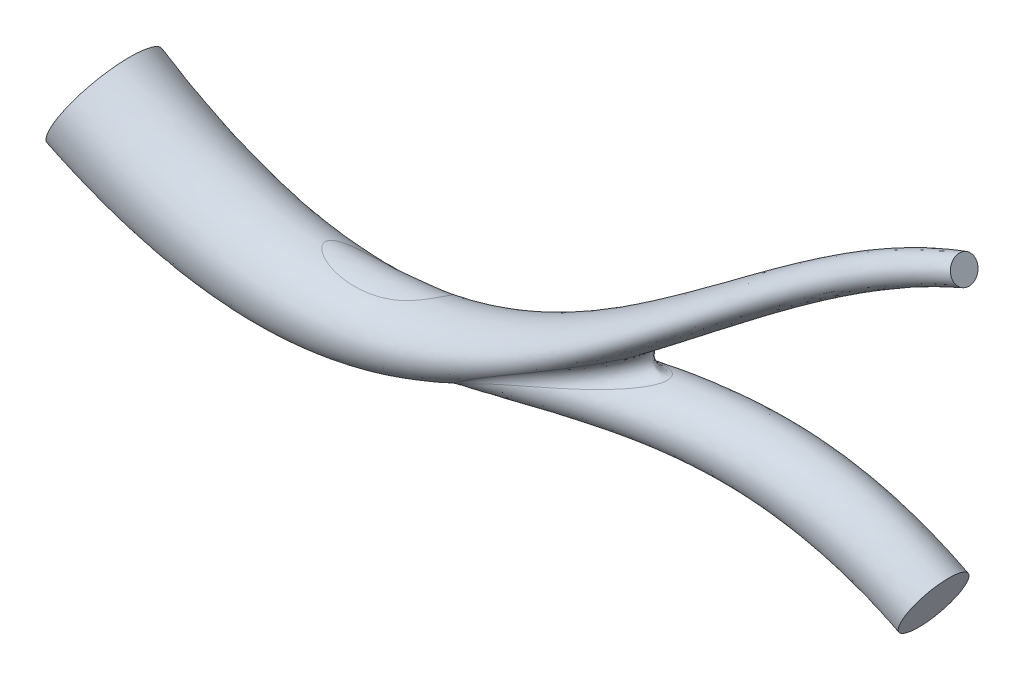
ISO-10303-21;
HEADER;
FILE_DESCRIPTION(('STEP AP214'),'2;1');
FILE_NAME('part.step','',(''),(''),'','','');
FILE_SCHEMA(('AUTOMOTIVE_DESIGN { 1 0 10303 214 1 1 1 1 }'));
ENDSEC;
DATA;
#1=APPLICATION_CONTEXT('core data for automotive mechanical design processes');
#2=APPLICATION_PROTOCOL_DEFINITION('international standard','automotive_design',2000,#1);
#3=PRODUCT_CONTEXT('',#1,'mechanical');
#4=PRODUCT('Part','Part','',(#3));
#5=PRODUCT_RELATED_PRODUCT_CATEGORY('part','',(#4));
#6=PRODUCT_DEFINITION_FORMATION('','',#4);
#7=PRODUCT_DEFINITION_CONTEXT('part definition',#1,'design');
#8=PRODUCT_DEFINITION('design','',#6,#7);
#9=PRODUCT_DEFINITION_SHAPE('','',#8);
#10=(LENGTH_UNIT() NAMED_UNIT(*) SI_UNIT(.MILLI.,.METRE.));
#11=(NAMED_UNIT(*) PLANE_ANGLE_UNIT() SI_UNIT($,.RADIAN.));
#12=(NAMED_UNIT(*) SI_UNIT($,.STERADIAN.) SOLID_ANGLE_UNIT());
#13=UNCERTAINTY_MEASURE_WITH_UNIT(LENGTH_MEASURE(1.E-05),#10,'distance_accuracy_value','');
#14=(GEOMETRIC_REPRESENTATION_CONTEXT(3) GLOBAL_UNCERTAINTY_ASSIGNED_CONTEXT((#13)) GLOBAL_UNIT_ASSIGNED_CONTEXT((#10,
#11,#12)) REPRESENTATION_CONTEXT('',''));
#15=CARTESIAN_POINT('',(0.,0.,0.));
#16=DIRECTION('',(0.,0.,1.));
#17=DIRECTION('',(1.,0.,0.));
#18=AXIS2_PLACEMENT_3D('',#15,#16,#17);
#19=CARTESIAN_POINT('',(131.406511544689,42.6566144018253,0.));
#20=DIRECTION('',(0.926857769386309,0.375412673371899,0.));
#21=DIRECTION('',(-0.375412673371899,0.926857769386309,0.));
#22=AXIS2_PLACEMENT_3D('',#19,#20,#21);
#23=PLANE('',#22);
#24=CARTESIAN_POINT('',(131.406511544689,42.6566144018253,0.));
#25=DIRECTION('',(0.926857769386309,0.375412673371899,0.));
#26=DIRECTION('',(-0.375412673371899,0.926857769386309,0.));
#27=AXIS2_PLACEMENT_3D('',#24,#25,#26);
#28=CIRCLE('',#27,1.97469360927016);
#29=CARTESIAN_POINT('',(130.665186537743,44.4868745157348,0.));
#30=VERTEX_POINT('',#29);
#31=EDGE_CURVE('E192',#30,#30,#28,.T.);
#32=ORIENTED_EDGE('',*,*,#31,.T.);
#33=EDGE_LOOP('',(#32));
#34=FACE_BOUND('',#33,.T.);
#35=ADVANCED_FACE('F84',(#34),#23,.T.);
#36=CARTESIAN_POINT('',(0.,0.,0.));
#37=DIRECTION('',(0.875054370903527,-0.484024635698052,0.));
#38=DIRECTION('',(0.484024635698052,0.875054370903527,0.));
#39=AXIS2_PLACEMENT_3D('',#36,#37,#38);
#40=PLANE('',#39);
#41=CARTESIAN_POINT('',(0.,0.,0.));
#42=DIRECTION('',(0.875054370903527,-0.484024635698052,0.));
#43=DIRECTION('',(0.484024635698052,0.875054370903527,0.));
#44=AXIS2_PLACEMENT_3D('',#41,#42,#43);
#45=CIRCLE('',#44,8.03856754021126);
#46=CARTESIAN_POINT('',(3.89086472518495,7.03418366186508,0.));
#47=VERTEX_POINT('',#46);
#48=EDGE_CURVE('E197',#47,#47,#45,.T.);
#49=ORIENTED_EDGE('',*,*,#48,.F.);
#50=EDGE_LOOP('',(#49));
#51=FACE_BOUND('',#50,.T.);
#52=ADVANCED_FACE('F119',(#51),#40,.F.);
#53=CARTESIAN_POINT('',(3.89086472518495,7.03418366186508,0.));
#54=CARTESIAN_POINT('',(60.1966243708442,-26.6993142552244,0.));
#55=CARTESIAN_POINT('',(89.0767909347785,28.7512282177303,0.));
#56=CARTESIAN_POINT('',(130.665186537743,44.4868745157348,0.));
#57=CARTESIAN_POINT('',(3.89086472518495,7.03418366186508,0.22183030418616));
#58=CARTESIAN_POINT('',(60.1966243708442,-26.6993142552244,0.166051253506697));
#59=CARTESIAN_POINT('',(89.0767909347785,28.7512282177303,0.110272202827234));
#60=CARTESIAN_POINT('',(130.665186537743,44.4868745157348,0.054493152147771));
#61=CARTESIAN_POINT('',(3.88214753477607,7.01842410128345,0.661317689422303));
#62=CARTESIAN_POINT('',(60.1913665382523,-26.7111874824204,0.495029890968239));
#63=CARTESIAN_POINT('',(89.0749924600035,28.7432413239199,0.328742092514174));
#64=CARTESIAN_POINT('',(130.666847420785,44.4827739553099,0.162454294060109));
#65=CARTESIAN_POINT('',(3.84392476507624,6.94932224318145,1.30595361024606));
#66=CARTESIAN_POINT('',(60.168312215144,-26.7632487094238,0.977572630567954));
#67=CARTESIAN_POINT('',(89.0671065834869,28.708220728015,0.649191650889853));
#68=CARTESIAN_POINT('',(130.674129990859,44.4647939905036,0.320810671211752));
#69=CARTESIAN_POINT('',(3.78155959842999,6.83657403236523,1.9339188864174));
#70=CARTESIAN_POINT('',(60.130696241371,-26.8481930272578,1.44763654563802));
#71=CARTESIAN_POINT('',(89.054239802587,28.6510803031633,0.961354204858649));
#72=CARTESIAN_POINT('',(130.686012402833,44.4354574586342,0.475071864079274));
#73=CARTESIAN_POINT('',(3.26854173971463,5.90910363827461,5.58923374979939));
#74=CARTESIAN_POINT('',(59.821266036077,-27.5469477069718,4.1838254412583));
#75=CARTESIAN_POINT('',(88.9483972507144,28.181041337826,2.77841713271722));
#76=CARTESIAN_POINT('',(130.783757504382,44.1941342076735,1.37300882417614));
#77=CARTESIAN_POINT('',(1.71794131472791,3.10581723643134,8.03856754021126));
#78=CARTESIAN_POINT('',(58.8860108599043,-29.6589391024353,6.01727622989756));
#79=CARTESIAN_POINT('',(88.6284873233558,26.7603449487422,3.99598491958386));
#80=CARTESIAN_POINT('',(131.079192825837,43.4647328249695,1.97469360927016));
#81=CARTESIAN_POINT('',(-2.14742664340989,-3.88227154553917,8.03856754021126));
#82=CARTESIAN_POINT('',(56.5545879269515,-34.9237537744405,6.01727622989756));
#83=CARTESIAN_POINT('',(87.831009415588,23.2188043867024,3.99598491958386));
#84=CARTESIAN_POINT('',(131.815659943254,41.646466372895,1.97469360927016));
#85=CARTESIAN_POINT('',(-3.89086472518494,-7.03418366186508,4.43660608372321));
#86=CARTESIAN_POINT('',(55.5030214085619,-37.2983992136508,3.32102507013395));
#87=CARTESIAN_POINT('',(87.4713144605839,21.6214256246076,2.20544405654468));
#88=CARTESIAN_POINT('',(132.147836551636,40.8263542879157,1.08986304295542));
#89=CARTESIAN_POINT('',(-3.89086472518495,-7.03418366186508,-4.43660608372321));
#90=CARTESIAN_POINT('',(55.5030214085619,-37.2983992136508,-3.32102507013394));
#91=CARTESIAN_POINT('',(87.4713144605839,21.6214256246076,-2.20544405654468));
#92=CARTESIAN_POINT('',(132.147836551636,40.8263542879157,-1.08986304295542));
#93=CARTESIAN_POINT('',(-2.14742664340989,-3.88227154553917,-8.03856754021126));
#94=CARTESIAN_POINT('',(56.5545879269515,-34.9237537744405,-6.01727622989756));
#95=CARTESIAN_POINT('',(87.831009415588,23.2188043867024,-3.99598491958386));
#96=CARTESIAN_POINT('',(131.815659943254,41.646466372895,-1.97469360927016));
#97=CARTESIAN_POINT('',(1.71794131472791,3.10581723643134,-8.03856754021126));
#98=CARTESIAN_POINT('',(58.8860108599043,-29.6589391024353,-6.01727622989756));
#99=CARTESIAN_POINT('',(88.6284873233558,26.7603449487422,-3.99598491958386));
#100=CARTESIAN_POINT('',(131.079192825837,43.4647328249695,-1.97469360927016));
#101=CARTESIAN_POINT('',(3.26854173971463,5.90910363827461,-5.58923374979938));
#102=CARTESIAN_POINT('',(59.821266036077,-27.5469477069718,-4.1838254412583));
#103=CARTESIAN_POINT('',(88.9483972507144,28.181041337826,-2.77841713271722));
#104=CARTESIAN_POINT('',(130.783757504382,44.1941342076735,-1.37300882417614));
#105=CARTESIAN_POINT('',(3.78155959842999,6.83657403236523,-1.9339188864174));
#106=CARTESIAN_POINT('',(60.1306962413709,-26.8481930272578,-1.44763654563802));
#107=CARTESIAN_POINT('',(89.054239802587,28.6510803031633,-0.961354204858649));
#108=CARTESIAN_POINT('',(130.686012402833,44.4354574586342,-0.475071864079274));
#109=CARTESIAN_POINT('',(3.84392476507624,6.94932224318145,-1.30595361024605));
#110=CARTESIAN_POINT('',(60.168312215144,-26.7632487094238,-0.977572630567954));
#111=CARTESIAN_POINT('',(89.0671065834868,28.708220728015,-0.649191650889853));
#112=CARTESIAN_POINT('',(130.674129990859,44.4647939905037,-0.320810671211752));
#113=CARTESIAN_POINT('',(3.88214753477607,7.01842410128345,-0.661317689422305));
#114=CARTESIAN_POINT('',(60.1913665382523,-26.7111874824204,-0.49502989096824));
#115=CARTESIAN_POINT('',(89.0749924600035,28.7432413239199,-0.328742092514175));
#116=CARTESIAN_POINT('',(130.666847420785,44.4827739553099,-0.16245429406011));
#117=CARTESIAN_POINT('',(3.89086472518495,7.03418366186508,-0.22183030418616));
#118=CARTESIAN_POINT('',(60.1966243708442,-26.6993142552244,-0.166051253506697));
#119=CARTESIAN_POINT('',(89.0767909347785,28.7512282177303,-0.110272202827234));
#120=CARTESIAN_POINT('',(130.665186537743,44.4868745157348,-0.054493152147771));
#121=CARTESIAN_POINT('',(3.89086472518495,7.03418366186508,0.));
#122=CARTESIAN_POINT('',(60.1966243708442,-26.6993142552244,0.));
#123=CARTESIAN_POINT('',(89.0767909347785,28.7512282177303,0.));
#124=CARTESIAN_POINT('',(130.665186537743,44.4868745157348,0.));
#125=B_SPLINE_SURFACE_WITH_KNOTS('',3,3,((#53,#54,#55,#56),(#57,#58,#59,#60),(#61,#62,#63,#64),
(#65,#66,#67,#68),(#69,#70,#71,#72),(#73,#74,#75,#76),(#77,#78,#79,#80),(#81,#82,#83,#84),(#85,
#86,#87,#88),(#89,#90,#91,#92),(#93,#94,#95,#96),(#97,#98,#99,#100),(#101,#102,#103,#104),(#105,
#106,#107,#108),(#109,#110,#111,#112),(#113,#114,#115,#116),(#117,#118,#119,#120),(#121,#122,
#123,#124)),.UNSPECIFIED.,.T.,.F.,.F.,(4,1,1,1,1,2,2,2,1,1,1,1,4),(4,4),(0.,0.0125,
0.0249999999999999,0.0375000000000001,0.05,0.25,0.5,0.75,0.95,0.9625,0.975,0.9875,1.),(0.,1.),.UNSPECIFIED.);
#126=CARTESIAN_POINT('',(83.8970187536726,8.35916912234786,0.570437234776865));
#127=CARTESIAN_POINT('',(82.8567408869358,7.51020806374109,-0.14502354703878));
#128=CARTESIAN_POINT('',(83.4576291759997,6.11481803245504,-0.226368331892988));
#129=CARTESIAN_POINT('',(84.0585174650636,4.71942800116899,-0.307713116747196));
#130=CARTESIAN_POINT('',(85.4195083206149,4.82362548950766,0.364331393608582));
#131=CARTESIAN_POINT('',(83.9244205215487,8.37538399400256,0.523715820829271));
#132=CARTESIAN_POINT('',(82.8642738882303,7.51955563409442,-0.164936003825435));
#133=CARTESIAN_POINT('',(83.4668788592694,6.11961530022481,-0.24566667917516));
#134=CARTESIAN_POINT('',(84.0695052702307,4.71968609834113,-0.32644254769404));
#135=CARTESIAN_POINT('',(85.447750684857,4.83653852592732,0.319585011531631));
#136=CARTESIAN_POINT('',(83.9500335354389,8.39072204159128,0.476098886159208));
#137=CARTESIAN_POINT('',(82.8703631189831,7.52794904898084,-0.183325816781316));
#138=CARTESIAN_POINT('',(83.4746208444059,6.12367332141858,-0.263440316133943));
#139=CARTESIAN_POINT('',(84.0788918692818,4.71940464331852,-0.34358833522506));
#140=CARTESIAN_POINT('',(85.4741461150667,4.84877952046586,0.273989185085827));
#141=CARTESIAN_POINT('',(83.9972082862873,8.41940625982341,0.379152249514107));
#142=CARTESIAN_POINT('',(82.8800984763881,7.54289414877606,-0.216822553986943));
#143=CARTESIAN_POINT('',(83.4874520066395,6.13047144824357,-0.295626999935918));
#144=CARTESIAN_POINT('',(84.0948189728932,4.71805586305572,-0.374464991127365));
#145=CARTESIAN_POINT('',(85.5227588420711,4.8717299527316,0.181173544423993));
#146=CARTESIAN_POINT('',(84.0187705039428,8.43275266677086,0.3298227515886));
#147=CARTESIAN_POINT('',(82.8837384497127,7.54944014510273,-0.231918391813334));
#148=CARTESIAN_POINT('',(83.4925414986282,6.13321171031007,-0.310040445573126));
#149=CARTESIAN_POINT('',(84.1013516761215,4.71698717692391,-0.388184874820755));
#150=CARTESIAN_POINT('',(85.5449766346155,4.88243957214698,0.133953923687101));
#151=CARTESIAN_POINT('',(84.0573449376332,8.45719661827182,0.229678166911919));
#152=CARTESIAN_POINT('',(82.8891393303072,7.5607886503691,-0.258731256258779));
#153=CARTESIAN_POINT('',(83.5005791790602,6.13761340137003,-0.33541573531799));
#154=CARTESIAN_POINT('',(84.1120261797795,4.71444207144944,-0.412122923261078));
#155=CARTESIAN_POINT('',(85.5847242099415,4.90212374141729,0.0380947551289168));
#156=CARTESIAN_POINT('',(84.0743616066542,8.46829636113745,0.178864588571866));
#157=CARTESIAN_POINT('',(82.8908978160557,7.56558782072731,-0.270440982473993));
#158=CARTESIAN_POINT('',(83.5035294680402,6.13927588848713,-0.346380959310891));
#159=CARTESIAN_POINT('',(84.1161642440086,4.71296576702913,-0.422334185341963));
#160=CARTESIAN_POINT('',(85.6022585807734,4.91109998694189,-0.0105433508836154));
#161=CARTESIAN_POINT('',(84.1034327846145,8.48803417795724,0.0759289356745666));
#162=CARTESIAN_POINT('',(82.8932343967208,7.57363150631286,-0.290944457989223));
#163=CARTESIAN_POINT('',(83.5079388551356,6.14184218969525,-0.365310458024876));
#164=CARTESIAN_POINT('',(84.1226463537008,4.71005464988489,-0.43968967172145));
#165=CARTESIAN_POINT('',(85.6322188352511,4.92714718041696,-0.109035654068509));
#166=CARTESIAN_POINT('',(84.1154872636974,8.49667223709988,0.0238068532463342));
#167=CARTESIAN_POINT('',(82.8938103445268,7.57687215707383,-0.299729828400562));
#168=CARTESIAN_POINT('',(83.5093979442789,6.14274599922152,-0.37327471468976));
#169=CARTESIAN_POINT('',(84.124986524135,4.70862050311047,-0.446825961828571));
#170=CARTESIAN_POINT('',(85.6446446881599,4.93421811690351,-0.158889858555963));
#171=CARTESIAN_POINT('',(84.1343537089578,8.51135479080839,-0.0816533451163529));
#172=CARTESIAN_POINT('',(82.8943739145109,7.58200835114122,-0.314851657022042));
#173=CARTESIAN_POINT('',(83.5113842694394,6.14409410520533,-0.386738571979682));
#174=CARTESIAN_POINT('',(84.128395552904,4.70618049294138,-0.458632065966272));
#175=CARTESIAN_POINT('',(85.6641022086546,4.9463494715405,-0.259888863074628));
#176=CARTESIAN_POINT('',(84.1411218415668,8.51737742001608,-0.134997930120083));
#177=CARTESIAN_POINT('',(82.894355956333,7.58389005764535,-0.321161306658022));
#178=CARTESIAN_POINT('',(83.5119037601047,6.14453456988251,-0.392217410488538));
#179=CARTESIAN_POINT('',(84.1294517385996,4.70517926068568,-0.463275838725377));
#180=CARTESIAN_POINT('',(85.6710887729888,4.95139291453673,-0.311040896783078));
#181=CARTESIAN_POINT('',(84.1489969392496,8.5265819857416,-0.241982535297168));
#182=CARTESIAN_POINT('',(82.8942190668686,7.58643288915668,-0.332331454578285));
#183=CARTESIAN_POINT('',(83.5124532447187,6.1451971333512,-0.401753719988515));
#184=CARTESIAN_POINT('',(84.1306875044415,4.70396150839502,-0.47117811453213));
#185=CARTESIAN_POINT('',(85.6792342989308,4.95927257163,-0.41381687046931));
#186=CARTESIAN_POINT('',(84.1501040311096,8.5297639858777,-0.29562254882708));
#187=CARTESIAN_POINT('',(82.8941001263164,7.58709280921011,-0.337188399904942));
#188=CARTESIAN_POINT('',(83.51248324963,6.1454192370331,-0.405811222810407));
#189=CARTESIAN_POINT('',(84.1308663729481,4.70374565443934,-0.474433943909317));
#190=CARTESIAN_POINT('',(85.6803933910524,4.96210883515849,-0.465440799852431));
#191=CARTESIAN_POINT('',(84.1465871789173,8.53323349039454,-0.402717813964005));
#192=CARTESIAN_POINT('',(82.8939195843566,7.58728078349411,-0.346982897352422));
#193=CARTESIAN_POINT('',(83.5121998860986,6.14576385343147,-0.414042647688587));
#194=CARTESIAN_POINT('',(84.130480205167,4.70424691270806,-0.481101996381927));
#195=CARTESIAN_POINT('',(85.6768092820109,4.96552959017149,-0.568687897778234));
#196=CARTESIAN_POINT('',(84.1419630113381,8.53352088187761,-0.456173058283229));
#197=CARTESIAN_POINT('',(82.893858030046,7.58680881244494,-0.351917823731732));
#198=CARTESIAN_POINT('',(83.5118865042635,6.14588636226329,-0.418216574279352));
#199=CARTESIAN_POINT('',(84.1299152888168,4.70496386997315,-0.484512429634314));
#200=CARTESIAN_POINT('',(85.6720658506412,4.96611399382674,-0.620311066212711));
#201=CARTESIAN_POINT('',(84.1271088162,8.53124518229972,-0.562406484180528));
#202=CARTESIAN_POINT('',(82.8935061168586,7.58469698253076,-0.363383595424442));
#203=CARTESIAN_POINT('',(83.5106446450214,6.14595707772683,-0.428223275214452));
#204=CARTESIAN_POINT('',(84.1277835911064,4.70721717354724,-0.493059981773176));
#205=CARTESIAN_POINT('',(85.6568016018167,4.96506152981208,-0.723120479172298));
#206=CARTESIAN_POINT('',(84.1168788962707,8.52868214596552,-0.615184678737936));
#207=CARTESIAN_POINT('',(82.8932159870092,7.58305837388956,-0.36991052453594));
#208=CARTESIAN_POINT('',(83.5097161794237,6.14590528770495,-0.434056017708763));
#209=CARTESIAN_POINT('',(84.1262179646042,4.70875244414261,-0.498193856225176));
#210=CARTESIAN_POINT('',(85.6462808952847,4.9634247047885,-0.774306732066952));
#211=CARTESIAN_POINT('',(84.0924692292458,8.52124670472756,-0.71409718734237));
#212=CARTESIAN_POINT('',(82.8919514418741,7.5787490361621,-0.3846082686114));
#213=CARTESIAN_POINT('',(83.5069070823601,6.14546779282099,-0.447437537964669));
#214=CARTESIAN_POINT('',(84.1218640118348,4.71218675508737,-0.510260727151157));
#215=CARTESIAN_POINT('',(85.6211634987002,4.95831253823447,-0.87027494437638));
#216=CARTESIAN_POINT('',(84.078822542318,8.51664762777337,-0.760343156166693));
#217=CARTESIAN_POINT('',(82.8910536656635,7.57620806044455,-0.392526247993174));
#218=CARTESIAN_POINT('',(83.5051377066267,6.1451180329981,-0.454739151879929));
#219=CARTESIAN_POINT('',(84.1192249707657,4.71402877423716,-0.516940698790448));
#220=CARTESIAN_POINT('',(85.6071164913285,4.9550502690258,-0.915161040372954));
#221=CARTESIAN_POINT('',(84.0475559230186,8.50539414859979,-0.851716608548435));
#222=CARTESIAN_POINT('',(82.8881414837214,7.56999677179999,-0.410882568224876));
#223=CARTESIAN_POINT('',(83.5002320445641,6.14393895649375,-0.471871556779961));
#224=CARTESIAN_POINT('',(84.1123258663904,4.71788193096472,-0.532849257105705));
#225=CARTESIAN_POINT('',(85.5749210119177,4.94692608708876,-1.00389033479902));
#226=CARTESIAN_POINT('',(84.0299346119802,8.49873903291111,-0.896843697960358));
#227=CARTESIAN_POINT('',(82.8861286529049,7.56632859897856,-0.421315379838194));
#228=CARTESIAN_POINT('',(83.4970952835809,6.14310947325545,-0.481703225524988));
#229=CARTESIAN_POINT('',(84.1080685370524,4.71989225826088,-0.542072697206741));
#230=CARTESIAN_POINT('',(85.5567711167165,4.94206361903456,-1.04773316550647));
#231=CARTESIAN_POINT('',(83.9910585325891,8.48353059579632,-0.985772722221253));
#232=CARTESIAN_POINT('',(82.8804699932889,7.55775304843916,-0.444929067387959));
#233=CARTESIAN_POINT('',(83.4889785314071,6.14076292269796,-0.504130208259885));
#234=CARTESIAN_POINT('',(84.0974936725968,4.72377470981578,-0.563313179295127));
#235=CARTESIAN_POINT('',(85.5167160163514,4.93086275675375,-1.13417967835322));
#236=CARTESIAN_POINT('',(83.9698039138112,8.47497735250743,-1.02957471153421));
#237=CARTESIAN_POINT('',(82.8768276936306,7.55284895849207,-0.458101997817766));
#238=CARTESIAN_POINT('',(83.4839986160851,6.13924588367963,-0.516725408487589));
#239=CARTESIAN_POINT('',(84.0911810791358,4.72564651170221,-0.575322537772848));
#240=CARTESIAN_POINT('',(85.4948109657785,4.92452442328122,-1.17678341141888));
#241=CARTESIAN_POINT('',(83.9240155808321,8.45614143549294,-1.11574094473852));
#242=CARTESIAN_POINT('',(82.8674819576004,7.54172083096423,-0.487158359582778));
#243=CARTESIAN_POINT('',(83.4718080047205,6.13534425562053,-0.544647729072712));
#244=CARTESIAN_POINT('',(84.076145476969,4.72897132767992,-0.60211077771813));
#245=CARTESIAN_POINT('',(85.4476069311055,4.91050477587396,-1.2606462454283));
#246=CARTESIAN_POINT('',(83.8994809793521,8.44585829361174,-1.15810479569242));
#247=CARTESIAN_POINT('',(82.8617829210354,7.53550020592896,-0.503034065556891));
#248=CARTESIAN_POINT('',(83.4645967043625,6.1329594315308,-0.559975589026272));
#249=CARTESIAN_POINT('',(84.067428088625,4.73042463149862,-0.616882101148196));
#250=CARTESIAN_POINT('',(85.4223070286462,4.90282309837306,-1.30190497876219));
#251=CARTESIAN_POINT('',(83.8310533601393,8.41674054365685,-1.26762718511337));
#252=CARTESIAN_POINT('',(82.8436548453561,7.51733959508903,-0.548078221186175));
#253=CARTESIAN_POINT('',(83.4423034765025,6.12535294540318,-0.603640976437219));
#254=CARTESIAN_POINT('',(84.0409992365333,4.73338242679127,-0.659112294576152));
#255=CARTESIAN_POINT('',(85.3517234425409,4.8810132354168,-1.40864713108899));
#256=CARTESIAN_POINT('',(83.7847259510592,8.39660890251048,-1.33353379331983));
#257=CARTESIAN_POINT('',(82.829251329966,7.50426470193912,-0.579325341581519));
#258=CARTESIAN_POINT('',(83.4251277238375,6.11929096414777,-0.634078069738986));
#259=CARTESIAN_POINT('',(84.0210831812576,4.73434604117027,-0.688705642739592));
#260=CARTESIAN_POINT('',(85.3039158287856,4.86587922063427,-1.47295981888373));
#261=CARTESIAN_POINT('',(83.6857180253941,8.35289918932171,-1.46127245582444));
#262=CARTESIAN_POINT('',(82.7934519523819,7.47451515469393,-0.64697840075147));
#263=CARTESIAN_POINT('',(83.383586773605,6.10417179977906,-0.700181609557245));
#264=CARTESIAN_POINT('',(83.9737996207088,4.73385680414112,-0.753260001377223));
#265=CARTESIAN_POINT('',(85.2016915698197,4.83294538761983,-1.59777720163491));
#266=CARTESIAN_POINT('',(83.6330337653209,8.32931908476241,-1.52310207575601));
#267=CARTESIAN_POINT('',(82.7720836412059,7.45785636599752,-0.683357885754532));
#268=CARTESIAN_POINT('',(83.3592173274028,6.0951128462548,-0.735851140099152));
#269=CARTESIAN_POINT('',(83.9464628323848,4.73241170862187,-0.788194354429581));
#270=CARTESIAN_POINT('',(85.1472710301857,4.8151439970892,-1.65827962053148));
#271=CARTESIAN_POINT('',(83.5224136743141,8.27926621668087,-1.64295511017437));
#272=CARTESIAN_POINT('',(82.722402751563,7.42116537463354,-0.759727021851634));
#273=CARTESIAN_POINT('',(83.3034333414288,6.07397912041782,-0.810881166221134));
#274=CARTESIAN_POINT('',(83.8845751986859,4.72683500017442,-0.861885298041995));
#275=CARTESIAN_POINT('',(85.0329450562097,4.77731190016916,-1.77573721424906));
#276=CARTESIAN_POINT('',(83.4644659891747,8.25278689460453,-1.70096939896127));
#277=CARTESIAN_POINT('',(82.6941057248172,7.40114169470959,-0.799704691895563));
#278=CARTESIAN_POINT('',(83.272002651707,6.06189742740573,-0.850250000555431));
#279=CARTESIAN_POINT('',(83.85004130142,4.72270835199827,-0.900629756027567));
#280=CARTESIAN_POINT('',(84.9730272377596,4.75727613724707,-1.83268386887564));
#281=CARTESIAN_POINT('',(83.3443923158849,8.19746985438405,-1.8132984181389));
#282=CARTESIAN_POINT('',(82.6310833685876,7.35810554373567,-0.881834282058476));
#283=CARTESIAN_POINT('',(83.2026829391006,6.03490379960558,-0.931251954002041));
#284=CARTESIAN_POINT('',(83.7744250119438,4.7117575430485,-0.980503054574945));
#285=CARTESIAN_POINT('',(84.8488043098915,4.71539411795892,-1.94312861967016));
#286=CARTESIAN_POINT('',(83.2822646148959,8.16863116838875,-1.8676116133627));
#287=CARTESIAN_POINT('',(82.5963838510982,7.33510555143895,-0.9239753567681));
#288=CARTESIAN_POINT('',(83.1647912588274,6.01999069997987,-0.972885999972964));
#289=CARTESIAN_POINT('',(83.7333693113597,4.70494367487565,-1.02162035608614));
#290=CARTESIAN_POINT('',(84.7844974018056,4.69354711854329,-1.9966252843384));
#291=CARTESIAN_POINT('',(83.0970287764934,8.0820917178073,-2.02030956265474));
#292=CARTESIAN_POINT('',(82.4874862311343,7.26469336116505,-1.04761788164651));
#293=CARTESIAN_POINT('',(83.0464525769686,5.97296673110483,-1.09541246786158));
#294=CARTESIAN_POINT('',(83.6060194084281,4.68147868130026,-1.14258456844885));
#295=CARTESIAN_POINT('',(84.5926579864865,4.62797182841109,-2.14729660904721));
#296=CARTESIAN_POINT('',(82.9694962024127,8.02183539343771,-2.1142230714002));
#297=CARTESIAN_POINT('',(82.4056475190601,7.21379327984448,-1.13072504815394));
#298=CARTESIAN_POINT('',(82.9584659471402,5.93748301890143,-1.17781946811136));
#299=CARTESIAN_POINT('',(83.5120178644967,4.6614723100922,-1.22428827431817));
#300=CARTESIAN_POINT('',(84.4604499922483,4.58229259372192,-2.24031004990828));
#301=CARTESIAN_POINT('',(82.7060667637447,7.89625319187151,-2.29162088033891));
#302=CARTESIAN_POINT('',(82.2256964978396,7.10491614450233,-1.29615402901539));
#303=CARTESIAN_POINT('',(82.7664684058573,5.85910802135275,-1.34215608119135));
#304=CARTESIAN_POINT('',(83.3079766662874,4.61360034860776,-1.38752567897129));
#305=CARTESIAN_POINT('',(84.1870603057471,4.48711902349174,-2.41665436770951));
#306=CARTESIAN_POINT('',(82.5701618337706,7.83092240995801,-2.37509488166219));
#307=CARTESIAN_POINT('',(82.1276720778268,7.04697389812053,-1.37849949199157));
#308=CARTESIAN_POINT('',(82.6624418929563,5.81620951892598,-1.42408514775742));
#309=CARTESIAN_POINT('',(83.1980206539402,4.58578155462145,-1.469078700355));
#310=CARTESIAN_POINT('',(84.0458699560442,4.43762099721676,-2.49997567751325));
#311=CARTESIAN_POINT('',(82.2921458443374,7.69633423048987,-2.5333901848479));
#312=CARTESIAN_POINT('',(81.9190240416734,6.92570880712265,-1.5403856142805));
#313=CARTESIAN_POINT('',(82.4420214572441,5.72454697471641,-1.58543102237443));
#314=CARTESIAN_POINT('',(82.9658264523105,4.52372096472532,-1.62988525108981));
#315=CARTESIAN_POINT('',(83.7567159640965,4.33572541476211,-2.65860580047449));
#316=CARTESIAN_POINT('',(82.1500209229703,7.62706794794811,-2.60819064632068));
#317=CARTESIAN_POINT('',(81.8084298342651,6.86239342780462,-1.61996581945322));
#318=CARTESIAN_POINT('',(82.3255989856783,5.67576935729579,-1.66484145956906));
#319=CARTESIAN_POINT('',(82.8436123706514,4.48950117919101,-1.7091756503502));
#320=CARTESIAN_POINT('',(83.608737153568,4.28332130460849,-2.73389528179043));
#321=CARTESIAN_POINT('',(81.8615493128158,7.48564757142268,-2.75021506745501));
#322=CARTESIAN_POINT('',(81.5777793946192,6.73183690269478,-1.77514570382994));
#323=CARTESIAN_POINT('',(82.0835146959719,5.57370654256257,-1.81993505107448));
#324=CARTESIAN_POINT('',(82.5900913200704,4.41593092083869,-1.86418597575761));
#325=CARTESIAN_POINT('',(83.3080413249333,4.17643916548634,-2.87744009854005));
#326=CARTESIAN_POINT('',(81.7152044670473,7.41349473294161,-2.81744227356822));
#327=CARTESIAN_POINT('',(81.457757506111,6.66460470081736,-1.85079821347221));
#328=CARTESIAN_POINT('',(81.9578568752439,5.52042329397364,-1.89561979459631));
#329=CARTESIAN_POINT('',(82.4588125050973,4.3766069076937,-1.93995569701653));
#330=CARTESIAN_POINT('',(83.1553263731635,4.12196203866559,-2.94569844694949));
#331=CARTESIAN_POINT('',(81.3287247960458,7.22197385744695,-2.98466924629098));
#332=CARTESIAN_POINT('',(81.1352421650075,6.48539684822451,-2.04250699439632));
#333=CARTESIAN_POINT('',(81.6202211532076,5.37655854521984,-2.08807658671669));
#334=CARTESIAN_POINT('',(82.1073960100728,4.26865561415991,-2.13239066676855));
#335=CARTESIAN_POINT('',(82.7515630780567,3.97753989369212,-3.11620652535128));
#336=CARTESIAN_POINT('',(81.0860309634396,7.10074795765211,-3.0795301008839));
#337=CARTESIAN_POINT('',(80.926237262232,6.37064502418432,-2.1557297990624));
#338=CARTESIAN_POINT('',(81.402501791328,5.28311655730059,-2.20162996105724));
#339=CARTESIAN_POINT('',(81.8809436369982,4.19652757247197,-2.24647518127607));
#340=CARTESIAN_POINT('',(82.4975621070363,3.88630280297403,-3.21367703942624));
#341=CARTESIAN_POINT('',(80.5951958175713,6.8538994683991,-3.2560298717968));
#342=CARTESIAN_POINT('',(80.4950338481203,6.13592238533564,-2.37138502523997));
#343=CARTESIAN_POINT('',(80.9542385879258,5.08967749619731,-2.41841328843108));
#344=CARTESIAN_POINT('',(81.4156129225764,4.04436894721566,-2.46439427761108));
#345=CARTESIAN_POINT('',(81.9829264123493,3.70096075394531,-3.39621633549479));
#346=CARTESIAN_POINT('',(80.3470515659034,6.72827448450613,-3.33766144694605));
#347=CARTESIAN_POINT('',(80.2727959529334,6.01591234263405,-2.47399473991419));
#348=CARTESIAN_POINT('',(80.7236877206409,4.98967682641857,-2.52163749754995));
#349=CARTESIAN_POINT('',(81.1766756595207,3.96435389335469,-2.56840208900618));
#350=CARTESIAN_POINT('',(81.7222880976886,3.60685423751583,-3.48127822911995));
#351=CARTESIAN_POINT('',(79.8465881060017,6.47346659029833,-3.49032171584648));
#352=CARTESIAN_POINT('',(79.8184243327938,5.77209701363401,-2.66956185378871));
#353=CARTESIAN_POINT('',(80.2529332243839,4.78472535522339,-2.7187524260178));
#354=CARTESIAN_POINT('',(80.6895282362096,3.79826194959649,-2.76706994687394));
#355=CARTESIAN_POINT('',(81.1957188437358,3.41645836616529,-3.64131529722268));
#356=CARTESIAN_POINT('',(79.594261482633,6.34427701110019,-3.56132867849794));
#357=CARTESIAN_POINT('',(79.5862023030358,5.64823400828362,-2.76265216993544));
#358=CARTESIAN_POINT('',(80.0127110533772,4.67976497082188,-2.81262388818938));
#359=CARTESIAN_POINT('',(80.4412142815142,3.71216945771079,-2.86186189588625));
#360=CARTESIAN_POINT('',(80.9297782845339,3.32016498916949,-3.716269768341));
#361=CARTESIAN_POINT('',(79.0870442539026,6.08336523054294,-3.69446295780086));
#362=CARTESIAN_POINT('',(79.114744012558,5.39807590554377,-2.93999629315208));
#363=CARTESIAN_POINT('',(79.5254561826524,4.46635068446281,-2.99172150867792));
#364=CARTESIAN_POINT('',(79.9381474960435,3.53549235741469,-3.04271986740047));
#365=CARTESIAN_POINT('',(80.394339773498,3.12618520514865,-3.85753053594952));
#366=CARTESIAN_POINT('',(78.832154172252,5.95164354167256,-3.75659205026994));
#367=CARTESIAN_POINT('',(78.875427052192,5.27172730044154,-3.02437555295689));
#368=CARTESIAN_POINT('',(79.2784248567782,4.35789748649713,-3.07694939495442));
#369=CARTESIAN_POINT('',(79.6832998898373,3.44489295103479,-3.12891146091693));
#370=CARTESIAN_POINT('',(80.1248425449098,3.02849908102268,-3.92383856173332));
#371=CARTESIAN_POINT('',(78.3194503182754,5.68570295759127,-3.87372780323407));
#372=CARTESIAN_POINT('',(78.3904259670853,5.01687208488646,-3.18563281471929));
#373=CARTESIAN_POINT('',(78.7781213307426,4.1379528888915,-3.24000224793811));
#374=CARTESIAN_POINT('',(79.1676944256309,3.2598591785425,-3.29375968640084));
#375=CARTESIAN_POINT('',(79.5819804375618,2.83175563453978,-4.0493363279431));
#376=CARTESIAN_POINT('',(78.0616290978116,5.55147644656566,-3.92870635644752));
#377=CARTESIAN_POINT('',(78.1446225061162,4.8882983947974,-3.26258589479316));
#378=CARTESIAN_POINT('',(78.5248288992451,4.02645146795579,-3.31779769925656));
#379=CARTESIAN_POINT('',(78.9068065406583,3.16538445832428,-3.37249257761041));
#380=CARTESIAN_POINT('',(79.3086047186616,2.7326945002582,-4.10849791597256));
#381=CARTESIAN_POINT('',(77.5444500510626,5.28147935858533,-4.03247976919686));
#382=CARTESIAN_POINT('',(77.6486378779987,4.6300440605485,-3.40952357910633));
#383=CARTESIAN_POINT('',(78.0140080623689,3.80148303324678,-3.4664333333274));
#384=CARTESIAN_POINT('',(78.3811378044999,2.97369707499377,-3.52283263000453));
#385=CARTESIAN_POINT('',(78.7595444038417,2.53387958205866,-4.22041773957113));
#386=CARTESIAN_POINT('',(77.2850921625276,5.14570871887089,-4.08127437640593));
#387=CARTESIAN_POINT('',(77.3983608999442,4.50030552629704,-3.47959298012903));
#388=CARTESIAN_POINT('',(77.7564794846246,3.68801593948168,-3.53727323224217));
#389=CARTESIAN_POINT('',(78.1162503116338,2.87645452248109,-3.59452652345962));
#390=CARTESIAN_POINT('',(78.4838597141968,2.43412577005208,-4.27317571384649));
#391=CARTESIAN_POINT('',(76.5057767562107,4.7370137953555,-4.21980590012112));
#392=CARTESIAN_POINT('',(76.6451992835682,4.11167414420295,-3.67973317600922));
#393=CARTESIAN_POINT('',(76.9793976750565,3.34575803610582,-3.74029883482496));
#394=CARTESIAN_POINT('',(77.3201272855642,2.58271763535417,-3.79914877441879));
#395=CARTESIAN_POINT('',(77.6546379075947,2.13444341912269,-4.42298944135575));
#396=CARTESIAN_POINT('',(75.9839365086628,4.46237278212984,-4.30183124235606));
#397=CARTESIAN_POINT('',(76.1340254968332,3.8502411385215,-3.80161724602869));
#398=CARTESIAN_POINT('',(76.4547200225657,3.1148334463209,-3.86319000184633));
#399=CARTESIAN_POINT('',(76.7811048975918,2.38192090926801,-3.92354574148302));
#400=CARTESIAN_POINT('',(77.0982538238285,1.93384728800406,-4.51173707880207));
#401=CARTESIAN_POINT('',(74.8747068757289,3.87872780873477,-4.46004685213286));
#402=CARTESIAN_POINT('',(75.0419555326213,3.29728326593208,-4.03850907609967));
#403=CARTESIAN_POINT('',(75.3334978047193,2.62304054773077,-4.10213271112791));
#404=CARTESIAN_POINT('',(75.6320778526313,1.9518855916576,-4.16426133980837));
#405=CARTESIAN_POINT('',(75.9142869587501,1.50866648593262,-4.68148863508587));
#406=CARTESIAN_POINT('',(74.2868318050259,3.56948414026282,-4.53441390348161));
#407=CARTESIAN_POINT('',(74.4581639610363,3.00486927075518,-4.15170932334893));
#408=CARTESIAN_POINT('',(74.735763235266,2.3618470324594,-4.21567663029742));
#409=CARTESIAN_POINT('',(75.01928988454,1.72139763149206,-4.27862249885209));
#410=CARTESIAN_POINT('',(75.2860320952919,1.28403737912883,-4.76035154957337));
#411=CARTESIAN_POINT('',(73.1063065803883,2.95143578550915,-4.67034520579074));
#412=CARTESIAN_POINT('',(73.2814656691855,2.42279125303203,-4.3583763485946));
#413=CARTESIAN_POINT('',(73.5312940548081,1.83892630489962,-4.42255210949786));
#414=CARTESIAN_POINT('',(73.7869958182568,1.25761181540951,-4.48572241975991));
#415=CARTESIAN_POINT('',(74.0243385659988,0.83553829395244,-4.90153953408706));
#416=CARTESIAN_POINT('',(72.5136556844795,2.6426311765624,-4.73190742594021));
#417=CARTESIAN_POINT('',(72.6875580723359,2.13256279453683,-4.45222268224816));
#418=CARTESIAN_POINT('',(72.9245580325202,1.57719901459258,-4.51588046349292));
#419=CARTESIAN_POINT('',(73.1664145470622,1.02391199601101,-4.578859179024));
#420=CARTESIAN_POINT('',(73.3908990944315,0.611668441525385,-4.96386198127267));
#421=CARTESIAN_POINT('',(71.3228426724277,2.02756545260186,-4.84586262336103));
#422=CARTESIAN_POINT('',(71.491829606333,1.55621780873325,-4.62405561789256));
#423=CARTESIAN_POINT('',(71.7033947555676,1.05492445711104,-4.68612746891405));
#424=CARTESIAN_POINT('',(71.9197892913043,0.555696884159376,-4.74752801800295));
#425=CARTESIAN_POINT('',(72.119397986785,0.165349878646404,-5.07563798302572));
#426=CARTESIAN_POINT('',(70.7246758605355,1.72130702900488,-4.89824684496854));
#427=CARTESIAN_POINT('',(70.889078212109,1.26959777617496,-4.70229386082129));
#428=CARTESIAN_POINT('',(71.0889607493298,0.794378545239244,-4.76303046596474));
#429=CARTESIAN_POINT('',(71.292755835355,0.320801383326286,-4.82332123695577));
#430=CARTESIAN_POINT('',(71.48133253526,-0.0570972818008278,-5.12507927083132));
#431=CARTESIAN_POINT('',(69.5230430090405,1.11349904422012,-4.99617668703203));
#432=CARTESIAN_POINT('',(69.6772686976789,0.701835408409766,-4.84573769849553));
#433=CARTESIAN_POINT('',(69.8541564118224,0.276069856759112,-4.90329150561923));
#434=CARTESIAN_POINT('',(70.0349324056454,-0.148063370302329,-4.96040504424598));
#435=CARTESIAN_POINT('',(70.2019884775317,-0.499814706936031,-5.21382244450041));
#436=CARTESIAN_POINT('',(68.919577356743,0.811949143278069,-5.04172280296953));
#437=CARTESIAN_POINT('',(69.067385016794,0.420252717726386,-4.9111285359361));
#438=CARTESIAN_POINT('',(69.2337865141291,0.0183068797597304,-4.96665052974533));
#439=CARTESIAN_POINT('',(69.4032678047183,-0.382373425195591,-5.02188566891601));
#440=CARTESIAN_POINT('',(69.5607101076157,-0.720085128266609,-5.25312506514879));
#441=CARTESIAN_POINT('',(67.7059951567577,0.214323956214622,-5.12770305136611));
#442=CARTESIAN_POINT('',(67.8409571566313,-0.137338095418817,-5.03135536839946));
#443=CARTESIAN_POINT('',(67.9868707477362,-0.494080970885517,-5.0823884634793));
#444=CARTESIAN_POINT('',(68.135858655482,-0.849560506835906,-5.13313718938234));
#445=CARTESIAN_POINT('',(68.2744976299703,-1.15865721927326,-5.32390294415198));
#446=CARTESIAN_POINT('',(67.0958691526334,-0.0817413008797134,-5.16812848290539));
#447=CARTESIAN_POINT('',(67.223666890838,-0.413713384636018,-5.08630093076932));
#448=CARTESIAN_POINT('',(67.360316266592,-0.748699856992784,-5.13474878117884));
#449=CARTESIAN_POINT('',(67.4993339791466,-1.08273464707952,-5.18301578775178));
#450=CARTESIAN_POINT('',(67.629559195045,-1.37695496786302,-5.35536496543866));
#451=CARTESIAN_POINT('',(65.8698734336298,-0.667309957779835,-5.24499456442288));
#452=CARTESIAN_POINT('',(65.9840556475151,-0.96042481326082,-5.18753007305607));
#453=CARTESIAN_POINT('',(66.1028208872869,-1.25419766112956,-5.23049556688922));
#454=CARTESIAN_POINT('',(66.22394901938,-1.54702029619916,-5.27328166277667));
#455=CARTESIAN_POINT('',(66.3378216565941,-1.81154371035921,-5.41226272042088));
#456=CARTESIAN_POINT('',(65.2540033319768,-0.956812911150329,-5.28143494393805));
#457=CARTESIAN_POINT('',(65.3611013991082,-1.23107065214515,-5.23389877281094));
#458=CARTESIAN_POINT('',(65.4718796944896,-1.50507632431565,-5.27388142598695));
#459=CARTESIAN_POINT('',(65.5844267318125,-1.77838352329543,-5.31375134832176));
#460=CARTESIAN_POINT('',(65.6910224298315,-2.02783456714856,-5.43769804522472));
#461=CARTESIAN_POINT('',(64.3265375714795,-1.38653885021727,-5.33383809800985));
#462=CARTESIAN_POINT('',(64.4232513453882,-1.63353712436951,-5.29834952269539));
#463=CARTESIAN_POINT('',(64.5233150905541,-1.87922221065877,-5.33366072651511));
#464=CARTESIAN_POINT('',(64.6238139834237,-2.12473606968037,-5.36894513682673));
#465=CARTESIAN_POINT('',(64.7206266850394,-2.35170470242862,-5.472553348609));
#466=CARTESIAN_POINT('',(64.0168933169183,-1.52897158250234,-5.35092337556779));
#467=CARTESIAN_POINT('',(64.110412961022,-1.7669643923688,-5.31896402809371));
#468=CARTESIAN_POINT('',(64.2068915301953,-2.00352757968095,-5.35269753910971));
#469=CARTESIAN_POINT('',(64.303742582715,-2.23994490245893,-5.38640971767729));
#470=CARTESIAN_POINT('',(64.3972543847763,-2.45952524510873,-5.48361850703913));
#471=CARTESIAN_POINT('',(63.3964633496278,-1.81266226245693,-5.38446251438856));
#472=CARTESIAN_POINT('',(63.4838679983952,-2.03296465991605,-5.35870825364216));
#473=CARTESIAN_POINT('',(63.573470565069,-2.25176776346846,-5.38924013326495));
#474=CARTESIAN_POINT('',(63.6634470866,-2.47042419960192,-5.41975028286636));
#475=CARTESIAN_POINT('',(63.7506056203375,-2.67536360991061,-5.50484255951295));
#476=CARTESIAN_POINT('',(63.085677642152,-1.95392021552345,-5.40091637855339));
#477=CARTESIAN_POINT('',(63.1701004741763,-2.16556497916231,-5.37784365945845));
#478=CARTESIAN_POINT('',(63.2564731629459,-2.37570257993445,-5.40674592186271));
#479=CARTESIAN_POINT('',(63.3431598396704,-2.58571738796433,-5.43563144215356));
#480=CARTESIAN_POINT('',(63.4273291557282,-2.78338143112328,-5.51500145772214));
#481=CARTESIAN_POINT('',(62.4632385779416,-2.23571345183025,-5.43330267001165));
#482=CARTESIAN_POINT('',(62.5420216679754,-2.43039576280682,-5.41483357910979));
#483=CARTESIAN_POINT('',(62.622246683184,-2.62367464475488,-5.44044394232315));
#484=CARTESIAN_POINT('',(62.7027846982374,-2.81683117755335,-5.46603773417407));
#485=CARTESIAN_POINT('',(62.781243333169,-3.00012195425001,-5.53459073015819));
#486=CARTESIAN_POINT('',(62.1515853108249,-2.37624880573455,-5.44923514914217));
#487=CARTESIAN_POINT('',(62.2276552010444,-2.56265014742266,-5.4326927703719));
#488=CARTESIAN_POINT('',(62.3050176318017,-2.74771188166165,-5.45663630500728));
#489=CARTESIAN_POINT('',(62.3826397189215,-2.93267172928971,-5.48056704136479));
#490=CARTESIAN_POINT('',(62.4584339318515,-3.10884458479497,-5.5440211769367));
#491=CARTESIAN_POINT('',(61.5277879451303,-2.657365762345,-5.48067921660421));
#492=CARTESIAN_POINT('',(61.598800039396,-2.82758190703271,-5.46732056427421));
#493=CARTESIAN_POINT('',(61.6707747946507,-2.99666777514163,-5.48790863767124));
#494=CARTESIAN_POINT('',(61.7430091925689,-3.16565169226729,-5.50848390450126));
#495=CARTESIAN_POINT('',(61.8137710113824,-3.3277991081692,-5.56231225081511));
#496=CARTESIAN_POINT('',(61.2156438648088,-2.79794736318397,-5.49619082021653));
#497=CARTESIAN_POINT('',(61.2842614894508,-2.96027996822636,-5.48409284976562));
#498=CARTESIAN_POINT('',(61.353761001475,-3.12158639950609,-5.50298864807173));
#499=CARTESIAN_POINT('',(61.4234722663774,-3.28280850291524,-5.52187465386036));
#500=CARTESIAN_POINT('',(61.4919174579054,-3.43803094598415,-5.57117289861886));
#501=CARTESIAN_POINT('',(60.7379846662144,-3.0141151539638,-5.51965309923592));
#502=CARTESIAN_POINT('',(60.8031811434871,-3.16471435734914,-5.50903913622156));
#503=CARTESIAN_POINT('',(60.8692532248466,-3.3144218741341,-5.52533082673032));
#504=CARTESIAN_POINT('',(60.9353846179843,-3.46410581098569,-5.54161979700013));
#505=CARTESIAN_POINT('',(61.0006180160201,-3.60888240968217,-5.58437775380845));
#506=CARTESIAN_POINT('',(60.5723974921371,-3.08924460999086,-5.52773611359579));
#507=CARTESIAN_POINT('',(60.6364830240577,-3.23582392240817,-5.51755322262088));
#508=CARTESIAN_POINT('',(60.7014029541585,-3.38157993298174,-5.5329409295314));
#509=CARTESIAN_POINT('',(60.7663757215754,-3.52731464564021,-5.5483262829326));
#510=CARTESIAN_POINT('',(60.8305264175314,-3.66850969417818,-5.58889020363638));
#511=CARTESIAN_POINT('',(60.2414370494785,-3.24012612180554,-5.54379346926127));
#512=CARTESIAN_POINT('',(60.3034208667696,-3.37878130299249,-5.5343188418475));
#513=CARTESIAN_POINT('',(60.3661551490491,-3.51675601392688,-5.54789567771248));
#514=CARTESIAN_POINT('',(60.4289423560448,-3.65470937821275,-5.56147014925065));
#515=CARTESIAN_POINT('',(60.4910367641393,-3.78881054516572,-5.59778431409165));
#516=CARTESIAN_POINT('',(60.0760637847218,-3.31587818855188,-5.55176780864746));
#517=CARTESIAN_POINT('',(60.1370504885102,-3.45063157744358,-5.54257076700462));
#518=CARTESIAN_POINT('',(60.1987576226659,-3.58477405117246,-5.55524031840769));
#519=CARTESIAN_POINT('',(60.2605113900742,-3.71889737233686,-5.56790785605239));
#520=CARTESIAN_POINT('',(60.3216387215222,-3.84948413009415,-5.60216597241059));
#521=CARTESIAN_POINT('',(59.7455940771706,-3.46839183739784,-5.56759542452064));
#522=CARTESIAN_POINT('',(59.8047162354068,-3.59545567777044,-5.55881036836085));
#523=CARTESIAN_POINT('',(59.8644952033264,-3.72205127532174,-5.56966270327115));
#524=CARTESIAN_POINT('',(59.9243208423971,-3.84862770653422,-5.58051302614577));
#525=CARTESIAN_POINT('',(59.9836313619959,-3.9722561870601,-5.61078849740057));
#526=CARTESIAN_POINT('',(59.5804980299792,-3.54515428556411,-5.5754485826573));
#527=CARTESIAN_POINT('',(59.6387468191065,-3.66843275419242,-5.56679815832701));
#528=CARTESIAN_POINT('',(59.6976309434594,-3.79131154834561,-5.57674019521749));
#529=CARTESIAN_POINT('',(59.7565558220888,-3.91417318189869,-5.58668053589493));
#530=CARTESIAN_POINT('',(59.8150229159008,-4.03435592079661,-5.61502923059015));
#531=CARTESIAN_POINT('',(59.2510352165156,-3.7000222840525,-5.59097962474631));
#532=CARTESIAN_POINT('',(59.307680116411,-3.8158500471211,-5.58246449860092));
#533=CARTESIAN_POINT('',(59.3649127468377,-3.93141655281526,-5.59058508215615));
#534=CARTESIAN_POINT('',(59.4221861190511,-4.0469659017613,-5.59870397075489));
#535=CARTESIAN_POINT('',(59.4790964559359,-4.16033596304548,-5.62332411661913));
#536=CARTESIAN_POINT('',(59.0866684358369,-3.77812780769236,-5.59865751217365));
#537=CARTESIAN_POINT('',(59.1425771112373,-3.89029231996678,-5.59014339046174));
#538=CARTESIAN_POINT('',(59.1990587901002,-4.00226125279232,-5.59735248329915));
#539=CARTESIAN_POINT('',(59.2555755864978,-4.11421489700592,-5.60456017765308));
#540=CARTESIAN_POINT('',(59.3117784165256,-4.22421623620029,-5.6273782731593));
#541=CARTESIAN_POINT('',(58.7599943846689,-3.93574066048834,-5.61370524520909));
#542=CARTESIAN_POINT('',(58.8145915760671,-4.04072201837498,-5.60506825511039));
#543=CARTESIAN_POINT('',(58.8697272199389,-4.14563836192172,-5.61045950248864));
#544=CARTESIAN_POINT('',(58.9248975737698,-4.25053959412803,-5.61584936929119));
#545=CARTESIAN_POINT('',(58.9798337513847,-4.35390710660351,-5.63519231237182));
#546=CARTESIAN_POINT('',(58.5976807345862,-4.01523768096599,-5.62107657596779));
#547=CARTESIAN_POINT('',(58.6516966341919,-4.11670027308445,-5.61231671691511));
#548=CARTESIAN_POINT('',(58.7062414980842,-4.21815908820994,-5.61680130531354));
#549=CARTESIAN_POINT('',(58.7608158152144,-4.31960451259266,-5.62128479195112));
#550=CARTESIAN_POINT('',(58.8151972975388,-4.41970488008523,-5.63895371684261));
#551=CARTESIAN_POINT('',(58.2747788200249,-4.17664585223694,-5.63539586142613));
#552=CARTESIAN_POINT('',(58.3278051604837,-4.2711973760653,-5.62627413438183));
#553=CARTESIAN_POINT('',(58.3813355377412,-4.36586650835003,-5.6289465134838));
#554=CARTESIAN_POINT('',(58.4348953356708,-4.46052226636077,-5.63161779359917));
#555=CARTESIAN_POINT('',(58.4883281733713,-4.55418099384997,-5.6460520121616));
#556=CARTESIAN_POINT('',(58.1141903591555,-4.25855672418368,-5.64234386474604));
#557=CARTESIAN_POINT('',(58.1668033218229,-4.34971773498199,-5.63298345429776));
#558=CARTESIAN_POINT('',(58.2199150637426,-4.4410528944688,-5.63474998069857));
#559=CARTESIAN_POINT('',(58.2730511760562,-4.53237634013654,-5.63651568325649));
#560=CARTESIAN_POINT('',(58.3260952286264,-4.62285900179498,-5.64938895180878));
#561=CARTESIAN_POINT('',(57.7957585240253,-4.4253877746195,-5.65553547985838));
#562=CARTESIAN_POINT('',(57.8477388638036,-4.50990755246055,-5.64558846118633));
#563=CARTESIAN_POINT('',(57.9002013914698,-4.59471356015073,-5.64554670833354));
#564=CARTESIAN_POINT('',(57.9526882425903,-4.67950787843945,-5.64550413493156));
#565=CARTESIAN_POINT('',(58.0051374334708,-4.76374917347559,-5.65536751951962));
#566=CARTESIAN_POINT('',(57.6379117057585,-4.51030369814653,-5.66178003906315));
#567=CARTESIAN_POINT('',(57.6896676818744,-4.59157430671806,-5.65148554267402));
#568=CARTESIAN_POINT('',(57.7419042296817,-4.67318321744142,-5.65054106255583));
#569=CARTESIAN_POINT('',(57.794160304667,-4.75478205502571,-5.64959603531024));
#570=CARTESIAN_POINT('',(57.84640810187,-4.83595639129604,-5.65801008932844));
#571=CARTESIAN_POINT('',(57.3259388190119,-4.68398519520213,-5.67313000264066));
#572=CARTESIAN_POINT('',(57.3774609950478,-4.75890149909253,-5.66203796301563));
#573=CARTESIAN_POINT('',(57.4294548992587,-4.83426051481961,-5.65929217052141));
#574=CARTESIAN_POINT('',(57.4814682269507,-4.90960952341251,-5.65654583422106));
#575=CARTESIAN_POINT('',(57.5335184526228,-4.98477189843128,-5.66216893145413));
#576=CARTESIAN_POINT('',(57.1718113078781,-4.77274923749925,-5.67823585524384));
#577=CARTESIAN_POINT('',(57.2233192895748,-4.84456209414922,-5.6666940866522));
#578=CARTESIAN_POINT('',(57.2753011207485,-4.91686651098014,-5.66304941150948));
#579=CARTESIAN_POINT('',(57.3272976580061,-4.98916265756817,-5.65940446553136));
#580=CARTESIAN_POINT('',(57.3793563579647,-5.06137844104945,-5.66368564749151));
#581=CARTESIAN_POINT('',(56.89077858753,-4.94163602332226,-5.68600663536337));
#582=CARTESIAN_POINT('',(56.9424809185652,-5.00786240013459,-5.67353806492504));
#583=CARTESIAN_POINT('',(56.9946604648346,-5.07467223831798,-5.66823134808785));
#584=CARTESIAN_POINT('',(57.0468508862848,-5.14147596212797,-5.66292442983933));
#585=CARTESIAN_POINT('',(57.0991430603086,-5.20838292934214,-5.66481767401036));
#586=CARTESIAN_POINT('',(56.7631709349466,-5.02114132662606,-5.68891837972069));
#587=CARTESIAN_POINT('',(56.815048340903,-5.08486032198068,-5.67598635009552));
#588=CARTESIAN_POINT('',(56.8674071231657,-5.1492050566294,-5.66991556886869));
#589=CARTESIAN_POINT('',(56.9197740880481,-5.21354477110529,-5.66384474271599));
#590=CARTESIAN_POINT('',(56.9722610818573,-5.27806657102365,-5.66467715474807));
#591=CARTESIAN_POINT('',(56.5129414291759,-5.18384021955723,-5.69278596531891));
#592=CARTESIAN_POINT('',(56.5653398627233,-5.24262870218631,-5.67886748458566));
#593=CARTESIAN_POINT('',(56.6182262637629,-5.30213204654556,-5.67127438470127));
#594=CARTESIAN_POINT('',(56.6711207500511,-5.36163042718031,-5.66368124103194));
#595=CARTESIAN_POINT('',(56.7241657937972,-5.42146443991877,-5.66246201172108));
#596=CARTESIAN_POINT('',(56.3903197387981,-5.26703392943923,-5.69374174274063));
#597=CARTESIAN_POINT('',(56.4430616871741,-5.32340036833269,-5.67930042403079));
#598=CARTESIAN_POINT('',(56.4962989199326,-5.38052634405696,-5.67094891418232));
#599=CARTESIAN_POINT('',(56.5495419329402,-5.4376483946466,-5.66259749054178));
#600=CARTESIAN_POINT('',(56.6029526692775,-5.49517879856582,-5.66038732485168));
#601=CARTESIAN_POINT('',(56.1517667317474,-5.43709149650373,-5.69287801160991));
#602=CARTESIAN_POINT('',(56.205364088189,-5.48869145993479,-5.67734654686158));
#603=CARTESIAN_POINT('',(56.2594711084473,-5.54114786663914,-5.66749495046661));
#604=CARTESIAN_POINT('',(56.3135839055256,-5.59360036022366,-5.65764343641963));
#605=CARTESIAN_POINT('',(56.3678945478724,-5.64660728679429,-5.65352862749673));
#606=CARTESIAN_POINT('',(56.0358210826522,-5.52394674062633,-5.6910646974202));
#607=CARTESIAN_POINT('',(56.0899277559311,-5.5732032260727,-5.67496614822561));
#608=CARTESIAN_POINT('',(56.1445555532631,-5.62336613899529,-5.66437271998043));
#609=CARTESIAN_POINT('',(56.199187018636,-5.67352626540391,-5.6537794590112));
#610=CARTESIAN_POINT('',(56.2540336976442,-5.72431211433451,-5.6487506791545));
#611=CARTESIAN_POINT('',(55.8118099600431,-5.70135162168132,-5.68368039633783));
#612=CARTESIAN_POINT('',(55.8670935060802,-5.74599504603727,-5.66641966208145));
#613=CARTESIAN_POINT('',(55.9229223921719,-5.79165686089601,-5.65437074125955));
#614=CARTESIAN_POINT('',(55.9787549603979,-5.83731588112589,-5.64232198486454));
#615=CARTESIAN_POINT('',(56.0348350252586,-5.88374988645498,-5.63554935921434));
#616=CARTESIAN_POINT('',(55.7037437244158,-5.79190089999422,-5.67810977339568));
#617=CARTESIAN_POINT('',(55.7596928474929,-5.83427592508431,-5.66025400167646));
#618=CARTESIAN_POINT('',(55.8162039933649,-5.87772893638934,-5.64749135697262));
#619=CARTESIAN_POINT('',(55.8727170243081,-5.921180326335,-5.63472888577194));
#620=CARTESIAN_POINT('',(55.9294963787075,-5.96548244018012,-5.62712634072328));
#621=CARTESIAN_POINT('',(55.4954954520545,-5.97733153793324,-5.66201518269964));
#622=CARTESIAN_POINT('',(55.5529176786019,-6.01521291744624,-5.64295884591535));
#623=CARTESIAN_POINT('',(55.6109385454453,-6.05430881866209,-5.62880600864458));
#624=CARTESIAN_POINT('',(55.6689613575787,-6.09340304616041,-5.61465334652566));
#625=CARTESIAN_POINT('',(55.7272878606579,-6.13351316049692,-5.60547614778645));
#626=CARTESIAN_POINT('',(55.3954269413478,-6.072252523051,-5.6514310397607));
#627=CARTESIAN_POINT('',(55.4536566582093,-6.10791078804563,-5.63176910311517));
#628=CARTESIAN_POINT('',(55.5125083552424,-6.14485820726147,-5.61694039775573));
#629=CARTESIAN_POINT('',(55.5713605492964,-6.18180514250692,-5.60211177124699));
#630=CARTESIAN_POINT('',(55.6305383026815,-6.21985516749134,-5.5921910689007));
#631=CARTESIAN_POINT('',(55.2055552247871,-6.26450473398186,-5.62416775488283));
#632=CARTESIAN_POINT('',(55.2654962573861,-6.29578604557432,-5.60332358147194));
#633=CARTESIAN_POINT('',(55.3261107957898,-6.32852649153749,-5.58721191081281));
#634=CARTESIAN_POINT('',(55.3867258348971,-6.36126643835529,-5.57110032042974));
#635=CARTESIAN_POINT('',(55.4477116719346,-6.39530204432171,-5.55980169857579));
#636=CARTESIAN_POINT('',(55.115752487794,-6.36183606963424,-5.60748833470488));
#637=CARTESIAN_POINT('',(55.176596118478,-6.39096470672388,-5.58606738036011));
#638=CARTESIAN_POINT('',(55.238143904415,-6.42164550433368,-5.56934876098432));
#639=CARTESIAN_POINT('',(55.2996912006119,-6.45232686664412,-5.55263001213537));
#640=CARTESIAN_POINT('',(55.3616350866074,-6.48440704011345,-5.54069714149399));
#641=CARTESIAN_POINT('',(54.9465772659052,-6.55796240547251,-5.56703505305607));
#642=CARTESIAN_POINT('',(55.009275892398,-6.58284857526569,-5.54452484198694));
#643=CARTESIAN_POINT('',(55.0727460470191,-6.60949562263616,-5.52668380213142));
#644=CARTESIAN_POINT('',(55.1362157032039,-6.63614322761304,-5.50884263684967));
#645=CARTESIAN_POINT('',(55.2001366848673,-6.66441724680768,-5.49576064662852));
#646=CARTESIAN_POINT('',(54.8672189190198,-6.65675919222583,-5.54325171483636));
#647=CARTESIAN_POINT('',(54.9308692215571,-6.67955664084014,-5.52022886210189));
#648=CARTESIAN_POINT('',(54.9953293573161,-6.70422872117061,-5.50187272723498));
#649=CARTESIAN_POINT('',(55.0597884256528,-6.72890221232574,-5.48351616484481));
#650=CARTESIAN_POINT('',(55.124729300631,-6.75532471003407,-5.46991972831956));
#651=CARTESIAN_POINT('',(54.7187900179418,-6.85456542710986,-5.48784734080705));
#652=CARTESIAN_POINT('',(54.7843451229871,-6.87324915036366,-5.46390043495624));
#653=CARTESIAN_POINT('',(54.8507930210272,-6.89405678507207,-5.44462931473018));
#654=CARTESIAN_POINT('',(54.9172398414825,-6.91486582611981,-5.42535777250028));
#655=CARTESIAN_POINT('',(54.9842334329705,-6.93769035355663,-5.41086236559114));
#656=CARTESIAN_POINT('',(54.6497191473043,-6.95357486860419,-5.45622654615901));
#657=CARTESIAN_POINT('',(54.7162269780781,-6.97023432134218,-5.43186789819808));
#658=CARTESIAN_POINT('',(54.7836730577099,-6.98915173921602,-5.41219721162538));
#659=CARTESIAN_POINT('',(54.8511178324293,-7.00807115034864,-5.39252575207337));
#660=CARTESIAN_POINT('',(54.9191446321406,-7.02914851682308,-5.37764614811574));
#661=CARTESIAN_POINT('',(54.5300307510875,-7.13720475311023,-5.38955678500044));
#662=CARTESIAN_POINT('',(54.5982779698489,-7.15015369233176,-5.36455544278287));
#663=CARTESIAN_POINT('',(54.6675531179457,-7.16562789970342,-5.34426629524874));
#664=CARTESIAN_POINT('',(54.7368272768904,-7.1811036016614,-5.32397657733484));
#665=CARTESIAN_POINT('',(54.8067525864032,-7.19902033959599,-5.30850940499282));
#666=CARTESIAN_POINT('',(54.4781815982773,-7.22193581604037,-5.35557321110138));
#667=CARTESIAN_POINT('',(54.5472201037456,-7.23319078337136,-5.33032353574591));
#668=CARTESIAN_POINT('',(54.6173305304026,-7.24710076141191,-5.30979855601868));
#669=CARTESIAN_POINT('',(54.6874399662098,-7.26101244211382,-5.28927278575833));
#670=CARTESIAN_POINT('',(54.7582343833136,-7.27750228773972,-5.27358499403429));
#671=CARTESIAN_POINT('',(54.3811234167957,-7.39014638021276,-5.28121630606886));
#672=CARTESIAN_POINT('',(54.4516980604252,-7.39806467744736,-5.25558531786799));
#673=CARTESIAN_POINT('',(54.5234360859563,-7.40890770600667,-5.23469939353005));
#674=CARTESIAN_POINT('',(54.5951731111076,-7.41975246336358,-5.21381266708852));
#675=CARTESIAN_POINT('',(54.6676654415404,-7.43346019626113,-5.19778981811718));
#676=CARTESIAN_POINT('',(54.3359164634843,-7.47362548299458,-5.2408409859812));
#677=CARTESIAN_POINT('',(54.407235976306,-7.47990125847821,-5.21507683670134));
#678=CARTESIAN_POINT('',(54.4797662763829,-7.48924142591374,-5.19406605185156));
#679=CARTESIAN_POINT('',(54.5522956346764,-7.49858345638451,-5.1730542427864));
#680=CARTESIAN_POINT('',(54.6256167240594,-7.51093583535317,-5.15691720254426));
#681=CARTESIAN_POINT('',(54.2095025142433,-7.72121687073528,-5.11001222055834));
#682=CARTESIAN_POINT('',(54.2829649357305,-7.72265365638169,-5.08404027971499));
#683=CARTESIAN_POINT('',(54.3577865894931,-7.72757821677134,-5.06283515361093));
#684=CARTESIAN_POINT('',(54.4326045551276,-7.73250993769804,-5.04162608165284));
#685=CARTESIAN_POINT('',(54.5083290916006,-7.74089934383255,-5.02531215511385));
#686=CARTESIAN_POINT('',(54.1374003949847,-7.88264506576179,-5.00979850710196));
#687=CARTESIAN_POINT('',(54.2121741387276,-7.880965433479,-4.98394485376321));
#688=CARTESIAN_POINT('',(54.288407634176,-7.88307251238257,-4.96284807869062));
#689=CARTESIAN_POINT('',(54.3646384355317,-7.88518644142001,-4.94174611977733));
#690=CARTESIAN_POINT('',(54.4418532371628,-7.89107366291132,-4.92553278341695));
#691=CARTESIAN_POINT('',(54.0088067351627,-8.20660515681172,-4.77475796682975));
#692=CARTESIAN_POINT('',(54.0860277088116,-8.19873314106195,-4.74973003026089));
#693=CARTESIAN_POINT('',(54.1649197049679,-8.19526549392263,-4.72938067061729));
#694=CARTESIAN_POINT('',(54.243808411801,-8.1918061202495,-4.70902518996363));
#695=CARTESIAN_POINT('',(54.3238453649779,-8.19277377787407,-4.69348322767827));
#696=CARTESIAN_POINT('',(53.9540907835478,-8.36813219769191,-4.63775963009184));
#697=CARTESIAN_POINT('',(54.0324259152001,-8.35720692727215,-4.61348629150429));
#698=CARTESIAN_POINT('',(54.1125397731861,-8.35100790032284,-4.5938195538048));
#699=CARTESIAN_POINT('',(54.1926516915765,-8.3448155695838,-4.57414604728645));
#700=CARTESIAN_POINT('',(54.273995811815,-8.34339152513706,-4.55921344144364));
#701=CARTESIAN_POINT('',(53.865485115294,-8.67287589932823,-4.33665772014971));
#702=CARTESIAN_POINT('',(53.9457685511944,-8.65625302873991,-4.31450931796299));
#703=CARTESIAN_POINT('',(54.0280405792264,-8.64497031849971,-4.29676369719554));
#704=CARTESIAN_POINT('',(54.1103106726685,-8.63369438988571,-4.27901122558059));
#705=CARTESIAN_POINT('',(54.1939779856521,-8.62783947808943,-4.26578922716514));
#706=CARTESIAN_POINT('',(53.8316011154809,-8.81608752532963,-4.1725467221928));
#707=CARTESIAN_POINT('',(53.9127198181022,-8.79681872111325,-4.15176849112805));
#708=CARTESIAN_POINT('',(53.995926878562,-8.78318551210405,-4.13526185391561));
#709=CARTESIAN_POINT('',(54.0791330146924,-8.76955741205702,-4.11874829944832));
#710=CARTESIAN_POINT('',(54.1638151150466,-8.76166506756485,-4.10662798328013));
#711=CARTESIAN_POINT('',(53.7805464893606,-9.09110648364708,-3.80670736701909));
#712=CARTESIAN_POINT('',(53.8631805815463,-9.0668132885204,-3.78932990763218));
#713=CARTESIAN_POINT('',(53.9481020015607,-9.04872982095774,-3.77590587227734));
#714=CARTESIAN_POINT('',(54.0330223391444,-9.03065238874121,-3.76247367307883));
#715=CARTESIAN_POINT('',(54.1195765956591,-9.01892361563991,-3.75309837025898));
#716=CARTESIAN_POINT('',(53.7649741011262,-9.22101585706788,-3.60299791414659));
#717=CARTESIAN_POINT('',(53.8482711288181,-9.194381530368,-3.58769667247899));
#718=CARTESIAN_POINT('',(53.9339516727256,-9.17423706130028,-3.5761568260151));
#719=CARTESIAN_POINT('',(54.0196320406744,-9.15409688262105,-3.56460891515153));
#720=CARTESIAN_POINT('',(54.1070228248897,-9.14060467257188,-3.55691325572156));
#721=CARTESIAN_POINT('',(53.7541545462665,-9.45114924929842,-3.17421437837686));
#722=CARTESIAN_POINT('',(53.8386075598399,-9.42041489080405,-3.16354719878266));
#723=CARTESIAN_POINT('',(53.9256273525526,-9.39668892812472,-3.15622289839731));
#724=CARTESIAN_POINT('',(54.0126470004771,-9.37296724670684,-3.14889048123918));
#725=CARTESIAN_POINT('',(54.1015230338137,-9.3564475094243,-3.14496093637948));
#726=CARTESIAN_POINT('',(53.7589207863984,-9.55135364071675,-2.94912629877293));
#727=CARTESIAN_POINT('',(53.8438675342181,-9.5188592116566,-2.9410172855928));
#728=CARTESIAN_POINT('',(53.9314665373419,-9.49361466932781,-2.93602463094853));
#729=CARTESIAN_POINT('',(54.0190660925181,-9.46837309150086,-2.93102373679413));
#730=CARTESIAN_POINT('',(54.1085899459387,-9.45059109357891,-2.92918090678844));
#731=CARTESIAN_POINT('',(53.7832380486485,-9.69305831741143,-2.55767176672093));
#732=CARTESIAN_POINT('',(53.8689262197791,-9.65810343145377,-2.55415911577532));
#733=CARTESIAN_POINT('',(53.9574055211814,-9.63077928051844,-2.55335702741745));
#734=CARTESIAN_POINT('',(54.0458850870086,-9.60345649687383,-2.55255110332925));
#735=CARTESIAN_POINT('',(54.1363989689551,-9.58399812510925,-2.55446270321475));
#736=CARTESIAN_POINT('',(53.79764857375,-9.74310500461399,-2.395190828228));
#737=CARTESIAN_POINT('',(53.8836132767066,-9.70729066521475,-2.39362406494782));
#738=CARTESIAN_POINT('',(53.9724233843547,-9.67925447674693,-2.39459949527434));
#739=CARTESIAN_POINT('',(54.0612339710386,-9.65121930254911,-2.39557094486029));
#740=CARTESIAN_POINT('',(54.1521216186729,-9.63120480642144,-2.3990762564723));
#741=CARTESIAN_POINT('',(53.8352868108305,-9.82784667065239,-2.0652272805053));
#742=CARTESIAN_POINT('',(53.9217701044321,-9.79059290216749,-2.06766990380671));
#743=CARTESIAN_POINT('',(54.0112052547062,-9.76140035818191,-2.0723084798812));
#744=CARTESIAN_POINT('',(54.1006408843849,-9.73220883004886,-2.07694307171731));
#745=CARTESIAN_POINT('',(54.1922369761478,-9.71133681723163,-2.08373267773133));
#746=CARTESIAN_POINT('',(53.8585168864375,-9.86253752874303,-1.89774334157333));
#747=CARTESIAN_POINT('',(53.9452424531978,-9.82470350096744,-1.90224931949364));
#748=CARTESIAN_POINT('',(54.034971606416,-9.79506706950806,-1.9087737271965));
#749=CARTESIAN_POINT('',(54.1247014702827,-9.76543130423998,-1.91529394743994));
#750=CARTESIAN_POINT('',(54.2166320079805,-9.7442583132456,-1.92377433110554));
#751=CARTESIAN_POINT('',(53.9135678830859,-9.91646256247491,-1.55961688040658));
#752=CARTESIAN_POINT('',(54.0007555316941,-9.87774459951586,-1.56832557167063));
#753=CARTESIAN_POINT('',(54.0910490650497,-9.8474876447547,-1.5786889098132));
#754=CARTESIAN_POINT('',(54.1813433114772,-9.81723135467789,-1.58904805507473));
#755=CARTESIAN_POINT('',(54.273917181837,-9.79571293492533,-1.60096712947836));
#756=CARTESIAN_POINT('',(53.9453978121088,-9.93568044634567,-1.38897122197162));
#757=CARTESIAN_POINT('',(54.0328054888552,-9.89665873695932,-1.39981911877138));
#758=CARTESIAN_POINT('',(54.1233691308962,-9.86622578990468,-1.41213585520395));
#759=CARTESIAN_POINT('',(54.2139337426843,-9.83579314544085,-1.42444814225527));
#760=CARTESIAN_POINT('',(54.3068162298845,-9.81423089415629,-1.43811541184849));
#761=CARTESIAN_POINT('',(54.0173639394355,-9.95877628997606,-1.04647102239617));
#762=CARTESIAN_POINT('',(54.1051975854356,-9.9194176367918,-1.06163271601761));
#763=CARTESIAN_POINT('',(54.1962868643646,-9.88889551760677,-1.07788318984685));
#764=CARTESIAN_POINT('',(54.2873771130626,-9.858373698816,-1.09412922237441));
#765=CARTESIAN_POINT('',(54.3808607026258,-9.83697734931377,-1.11131032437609));
#766=CARTESIAN_POINT('',(54.0574999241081,-9.96265464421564,-0.874616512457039));
#767=CARTESIAN_POINT('',(54.1455397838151,-9.92326240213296,-0.891952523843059));
#768=CARTESIAN_POINT('',(54.2368843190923,-9.89282748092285,-0.910183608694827));
#769=CARTESIAN_POINT('',(54.3282301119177,-9.86239246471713,-0.928409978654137));
#770=CARTESIAN_POINT('',(54.4220059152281,-9.8412062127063,-0.947356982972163));
#771=CARTESIAN_POINT('',(54.1216637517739,-9.95744352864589,-0.625077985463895));
#772=CARTESIAN_POINT('',(54.2099973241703,-9.91819157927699,-0.645567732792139));
#773=CARTESIAN_POINT('',(54.3017077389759,-9.8880672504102,-0.666661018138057));
#774=CARTESIAN_POINT('',(54.3934184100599,-9.85794290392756,-0.68775333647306));
#775=CARTESIAN_POINT('',(54.4876127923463,-9.83723954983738,-0.709243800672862));
#776=CARTESIAN_POINT('',(54.1425316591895,-9.95427507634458,-0.547175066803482));
#777=CARTESIAN_POINT('',(54.2309563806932,-9.91509372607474,-0.568647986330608));
#778=CARTESIAN_POINT('',(54.322780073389,-9.8850925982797,-0.590633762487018));
#779=CARTESIAN_POINT('',(54.4146040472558,-9.85509141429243,-0.612618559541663));
#780=CARTESIAN_POINT('',(54.508928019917,-9.83456417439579,-0.63490099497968));
#781=CARTESIAN_POINT('',(54.1858663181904,-9.94492134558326,-0.391601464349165));
#782=CARTESIAN_POINT('',(54.2744717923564,-9.90593258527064,-0.415043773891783));
#783=CARTESIAN_POINT('',(54.3665204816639,-9.8762281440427,-0.438815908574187));
#784=CARTESIAN_POINT('',(54.4585694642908,-9.84652364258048,-0.462587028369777));
#785=CARTESIAN_POINT('',(54.5531508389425,-9.82639739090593,-0.486452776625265));
#786=CARTESIAN_POINT('',(54.2083330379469,-9.93873612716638,-0.313930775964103));
#787=CARTESIAN_POINT('',(54.2970281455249,-9.89986931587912,-0.338359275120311));
#788=CARTESIAN_POINT('',(54.3891885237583,-9.87033839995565,-0.363025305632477));
#789=CARTESIAN_POINT('',(54.4813492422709,-9.84080737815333,-0.38769024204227));
#790=CARTESIAN_POINT('',(54.5760583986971,-9.82090603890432,-0.412347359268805));
#791=CARTESIAN_POINT('',(54.2549764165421,-9.92334417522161,-0.158966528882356));
#792=CARTESIAN_POINT('',(54.3438487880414,-9.88477159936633,-0.185459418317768));
#793=CARTESIAN_POINT('',(54.4362324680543,-9.85564189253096,-0.212003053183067));
#794=CARTESIAN_POINT('',(54.5286164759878,-9.82651208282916,-0.2385456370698));
#795=CARTESIAN_POINT('',(54.6235822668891,-9.80711823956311,-0.264871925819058));
#796=CARTESIAN_POINT('',(54.2791527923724,-9.91413794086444,-0.0816729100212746));
#797=CARTESIAN_POINT('',(54.368112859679,-9.87573758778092,-0.109243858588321));
#798=CARTESIAN_POINT('',(54.4606080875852,-9.84683561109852,-0.136771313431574));
#799=CARTESIAN_POINT('',(54.5531037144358,-9.81793347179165,-0.164297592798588));
#800=CARTESIAN_POINT('',(54.6481982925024,-9.79882225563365,-0.191501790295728));
#801=CARTESIAN_POINT('',(54.3293715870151,-9.89269545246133,0.0722092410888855));
#802=CARTESIAN_POINT('',(54.4185083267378,-9.8546966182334,0.0424497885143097));
#803=CARTESIAN_POINT('',(54.5112293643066,-9.8263094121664,0.0129254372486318));
#804=CARTESIAN_POINT('',(54.6039507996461,-9.79792204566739,-0.0165977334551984));
#805=CARTESIAN_POINT('',(54.6993063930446,-9.77943720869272,-0.0455832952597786));
#806=CARTESIAN_POINT('',(54.3554139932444,-9.880459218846,0.148797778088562));
#807=CARTESIAN_POINT('',(54.4446397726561,-9.84268961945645,0.11792797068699));
#808=CARTESIAN_POINT('',(54.537475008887,-9.81458951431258,0.0873904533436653));
#809=CARTESIAN_POINT('',(54.6303106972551,-9.78648919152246,0.0568541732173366));
#810=CARTESIAN_POINT('',(54.725798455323,-9.76834816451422,0.0269650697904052));
#811=CARTESIAN_POINT('',(54.4362568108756,-9.83931516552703,0.37692802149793));
#812=CARTESIAN_POINT('',(54.5257531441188,-9.8023214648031,0.342736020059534));
#813=CARTESIAN_POINT('',(54.6189340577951,-9.77517198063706,0.309169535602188));
#814=CARTESIAN_POINT('',(54.7121168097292,-9.74802160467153,0.275608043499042));
#815=CARTESIAN_POINT('',(54.8080044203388,-9.73100094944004,0.24302483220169));
#816=CARTESIAN_POINT('',(54.4938264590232,-9.80595407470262,0.527014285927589));
#817=CARTESIAN_POINT('',(54.58350690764,-9.76959586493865,0.490613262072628));
#818=CARTESIAN_POINT('',(54.6769236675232,-9.74319936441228,0.455042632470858));
#819=CARTESIAN_POINT('',(54.7703427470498,-9.71680145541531,0.419477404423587));
#820=CARTESIAN_POINT('',(54.8665027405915,-9.70064659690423,0.385121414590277));
#821=CARTESIAN_POINT('',(54.6161778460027,-9.72790877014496,0.822308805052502));
#822=CARTESIAN_POINT('',(54.7062339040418,-9.69305999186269,0.781488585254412));
#823=CARTESIAN_POINT('',(54.8001340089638,-9.66841063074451,0.741925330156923));
#824=CARTESIAN_POINT('',(54.8940364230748,-9.64375986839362,0.702367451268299));
#825=CARTESIAN_POINT('',(54.9907541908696,-9.6295786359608,0.664499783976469));
#826=CARTESIAN_POINT('',(54.6809604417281,-9.68322321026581,0.967516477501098));
#827=CARTESIAN_POINT('',(54.7712085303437,-9.64924781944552,0.92448652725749));
#828=CARTESIAN_POINT('',(54.8653555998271,-9.62559322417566,0.882934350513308));
#829=CARTESIAN_POINT('',(54.9595055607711,-9.60193661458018,0.841387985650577));
#830=CARTESIAN_POINT('',(55.0565081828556,-9.58886379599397,0.801780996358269));
#831=CARTESIAN_POINT('',(54.8220435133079,-9.57994723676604,1.2612841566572));
#832=CARTESIAN_POINT('',(54.9126965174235,-9.54802466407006,1.21370849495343));
#833=CARTESIAN_POINT('',(55.0073664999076,-9.52667676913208,1.1680856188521));
#834=CARTESIAN_POINT('',(55.1020397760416,-9.5053265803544,1.12246934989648));
#835=CARTESIAN_POINT('',(55.1996450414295,-9.49479585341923,1.07932851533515));
#836=CARTESIAN_POINT('',(54.898818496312,-9.52064297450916,1.40945080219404));
#837=CARTESIAN_POINT('',(54.9896854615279,-9.48991536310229,1.35954034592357));
#838=CARTESIAN_POINT('',(55.08463170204,-9.46989643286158,1.31183795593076));
#839=CARTESIAN_POINT('',(55.1795820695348,-9.44987434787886,1.26414267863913));
#840=CARTESIAN_POINT('',(55.2775055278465,-9.44079434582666,1.21921098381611));
#841=CARTESIAN_POINT('',(55.0602635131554,-9.3908802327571,1.69802572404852));
#842=CARTESIAN_POINT('',(55.1515680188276,-9.36282037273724,1.64347326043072));
#843=CARTESIAN_POINT('',(55.2470830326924,-9.34574149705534,1.59166467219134));
#844=CARTESIAN_POINT('',(55.3426021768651,-9.32865946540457,1.53986319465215));
#845=CARTESIAN_POINT('',(55.4411802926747,-9.32276449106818,1.49142995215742));
#846=CARTESIAN_POINT('',(55.1449336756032,-9.32042157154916,1.83843387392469));
#847=CARTESIAN_POINT('',(55.2364626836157,-9.29383354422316,1.7815747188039));
#848=CARTESIAN_POINT('',(55.3322692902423,-9.27836672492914,1.72773892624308));
#849=CARTESIAN_POINT('',(55.4280810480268,-9.26289573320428,1.6739107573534));
#850=CARTESIAN_POINT('',(55.5269947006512,-9.25873598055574,1.62376632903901));
#851=CARTESIAN_POINT('',(55.3221178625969,-9.16934454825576,2.11061706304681));
#852=CARTESIAN_POINT('',(55.4141065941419,-9.14598360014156,2.04918151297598));
#853=CARTESIAN_POINT('',(55.5105151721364,-9.1340300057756,1.99135810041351));
#854=CARTESIAN_POINT('',(55.6069289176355,-9.12207222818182,1.93354232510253));
#855=CARTESIAN_POINT('',(55.7065349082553,-9.12167424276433,1.88007469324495));
#856=CARTESIAN_POINT('',(55.4146372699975,-9.08871919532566,2.24238606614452));
#857=CARTESIAN_POINT('',(55.5068623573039,-9.06711255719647,2.17868135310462));
#858=CARTESIAN_POINT('',(55.6035801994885,-9.05706146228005,2.11889705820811));
#859=CARTESIAN_POINT('',(55.7003044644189,-9.04700498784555,2.05912090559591));
#860=CARTESIAN_POINT('',(55.8002661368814,-9.04863482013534,2.00404083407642));
#861=CARTESIAN_POINT('',(55.6073654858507,-8.91849315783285,2.49636801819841));
#862=CARTESIAN_POINT('',(55.7000750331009,-8.90068208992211,2.42817413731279));
#863=CARTESIAN_POINT('',(55.7974328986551,-8.8947301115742,2.36455222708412));
#864=CARTESIAN_POINT('',(55.8947971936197,-8.88877275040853,2.30093846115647));
#865=CARTESIAN_POINT('',(55.9954946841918,-8.89475518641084,2.24275576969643));
#866=CARTESIAN_POINT('',(55.7075748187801,-8.82889186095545,2.61858031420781));
#867=CARTESIAN_POINT('',(55.8005338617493,-8.81312073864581,2.54816693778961));
#868=CARTESIAN_POINT('',(55.8982210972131,-8.80936673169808,2.48266779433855));
#869=CARTESIAN_POINT('',(55.9959163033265,-8.80560594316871,2.41717728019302));
#870=CARTESIAN_POINT('',(56.0969925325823,-8.81391444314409,2.35750393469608));
#871=CARTESIAN_POINT('',(55.9207112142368,-8.63731646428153,2.85859728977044));
#872=CARTESIAN_POINT('',(56.014195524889,-8.62602268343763,2.78369777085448));
#873=CARTESIAN_POINT('',(56.1125829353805,-8.62707966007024,2.71445546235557));
#874=CARTESIAN_POINT('',(56.2109791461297,-8.62812915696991,2.64522265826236));
#875=CARTESIAN_POINT('',(56.3128603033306,-8.64151462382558,2.58264474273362));
#876=CARTESIAN_POINT('',(56.0340222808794,-8.53494943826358,2.97588425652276));
#877=CARTESIAN_POINT('',(56.127784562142,-8.5261063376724,2.89872126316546));
#878=CARTESIAN_POINT('',(56.2265425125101,-8.52979287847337,2.82761811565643));
#879=CARTESIAN_POINT('',(56.325311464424,-8.53347005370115,2.75652497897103));
#880=CARTESIAN_POINT('',(56.4276187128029,-8.5496230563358,2.69254054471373));
#881=CARTESIAN_POINT('',(56.2687583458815,-8.32320959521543,3.19867862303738));
#882=CARTESIAN_POINT('',(56.3630929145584,-8.31958527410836,3.11707041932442));
#883=CARTESIAN_POINT('',(56.4626240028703,-8.32885976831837,3.04238139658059));
#884=CARTESIAN_POINT('',(56.5621660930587,-8.33812490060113,2.96770237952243));
#885=CARTESIAN_POINT('',(56.6653619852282,-8.36014568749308,2.90109979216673));
#886=CARTESIAN_POINT('',(56.3901807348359,-8.21383903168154,3.3041897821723));
#887=CARTESIAN_POINT('',(56.4848120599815,-8.2129806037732,3.22040029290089));
#888=CARTESIAN_POINT('',(56.584743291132,-8.22521548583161,3.14398571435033));
#889=CARTESIAN_POINT('',(56.6846882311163,-8.23743882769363,3.0675815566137));
#890=CARTESIAN_POINT('',(56.7883442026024,-8.26256171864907,2.99976682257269));
#891=CARTESIAN_POINT('',(56.6408932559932,-7.98959805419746,3.50323952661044));
#892=CARTESIAN_POINT('',(56.7361369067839,-7.99458212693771,3.41518244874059));
#893=CARTESIAN_POINT('',(56.8369058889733,-8.0130616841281,3.33547554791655));
#894=CARTESIAN_POINT('',(56.937688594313,-8.03152970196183,3.25577905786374));
#895=CARTESIAN_POINT('',(57.0423070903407,-8.06318414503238,3.18576868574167));
#896=CARTESIAN_POINT('',(56.77018079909,-7.87472945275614,3.59678202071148));
#897=CARTESIAN_POINT('',(56.8657430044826,-7.88278761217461,3.50663897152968));
#898=CARTESIAN_POINT('',(56.9669465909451,-7.90455376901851,3.4253648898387));
#899=CARTESIAN_POINT('',(57.0681672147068,-7.92630590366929,3.34410149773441));
#900=CARTESIAN_POINT('',(57.173285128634,-7.96139192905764,3.27310721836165));
#901=CARTESIAN_POINT('',(57.0363057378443,-7.64094251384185,3.77201771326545));
#902=CARTESIAN_POINT('',(57.1325268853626,-7.65544601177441,3.67780774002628));
#903=CARTESIAN_POINT('',(57.2346435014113,-7.68409731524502,3.59357890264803));
#904=CARTESIAN_POINT('',(57.3367771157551,-7.71273461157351,3.50936076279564));
#905=CARTESIAN_POINT('',(57.4429429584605,-7.75499794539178,3.4366601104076));
#906=CARTESIAN_POINT('',(57.1731422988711,-7.52202462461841,3.85371221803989));
#907=CARTESIAN_POINT('',(57.2697074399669,-7.53989660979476,3.75752148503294));
#908=CARTESIAN_POINT('',(57.3722988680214,-7.57214915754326,3.67190484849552));
#909=CARTESIAN_POINT('',(57.4749111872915,-7.60438494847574,3.58629903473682));
#910=CARTESIAN_POINT('',(57.5816218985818,-7.65039648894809,3.51287569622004));
#911=CARTESIAN_POINT('',(57.507979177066,-7.23524184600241,4.0348529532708));
#912=CARTESIAN_POINT('',(57.6054049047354,-7.2614688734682,3.93407546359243));
#913=CARTESIAN_POINT('',(57.7091796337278,-7.30266700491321,3.84537897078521));
#914=CARTESIAN_POINT('',(57.8129947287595,-7.34383290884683,3.75670317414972));
#915=CARTESIAN_POINT('',(57.9210622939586,-7.39914010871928,3.68189924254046));
#916=CARTESIAN_POINT('',(57.7092787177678,-7.0661263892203,4.12905896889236));
#917=CARTESIAN_POINT('',(57.8072332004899,-7.0974683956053,4.02572069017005));
#918=CARTESIAN_POINT('',(57.9117394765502,-7.14414493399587,3.93542710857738));
#919=CARTESIAN_POINT('',(58.0162988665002,-7.19078102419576,3.84515392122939));
#920=CARTESIAN_POINT('',(58.1252039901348,-7.25176972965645,3.76983041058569));
#921=CARTESIAN_POINT('',(58.1243002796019,-6.72581477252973,4.29733157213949));
#922=CARTESIAN_POINT('',(58.2233704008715,-6.7678495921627,4.18907178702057));
#923=CARTESIAN_POINT('',(58.3294632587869,-6.82597649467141,4.09598314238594));
#924=CARTESIAN_POINT('',(58.4356092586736,-6.88406291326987,4.00291494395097));
#925=CARTESIAN_POINT('',(58.5463236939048,-6.95690021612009,3.92717022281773));
#926=CARTESIAN_POINT('',(58.3380267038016,-6.554617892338,4.37139096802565));
#927=CARTESIAN_POINT('',(58.4376979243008,-6.60222157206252,4.26076978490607));
#928=CARTESIAN_POINT('',(58.5446316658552,-6.66632974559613,4.16648406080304));
#929=CARTESIAN_POINT('',(58.6516343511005,-6.73038821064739,4.07221768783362));
#930=CARTESIAN_POINT('',(58.7633062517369,-6.80940105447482,3.99657225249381));
#931=CARTESIAN_POINT('',(58.7767265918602,-6.21219236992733,4.50194841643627));
#932=CARTESIAN_POINT('',(58.8776727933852,-6.27132571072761,4.38675575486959));
#933=CARTESIAN_POINT('',(58.9864398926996,-6.34782358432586,4.29046385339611));
#934=CARTESIAN_POINT('',(59.0952762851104,-6.42427150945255,4.19419139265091));
#935=CARTESIAN_POINT('',(59.2090252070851,-6.5160432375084,4.11939328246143));
#936=CARTESIAN_POINT('',(59.0017226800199,-6.0409644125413,4.55840935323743));
#937=CARTESIAN_POINT('',(59.1033600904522,-6.10604922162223,4.44100536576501));
#938=CARTESIAN_POINT('',(59.2131028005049,-6.18896652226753,4.34390675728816));
#939=CARTESIAN_POINT('',(59.3229338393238,-6.27182367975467,4.24682575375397));
#940=CARTESIAN_POINT('',(59.4377852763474,-6.37018866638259,4.17277849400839));
#941=CARTESIAN_POINT('',(59.4608113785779,-5.70045323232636,4.65629115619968));
#942=CARTESIAN_POINT('',(59.5639160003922,-5.77774362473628,4.5345472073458));
#943=CARTESIAN_POINT('',(59.6757882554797,-5.87384108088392,4.43618969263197));
#944=CARTESIAN_POINT('',(59.7877488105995,-5.96987838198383,4.33784980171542));
#945=CARTESIAN_POINT('',(59.9049929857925,-6.0817364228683,4.26595822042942));
#946=CARTESIAN_POINT('',(59.6949030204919,-5.53116980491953,4.69771361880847));
#947=CARTESIAN_POINT('',(59.7988040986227,-5.61470305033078,4.57383875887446));
#948=CARTESIAN_POINT('',(59.9118098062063,-5.71757242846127,4.47503127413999));
#949=CARTESIAN_POINT('',(60.0249259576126,-5.82037061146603,4.37623891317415));
#950=CARTESIAN_POINT('',(60.143439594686,-5.93913840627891,4.30575417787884));
#951=CARTESIAN_POINT('',(60.19925025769,-5.17514563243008,4.77247455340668));
#952=CARTESIAN_POINT('',(60.3049562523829,-5.27216138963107,4.64407085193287));
#953=CARTESIAN_POINT('',(60.4205692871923,-5.38970182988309,4.54462427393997));
#954=CARTESIAN_POINT('',(60.5363213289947,-5.5071527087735,4.44519669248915));
#955=CARTESIAN_POINT('',(60.6577392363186,-5.64082712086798,4.37837269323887));
#956=CARTESIAN_POINT('',(60.4704617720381,-4.9887625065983,4.8042349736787));
#957=CARTESIAN_POINT('',(60.5772059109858,-5.09304173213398,4.67342604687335));
#958=CARTESIAN_POINT('',(60.6943016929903,-5.2185243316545,4.57383445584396));
#959=CARTESIAN_POINT('',(60.8115724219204,-5.34390047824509,4.47425749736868));
#960=CARTESIAN_POINT('',(60.9346346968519,-5.48560692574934,4.40977484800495));
#961=CARTESIAN_POINT('',(61.0202186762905,-4.61988205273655,4.85563716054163));
#962=CARTESIAN_POINT('',(61.1291640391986,-4.73892553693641,4.71986129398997));
#963=CARTESIAN_POINT('',(61.2495206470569,-4.88059347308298,4.62026743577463));
#964=CARTESIAN_POINT('',(61.3700524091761,-5.02215477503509,4.52068822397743));
#965=CARTESIAN_POINT('',(61.4967070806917,-5.1801303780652,4.46166524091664));
#966=CARTESIAN_POINT('',(61.2987669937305,-4.43738633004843,4.87527401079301));
#967=CARTESIAN_POINT('',(61.4089135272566,-4.5639119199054,4.7369314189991));
#968=CARTESIAN_POINT('',(61.5310102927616,-4.71384193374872,4.63748537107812));
#969=CARTESIAN_POINT('',(61.6533232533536,-4.86364683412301,4.53804882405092));
#970=CARTESIAN_POINT('',(61.7818873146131,-5.02987606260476,4.48214905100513));
#971=CARTESIAN_POINT('',(61.8617587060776,-4.0759025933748,4.90519833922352));
#972=CARTESIAN_POINT('',(61.9744305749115,-4.21759575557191,4.76142344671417));
#973=CARTESIAN_POINT('',(62.1003319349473,-4.38433228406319,4.66247764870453));
#974=CARTESIAN_POINT('',(62.2264503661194,-4.55094316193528,4.5635413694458));
#975=CARTESIAN_POINT('',(62.3591639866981,-4.73383106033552,4.51464596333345));
#976=CARTESIAN_POINT('',(62.1462112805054,-3.89692103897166,4.91546993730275));
#977=CARTESIAN_POINT('',(62.2602502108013,-4.04627949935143,4.7688232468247));
#978=CARTESIAN_POINT('',(62.3881738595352,-4.22158141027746,4.67023595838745));
#979=CARTESIAN_POINT('',(62.5163606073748,-4.39673741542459,4.57165230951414));
#980=CARTESIAN_POINT('',(62.6512713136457,-4.58804835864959,4.52664467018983));
#981=CARTESIAN_POINT('',(62.7190339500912,-3.54235897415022,4.92876342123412));
#982=CARTESIAN_POINT('',(62.83591177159,-3.7072095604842,4.77595029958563));
#983=CARTESIAN_POINT('',(62.9682209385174,-3.89989909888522,4.67821195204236));
#984=CARTESIAN_POINT('',(63.1007935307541,-4.0924425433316,4.58047720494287));
#985=CARTESIAN_POINT('',(63.2404438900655,-4.30068569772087,4.54398552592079));
#986=CARTESIAN_POINT('',(63.0074036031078,-3.36677808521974,4.93178611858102));
#987=CARTESIAN_POINT('',(63.1258010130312,-3.53943273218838,4.77567198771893));
#988=CARTESIAN_POINT('',(63.2604256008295,-3.74096723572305,4.6784304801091));
#989=CARTESIAN_POINT('',(63.3953646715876,-3.94233337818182,4.58118594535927));
#990=CARTESIAN_POINT('',(63.5375085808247,-4.15910526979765,4.54932841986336));
#991=CARTESIAN_POINT('',(63.5887192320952,-3.01734910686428,4.93219592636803));
#992=CARTESIAN_POINT('',(63.7102431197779,-3.20579801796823,4.76892184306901));
#993=CARTESIAN_POINT('',(63.8498650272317,-3.42533445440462,4.67274977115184));
#994=CARTESIAN_POINT('',(63.9898050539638,-3.6447005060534,4.57657462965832));
#995=CARTESIAN_POINT('',(64.1373072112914,-3.87862386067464,4.55475529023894));
#996=CARTESIAN_POINT('',(63.8816824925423,-2.84351849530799,4.92954800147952));
#997=CARTESIAN_POINT('',(64.0048648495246,-3.03993427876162,4.76240437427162));
#998=CARTESIAN_POINT('',(64.1471197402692,-3.26865346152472,4.6668126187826));
#999=CARTESIAN_POINT('',(64.2897483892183,-3.49717795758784,4.57121026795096));
#1000=CARTESIAN_POINT('',(64.4400648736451,-3.73974491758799,4.55480647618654));
#1001=CARTESIAN_POINT('',(64.4695072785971,-2.4981065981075,4.91973947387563));
#1002=CARTESIAN_POINT('',(64.5960461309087,-2.71058092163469,4.7442075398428));
#1003=CARTESIAN_POINT('',(64.7439298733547,-2.95794010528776,4.64979852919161));
#1004=CARTESIAN_POINT('',(64.8921904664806,-3.20510319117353,4.55537871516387));
#1005=CARTESIAN_POINT('',(65.0485028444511,-3.46496485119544,4.55056374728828));
#1006=CARTESIAN_POINT('',(64.7643688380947,-2.32652535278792,4.91257879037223));
#1007=CARTESIAN_POINT('',(64.8926636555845,-2.54706341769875,4.73251987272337));
#1008=CARTESIAN_POINT('',(65.0434853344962,-2.80390778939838,4.63872149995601));
#1009=CARTESIAN_POINT('',(65.1947490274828,-3.06052734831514,4.54490352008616));
#1010=CARTESIAN_POINT('',(65.3541832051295,-3.32906378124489,4.54626975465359));
#1011=CARTESIAN_POINT('',(65.3550365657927,-1.98527019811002,4.89456282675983));
#1012=CARTESIAN_POINT('',(65.4868381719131,-2.22215077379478,4.70463213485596));
#1013=CARTESIAN_POINT('',(65.6439443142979,-2.49838106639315,4.61204287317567));
#1014=CARTESIAN_POINT('',(65.8014896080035,-2.77438781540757,4.5194340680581));
#1015=CARTESIAN_POINT('',(65.9675849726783,-3.06035079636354,4.53403505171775));
#1016=CARTESIAN_POINT('',(65.6508416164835,-1.81559468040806,4.88371094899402));
#1017=CARTESIAN_POINT('',(65.7844638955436,-2.06071949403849,4.68842638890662));
#1018=CARTESIAN_POINT('',(65.9448463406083,-2.34688445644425,4.59644544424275));
#1019=CARTESIAN_POINT('',(66.1057421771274,-2.63279292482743,4.5044344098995));
#1020=CARTESIAN_POINT('',(66.2753042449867,-2.92753615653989,4.52609769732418));
#1021=CARTESIAN_POINT('',(66.2431630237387,-1.47756556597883,4.85885356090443));
#1022=CARTESIAN_POINT('',(66.380348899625,-1.73933495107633,4.65197520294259));
#1023=CARTESIAN_POINT('',(66.5476888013,-2.04575946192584,4.56117874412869));
#1024=CARTESIAN_POINT('',(66.7155436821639,-2.35192678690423,4.47035221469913));
#1025=CARTESIAN_POINT('',(66.8924554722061,-2.66420531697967,4.50704712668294));
#1026=CARTESIAN_POINT('',(66.5396794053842,-1.3092120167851,4.84484793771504));
#1027=CARTESIAN_POINT('',(66.67868181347,-1.5793451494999,4.63171827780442));
#1028=CARTESIAN_POINT('',(66.8496292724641,-1.89613114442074,4.54150932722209));
#1029=CARTESIAN_POINT('',(67.0211691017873,-2.21262540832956,4.45125840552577));
#1030=CARTESIAN_POINT('',(67.2018874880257,-2.53368919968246,4.49593379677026));
#1031=CARTESIAN_POINT('',(67.2738379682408,-0.893787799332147,4.80674084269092));
#1032=CARTESIAN_POINT('',(67.4174892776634,-1.18457966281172,4.5769172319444));
#1033=CARTESIAN_POINT('',(67.5975170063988,-1.52768913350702,4.48812269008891));
#1034=CARTESIAN_POINT('',(67.778838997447,-1.87016085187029,4.39923529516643));
#1035=CARTESIAN_POINT('',(67.9691432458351,-2.21300334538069,4.46486726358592));
#1036=CARTESIAN_POINT('',(67.7116608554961,-0.647283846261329,4.78100277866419));
#1037=CARTESIAN_POINT('',(67.8579232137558,-0.950515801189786,4.54015714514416));
#1038=CARTESIAN_POINT('',(68.0437904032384,-1.30974764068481,4.45216911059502));
#1039=CARTESIAN_POINT('',(68.2312261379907,-1.66821737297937,4.36404082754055));
#1040=CARTESIAN_POINT('',(68.4276866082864,-2.0239241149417,4.4432219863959));
#1041=CARTESIAN_POINT('',(68.5870773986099,-0.155551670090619,4.72403364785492));
#1042=CARTESIAN_POINT('',(68.737824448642,-0.483810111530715,4.45882950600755));
#1043=CARTESIAN_POINT('',(68.9363224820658,-0.876138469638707,4.37226503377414));
#1044=CARTESIAN_POINT('',(69.1363941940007,-1.26770238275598,4.28555950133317));
#1045=CARTESIAN_POINT('',(69.3462005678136,-1.64859494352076,4.39404375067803));
#1046=CARTESIAN_POINT('',(69.0246710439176,0.0896764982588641,4.69280234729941));
#1047=CARTESIAN_POINT('',(69.1775712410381,-0.251023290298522,4.41420787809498));
#1048=CARTESIAN_POINT('',(69.3825811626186,-0.660470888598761,4.32831419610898));
#1049=CARTESIAN_POINT('',(69.5894675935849,-1.06901413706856,4.24221846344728));
#1050=CARTESIAN_POINT('',(69.8061712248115,-1.46234512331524,4.36651054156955));
#1051=CARTESIAN_POINT('',(69.8993139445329,0.579464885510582,4.62483412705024));
#1052=CARTESIAN_POINT('',(70.0553884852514,0.213889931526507,4.31695175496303));
#1053=CARTESIAN_POINT('',(70.274376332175,-0.230693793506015,4.232152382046));
#1054=CARTESIAN_POINT('',(70.4952508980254,-0.674368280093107,4.14714927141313));
#1055=CARTESIAN_POINT('',(70.7268579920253,-1.0917052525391,4.3053987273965));
#1056=CARTESIAN_POINT('',(70.3363626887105,0.824024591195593,4.588093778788));
#1057=CARTESIAN_POINT('',(70.4937616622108,0.446177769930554,4.26424380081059));
#1058=CARTESIAN_POINT('',(70.7199121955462,-0.0165853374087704,4.17993626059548));
#1059=CARTESIAN_POINT('',(70.9482798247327,-0.478284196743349,4.0953466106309));
#1060=CARTESIAN_POINT('',(71.1875743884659,-0.907316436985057,4.27181635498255));
#1061=CARTESIAN_POINT('',(71.2092431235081,1.31247909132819,4.50869732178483));
#1062=CARTESIAN_POINT('',(71.3676749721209,0.910277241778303,4.15028070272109));
#1063=CARTESIAN_POINT('',(71.609100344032,0.410221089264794,4.06665589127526));
#1064=CARTESIAN_POINT('',(71.8527534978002,-0.0887657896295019,3.98274692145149));
#1065=CARTESIAN_POINT('',(72.1086468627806,-0.539914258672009,4.19809397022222));
#1066=CARTESIAN_POINT('',(71.6450748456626,1.55637390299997,4.4660413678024));
#1067=CARTESIAN_POINT('',(71.8035441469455,1.14226875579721,4.08893808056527));
#1068=CARTESIAN_POINT('',(72.052752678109,0.622919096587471,4.00559187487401));
#1069=CARTESIAN_POINT('',(72.3045455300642,0.104808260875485,3.92186071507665));
#1070=CARTESIAN_POINT('',(72.5690029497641,-0.356900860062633,4.15795412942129));
#1071=CARTESIAN_POINT('',(72.5151217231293,2.0433429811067,4.37398730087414));
#1072=CARTESIAN_POINT('',(72.6714669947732,1.60579538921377,3.9568256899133));
#1073=CARTESIAN_POINT('',(72.937187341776,1.04686506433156,3.87369027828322));
#1074=CARTESIAN_POINT('',(73.2055052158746,0.489179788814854,3.79016701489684));
#1075=CARTESIAN_POINT('',(73.4884977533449,0.00809282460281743,4.07025224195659));
#1076=CARTESIAN_POINT('',(72.9493373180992,2.2864174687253,4.32459118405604));
#1077=CARTESIAN_POINT('',(73.1038729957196,1.83752752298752,3.88594629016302));
#1078=CARTESIAN_POINT('',(73.3779704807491,1.25811343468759,3.80285559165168));
#1079=CARTESIAN_POINT('',(73.6550460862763,0.680127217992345,3.71924730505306));
#1080=CARTESIAN_POINT('',(73.9476367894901,0.190073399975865,4.02269239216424));
#1081=CARTESIAN_POINT('',(73.8159961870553,2.77150432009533,4.2177742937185));
#1082=CARTESIAN_POINT('',(73.964002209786,2.30044250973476,3.73351100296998));
#1083=CARTESIAN_POINT('',(74.2557993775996,1.67897339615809,3.65012961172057));
#1084=CARTESIAN_POINT('',(74.5505944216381,1.05894149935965,3.56622609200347));
#1085=CARTESIAN_POINT('',(74.8640752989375,0.553255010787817,3.91891136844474));
#1086=CARTESIAN_POINT('',(74.2484395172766,3.01351671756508,4.16035377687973));
#1087=CARTESIAN_POINT('',(74.3920951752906,2.53183780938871,3.65181107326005));
#1088=CARTESIAN_POINT('',(74.6928452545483,1.88858503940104,3.56823867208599));
#1089=CARTESIAN_POINT('',(74.9969960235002,1.24696424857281,3.48397682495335));
#1090=CARTESIAN_POINT('',(75.3213748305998,0.73445607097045,3.86269047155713));
#1091=CARTESIAN_POINT('',(75.110830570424,3.49577841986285,4.03575934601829));
#1092=CARTESIAN_POINT('',(75.2419844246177,2.99348508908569,3.47619101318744));
#1093=CARTESIAN_POINT('',(75.5615854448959,2.30547420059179,3.39183893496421));
#1094=CARTESIAN_POINT('',(75.8846070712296,1.61910472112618,3.30679121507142));
#1095=CARTESIAN_POINT('',(76.232909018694,1.09595279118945,3.74000075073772));
#1096=CARTESIAN_POINT('',(75.5407801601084,3.73602909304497,3.96859409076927));
#1097=CARTESIAN_POINT('',(75.6641731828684,3.22396623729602,3.38209487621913));
#1098=CARTESIAN_POINT('',(75.9932841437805,2.51275361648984,3.29734134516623));
#1099=CARTESIAN_POINT('',(76.3262361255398,1.80338623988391,3.21167478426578));
#1100=CARTESIAN_POINT('',(76.6871460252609,1.27624910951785,3.67354102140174));
#1101=CARTESIAN_POINT('',(76.3979108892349,4.21426098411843,3.82206483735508));
#1102=CARTESIAN_POINT('',(76.5008187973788,3.68327015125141,3.17956856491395));
#1103=CARTESIAN_POINT('',(76.8499136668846,2.92426926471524,3.09361746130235));
#1104=CARTESIAN_POINT('',(77.2028835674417,2.16712984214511,3.00674434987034));
#1105=CARTESIAN_POINT('',(77.5918316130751,1.63590008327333,3.5281915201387));
#1106=CARTESIAN_POINT('',(76.8250923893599,4.45224249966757,3.74270246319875));
#1107=CARTESIAN_POINT('',(76.9156719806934,3.91233365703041,3.07089731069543));
#1108=CARTESIAN_POINT('',(77.2748453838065,3.12850589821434,2.98439312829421));
#1109=CARTESIAN_POINT('',(77.6383305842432,2.34675117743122,2.89668467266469));
#1110=CARTESIAN_POINT('',(78.0422806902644,1.81525486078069,3.4493034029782));
#1111=CARTESIAN_POINT('',(77.67966005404,4.92725658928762,3.56772215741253));
#1112=CARTESIAN_POINT('',(77.7389092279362,4.36989427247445,2.83547016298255));
#1113=CARTESIAN_POINT('',(78.1193092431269,3.5345059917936,2.74750288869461));
#1114=CARTESIAN_POINT('',(78.5041425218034,2.70124911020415,2.6582866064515));
#1115=CARTESIAN_POINT('',(78.9421369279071,2.17429176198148,3.27543628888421));
#1116=CARTESIAN_POINT('',(78.1070120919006,5.16426039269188,3.47196167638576));
#1117=CARTESIAN_POINT('',(78.1475681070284,4.59860436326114,2.70823926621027));
#1118=CARTESIAN_POINT('',(78.5387559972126,3.73622953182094,2.61967688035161));
#1119=CARTESIAN_POINT('',(78.9348307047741,2.87620509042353,2.52946789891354));
#1120=CARTESIAN_POINT('',(79.391496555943,2.35396177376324,3.1803162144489));
#1121=CARTESIAN_POINT('',(78.7439090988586,5.51651245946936,3.31295352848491));
#1122=CARTESIAN_POINT('',(78.7476689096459,4.93734048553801,2.50238862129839));
#1123=CARTESIAN_POINT('',(79.1576814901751,4.0339200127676,2.41206201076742));
#1124=CARTESIAN_POINT('',(79.5689307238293,3.13109437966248,2.32132428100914));
#1125=CARTESIAN_POINT('',(80.0600085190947,2.62192845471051,3.02280016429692));
#1126=CARTESIAN_POINT('',(78.9556569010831,5.6334630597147,3.2573481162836));
#1127=CARTESIAN_POINT('',(78.9466484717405,5.05015849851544,2.43082973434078));
#1128=CARTESIAN_POINT('',(79.3624132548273,4.13239724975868,2.34015877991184));
#1129=CARTESIAN_POINT('',(79.7794702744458,3.21525760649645,2.24901181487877));
#1130=CARTESIAN_POINT('',(80.2820681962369,2.71105215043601,2.96778125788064));
#1131=CARTESIAN_POINT('',(79.3772676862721,5.86599938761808,3.14024031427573));
#1132=CARTESIAN_POINT('',(79.3399680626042,5.27431914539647,2.28195661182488));
#1133=CARTESIAN_POINT('',(79.7674868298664,4.32724881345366,2.19057326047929));
#1134=CARTESIAN_POINT('',(80.1963051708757,3.38080360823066,2.09870880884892));
#1135=CARTESIAN_POINT('',(80.7237887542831,2.88858199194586,2.85210710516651));
#1136=CARTESIAN_POINT('',(79.5871308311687,5.98158523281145,3.07873843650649));
#1137=CARTESIAN_POINT('',(79.5343557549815,5.38569636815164,2.20457662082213));
#1138=CARTESIAN_POINT('',(79.9678290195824,4.4236233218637,2.11289147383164));
#1139=CARTESIAN_POINT('',(80.4026553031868,3.46220118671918,2.02065272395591));
#1140=CARTESIAN_POINT('',(80.9434498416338,2.97698819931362,2.79145234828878));
#1141=CARTESIAN_POINT('',(80.0030055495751,6.21032964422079,2.94935543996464));
#1142=CARTESIAN_POINT('',(79.9160162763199,5.60576303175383,2.04406973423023));
#1143=CARTESIAN_POINT('',(80.361639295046,4.61308114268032,1.95177599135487));
#1144=CARTESIAN_POINT('',(80.8086058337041,3.62104561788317,1.85893264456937));
#1145=CARTESIAN_POINT('',(81.3783014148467,3.15227159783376,2.66410760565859));
#1146=CARTESIAN_POINT('',(80.2090336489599,6.32349940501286,2.88152083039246));
#1147=CARTESIAN_POINT('',(80.1033787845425,5.71450415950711,1.96090526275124));
#1148=CARTESIAN_POINT('',(80.5551450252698,4.70618245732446,1.86838527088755));
#1149=CARTESIAN_POINT('',(81.0083016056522,3.69852981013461,1.77523078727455));
#1150=CARTESIAN_POINT('',(81.5935122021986,3.23915511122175,2.59746173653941));
#1151=CARTESIAN_POINT('',(80.6179693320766,6.54786807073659,2.73796964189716));
#1152=CARTESIAN_POINT('',(80.4708220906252,5.9294732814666,1.78780703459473));
#1153=CARTESIAN_POINT('',(80.9351740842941,4.8890634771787,1.69485285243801));
#1154=CARTESIAN_POINT('',(81.4009256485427,3.84932720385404,1.60125920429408));
#1155=CARTESIAN_POINT('',(82.0202316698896,3.41173240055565,2.45673417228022));
#1156=CARTESIAN_POINT('',(80.8208762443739,6.6590665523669,2.66225139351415));
#1157=CARTESIAN_POINT('',(80.6509326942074,6.0357320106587,1.69778159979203));
#1158=CARTESIAN_POINT('',(81.1216959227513,4.97884247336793,1.60470972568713));
#1159=CARTESIAN_POINT('',(81.5938934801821,3.92264363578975,1.5108991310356));
#1160=CARTESIAN_POINT('',(82.23173955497,3.49742592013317,2.38265090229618));
#1161=CARTESIAN_POINT('',(81.2219478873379,6.87869426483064,2.50167333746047));
#1162=CARTESIAN_POINT('',(81.001150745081,6.24455091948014,1.51075217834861));
#1163=CARTESIAN_POINT('',(81.4850515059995,5.15382020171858,1.41749053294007));
#1164=CARTESIAN_POINT('',(81.9703915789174,4.06378261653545,1.32348696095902));
#1165=CARTESIAN_POINT('',(82.6493733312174,3.66699659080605,2.22589693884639));
#1166=CARTESIAN_POINT('',(81.4201217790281,6.98712887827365,2.41683329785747));
#1167=CARTESIAN_POINT('',(81.1712951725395,6.34714632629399,1.41365679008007));
#1168=CARTESIAN_POINT('',(81.6619049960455,5.23902826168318,1.32042960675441));
#1169=CARTESIAN_POINT('',(82.1539692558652,4.13161156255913,1.22634502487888));
#1170=CARTESIAN_POINT('',(82.8555097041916,3.75087721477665,2.14324482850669));
#1171=CARTESIAN_POINT('',(81.8103810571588,7.20063936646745,2.23605029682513));
#1172=CARTESIAN_POINT('',(81.4985960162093,6.54743079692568,1.21223607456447));
#1173=CARTESIAN_POINT('',(82.0029756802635,5.40351672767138,1.11915959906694));
#1174=CARTESIAN_POINT('',(82.5088113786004,4.26030492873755,1.02522301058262));
#1175=CARTESIAN_POINT('',(83.2610273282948,3.91635008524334,1.96752056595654));
#1176=CARTESIAN_POINT('',(82.0024700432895,7.30571722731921,2.14011406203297));
#1177=CARTESIAN_POINT('',(81.6557424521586,6.64513806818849,1.10779518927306));
#1178=CARTESIAN_POINT('',(82.1672004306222,5.48280067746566,1.01495486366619));
#1179=CARTESIAN_POINT('',(82.680079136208,4.3211505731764,0.921130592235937));
#1180=CARTESIAN_POINT('',(83.4604125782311,3.99794368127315,1.87445472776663));
#1181=CARTESIAN_POINT('',(82.2883523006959,7.46226459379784,1.98359266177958));
#1182=CARTESIAN_POINT('',(81.8809322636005,6.7882186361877,0.944212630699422));
#1183=CARTESIAN_POINT('',(82.4039130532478,5.59729674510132,0.851484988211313));
#1184=CARTESIAN_POINT('',(82.9272891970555,4.40656603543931,0.758485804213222));
#1185=CARTESIAN_POINT('',(83.7568566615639,4.11973740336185,1.7229409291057));
#1186=CARTESIAN_POINT('',(82.3853597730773,7.51541511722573,1.9279515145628));
#1187=CARTESIAN_POINT('',(81.9559879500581,6.83650178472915,0.886992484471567));
#1188=CARTESIAN_POINT('',(82.4828187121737,5.63550397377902,0.794472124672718));
#1189=CARTESIAN_POINT('',(83.0100301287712,4.43469073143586,0.701663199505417));
#1190=CARTESIAN_POINT('',(83.8573933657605,4.16113144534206,1.66913439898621));
#1191=CARTESIAN_POINT('',(82.5763835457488,7.62018869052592,1.81245552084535));
#1192=CARTESIAN_POINT('',(82.1001823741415,6.9306444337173,0.771142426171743));
#1193=CARTESIAN_POINT('',(82.634798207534,5.70920003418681,0.679107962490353));
#1194=CARTESIAN_POINT('',(83.1697950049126,4.48794038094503,0.586783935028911));
#1195=CARTESIAN_POINT('',(84.0552652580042,4.24281617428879,1.55756177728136));
#1196=CARTESIAN_POINT('',(82.6703993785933,7.67181150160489,1.75260002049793));
#1197=CARTESIAN_POINT('',(82.1693010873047,6.97649833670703,0.712496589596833));
#1198=CARTESIAN_POINT('',(82.7078711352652,5.74468844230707,0.620756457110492));
#1199=CARTESIAN_POINT('',(83.2468011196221,4.51305370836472,0.528712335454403));
#1200=CARTESIAN_POINT('',(84.1525999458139,4.28310668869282,1.49979507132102));
#1201=CARTESIAN_POINT('',(82.854652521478,7.77316125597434,1.62815792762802));
#1202=CARTESIAN_POINT('',(82.3004180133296,7.0651752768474,0.59442019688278));
#1203=CARTESIAN_POINT('',(82.8469626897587,5.81237473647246,0.503359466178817));
#1204=CARTESIAN_POINT('',(83.3938693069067,4.55975032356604,0.411993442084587));
#1205=CARTESIAN_POINT('',(84.3432634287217,4.36229741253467,1.37981157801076));
#1206=CARTESIAN_POINT('',(82.9448894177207,7.82288799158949,1.56357081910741));
#1207=CARTESIAN_POINT('',(82.3623866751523,7.10798783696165,0.5349779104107));
#1208=CARTESIAN_POINT('',(82.9129805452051,5.84457226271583,0.444313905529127));
#1209=CARTESIAN_POINT('',(83.4639037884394,4.58131779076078,0.353335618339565));
#1210=CARTESIAN_POINT('',(84.4365917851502,4.40119746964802,1.31759430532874));
#1211=CARTESIAN_POINT('',(83.1205056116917,7.91993585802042,1.42908000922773));
#1212=CARTESIAN_POINT('',(82.4777579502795,7.18979594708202,0.416384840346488));
#1213=CARTESIAN_POINT('',(83.036476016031,5.90497266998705,0.326630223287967));
#1214=CARTESIAN_POINT('',(83.5955238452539,4.62031066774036,0.236561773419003));
#1215=CARTESIAN_POINT('',(84.6181399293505,4.47721111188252,1.18815274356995));
#1216=CARTESIAN_POINT('',(83.2058862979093,7.9672576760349,1.35917784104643));
#1217=CARTESIAN_POINT('',(82.5311221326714,7.2287757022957,0.357230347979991));
#1218=CARTESIAN_POINT('',(83.0939560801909,5.93317669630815,0.267991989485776));
#1219=CARTESIAN_POINT('',(83.6570722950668,4.63771675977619,0.178443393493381));
#1220=CARTESIAN_POINT('',(84.7063611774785,4.51432520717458,1.12092989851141));
#1221=CARTESIAN_POINT('',(83.3477254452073,8.0462169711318,1.23345118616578));
#1222=CARTESIAN_POINT('',(82.6143864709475,7.29185608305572,0.257020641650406));
#1223=CARTESIAN_POINT('',(83.1843378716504,5.97770302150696,0.168732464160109));
#1224=CARTESIAN_POINT('',(83.7544394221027,4.66362392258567,0.0802795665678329));
#1225=CARTESIAN_POINT('',(84.8528564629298,4.57634341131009,1.00011712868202));
#1226=CARTESIAN_POINT('',(83.4056802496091,8.07858872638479,1.17904216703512));
#1227=CARTESIAN_POINT('',(82.6467233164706,7.31712269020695,0.215413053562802));
#1228=CARTESIAN_POINT('',(83.219651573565,5.99515979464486,0.127591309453));
#1229=CARTESIAN_POINT('',(83.7927064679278,4.67325974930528,0.0396124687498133));
#1230=CARTESIAN_POINT('',(84.9126938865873,4.60179835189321,0.947862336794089));
#1231=CARTESIAN_POINT('',(83.5175391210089,8.14135154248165,1.06684468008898));
#1232=CARTESIAN_POINT('',(82.7055054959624,7.36473278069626,0.134240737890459));
#1233=CARTESIAN_POINT('',(83.2843217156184,6.0272535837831,0.0474503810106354));
#1234=CARTESIAN_POINT('',(83.8632647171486,4.68983730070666,-0.0394969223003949));
#1235=CARTESIAN_POINT('',(85.0281530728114,4.65121297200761,0.840161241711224));
#1236=CARTESIAN_POINT('',(83.5714444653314,8.17174322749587,1.0090572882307));
#1237=CARTESIAN_POINT('',(82.7319278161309,7.38706430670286,0.0946857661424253));
#1238=CARTESIAN_POINT('',(83.3136800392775,6.04189149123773,0.00844993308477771));
#1239=CARTESIAN_POINT('',(83.8955322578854,4.69676880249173,-0.0779288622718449));
#1240=CARTESIAN_POINT('',(85.0837761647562,4.67517312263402,0.784715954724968));
#1241=CARTESIAN_POINT('',(83.6742493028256,8.2300777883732,0.889957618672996));
#1242=CARTESIAN_POINT('',(82.7784448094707,7.4283713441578,0.0188859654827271));
#1243=CARTESIAN_POINT('',(83.3659360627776,6.06808263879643,-0.0661238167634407));
#1244=CARTESIAN_POINT('',(83.9535277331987,4.70784425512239,-0.151276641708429));
#1245=CARTESIAN_POINT('',(85.1898296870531,4.72123365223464,0.670493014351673));
#1246=CARTESIAN_POINT('',(83.7231556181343,8.25802399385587,0.828650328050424));
#1247=CARTESIAN_POINT('',(82.798520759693,7.44733578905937,-0.0173455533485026));
#1248=CARTESIAN_POINT('',(83.3888426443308,6.07964011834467,-0.101701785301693));
#1249=CARTESIAN_POINT('',(83.9792356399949,4.71198060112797,-0.186178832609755));
#1250=CARTESIAN_POINT('',(85.240267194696,4.7433365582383,0.611720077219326));
#1251=CARTESIAN_POINT('',(83.8149333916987,8.31096747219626,0.702317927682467));
#1252=CARTESIAN_POINT('',(82.8323066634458,7.48159305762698,-0.0851053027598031));
#1253=CARTESIAN_POINT('',(83.4280697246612,6.0995747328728,-0.16801525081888));
#1254=CARTESIAN_POINT('',(84.0239047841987,4.71759298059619,-0.251046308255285));
#1255=CARTESIAN_POINT('',(85.3348980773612,4.78529286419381,0.490653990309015));
#1256=CARTESIAN_POINT('',(83.8578074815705,8.33596603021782,0.637294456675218));
#1257=CARTESIAN_POINT('',(82.8459916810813,7.49686956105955,-0.116609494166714));
#1258=CARTESIAN_POINT('',(83.4443931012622,6.10795325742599,-0.198752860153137));
#1259=CARTESIAN_POINT('',(84.0428384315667,4.71905970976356,-0.280987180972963));
#1260=CARTESIAN_POINT('',(85.3790941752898,4.80514724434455,0.428362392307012));
#1261=CARTESIAN_POINT('',(83.8970187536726,8.35916912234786,0.570437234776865));
#1262=CARTESIAN_POINT('',(82.8567408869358,7.51020806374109,-0.14502354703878));
#1263=CARTESIAN_POINT('',(83.4576291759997,6.11481803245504,-0.226368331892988));
#1264=CARTESIAN_POINT('',(84.0585174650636,4.71942800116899,-0.307713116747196));
#1265=CARTESIAN_POINT('',(85.4195083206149,4.82362548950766,0.364331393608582));
#1266=(BOUNDED_SURFACE() B_SPLINE_SURFACE(3,2,((#126,#127,#128,#129,#130),(#131,#132,#133,#134,
#135),(#136,#137,#138,#139,#140),(#141,#142,#143,#144,#145),(#146,#147,#148,#149,#150),(#151,
#152,#153,#154,#155),(#156,#157,#158,#159,#160),(#161,#162,#163,#164,#165),(#166,#167,#168,#169,
#170),(#171,#172,#173,#174,#175),(#176,#177,#178,#179,#180),(#181,#182,#183,#184,#185),(#186,
#187,#188,#189,#190),(#191,#192,#193,#194,#195),(#196,#197,#198,#199,#200),(#201,#202,#203,#204,
#205),(#206,#207,#208,#209,#210),(#211,#212,#213,#214,#215),(#216,#217,#218,#219,#220),(#221,
#222,#223,#224,#225),(#226,#227,#228,#229,#230),(#231,#232,#233,#234,#235),(#236,#237,#238,#239,
#240),(#241,#242,#243,#244,#245),(#246,#247,#248,#249,#250),(#251,#252,#253,#254,#255),(#256,
#257,#258,#259,#260),(#261,#262,#263,#264,#265),(#266,#267,#268,#269,#270),(#271,#272,#273,#274,
#275),(#276,#277,#278,#279,#280),(#281,#282,#283,#284,#285),(#286,#287,#288,#289,#290),(#291,
#292,#293,#294,#295),(#296,#297,#298,#299,#300),(#301,#302,#303,#304,#305),(#306,#307,#308,#309,
#310),(#311,#312,#313,#314,#315),(#316,#317,#318,#319,#320),(#321,#322,#323,#324,#325),(#326,
#327,#328,#329,#330),(#331,#332,#333,#334,#335),(#336,#337,#338,#339,#340),(#341,#342,#343,#344,
#345),(#346,#347,#348,#349,#350),(#351,#352,#353,#354,#355),(#356,#357,#358,#359,#360),(#361,
#362,#363,#364,#365),(#366,#367,#368,#369,#370),(#371,#372,#373,#374,#375),(#376,#377,#378,#379,
#380),(#381,#382,#383,#384,#385),(#386,#387,#388,#389,#390),(#391,#392,#393,#394,#395),(#396,
#397,#398,#399,#400),(#401,#402,#403,#404,#405),(#406,#407,#408,#409,#410),(#411,#412,#413,#414,
#415),(#416,#417,#418,#419,#420),(#421,#422,#423,#424,#425),(#426,#427,#428,#429,#430),(#431,
#432,#433,#434,#435),(#436,#437,#438,#439,#440),(#441,#442,#443,#444,#445),(#446,#447,#448,#449,
#450),(#451,#452,#453,#454,#455),(#456,#457,#458,#459,#460),(#461,#462,#463,#464,#465),(#466,
#467,#468,#469,#470),(#471,#472,#473,#474,#475),(#476,#477,#478,#479,#480),(#481,#482,#483,#484,
#485),(#486,#487,#488,#489,#490),(#491,#492,#493,#494,#495),(#496,#497,#498,#499,#500),(#501,
#502,#503,#504,#505),(#506,#507,#508,#509,#510),(#511,#512,#513,#514,#515),(#516,#517,#518,#519,
#520),(#521,#522,#523,#524,#525),(#526,#527,#528,#529,#530),(#531,#532,#533,#534,#535),(#536,
#537,#538,#539,#540),(#541,#542,#543,#544,#545),(#546,#547,#548,#549,#550),(#551,#552,#553,#554,
#555),(#556,#557,#558,#559,#560),(#561,#562,#563,#564,#565),(#566,#567,#568,#569,#570),(#571,
#572,#573,#574,#575),(#576,#577,#578,#579,#580),(#581,#582,#583,#584,#585),(#586,#587,#588,#589,
#590),(#591,#592,#593,#594,#595),(#596,#597,#598,#599,#600),(#601,#602,#603,#604,#605),(#606,
#607,#608,#609,#610),(#611,#612,#613,#614,#615),(#616,#617,#618,#619,#620),(#621,#622,#623,#624,
#625),(#626,#627,#628,#629,#630),(#631,#632,#633,#634,#635),(#636,#637,#638,#639,#640),(#641,
#642,#643,#644,#645),(#646,#647,#648,#649,#650),(#651,#652,#653,#654,#655),(#656,#657,#658,#659,
#660),(#661,#662,#663,#664,#665),(#666,#667,#668,#669,#670),(#671,#672,#673,#674,#675),(#676,
#677,#678,#679,#680),(#681,#682,#683,#684,#685),(#686,#687,#688,#689,#690),(#691,#692,#693,#694,
#695),(#696,#697,#698,#699,#700),(#701,#702,#703,#704,#705),(#706,#707,#708,#709,#710),(#711,
#712,#713,#714,#715),(#716,#717,#718,#719,#720),(#721,#722,#723,#724,#725),(#726,#727,#728,#729,
#730),(#731,#732,#733,#734,#735),(#736,#737,#738,#739,#740),(#741,#742,#743,#744,#745),(#746,
#747,#748,#749,#750),(#751,#752,#753,#754,#755),(#756,#757,#758,#759,#760),(#761,#762,#763,#764,
#765),(#766,#767,#768,#769,#770),(#771,#772,#773,#774,#775),(#776,#777,#778,#779,#780),(#781,
#782,#783,#784,#785),(#786,#787,#788,#789,#790),(#791,#792,#793,#794,#795),(#796,#797,#798,#799,
#800),(#801,#802,#803,#804,#805),(#806,#807,#808,#809,#810),(#811,#812,#813,#814,#815),(#816,
#817,#818,#819,#820),(#821,#822,#823,#824,#825),(#826,#827,#828,#829,#830),(#831,#832,#833,#834,
#835),(#836,#837,#838,#839,#840),(#841,#842,#843,#844,#845),(#846,#847,#848,#849,#850),(#851,
#852,#853,#854,#855),(#856,#857,#858,#859,#860),(#861,#862,#863,#864,#865),(#866,#867,#868,#869,
#870),(#871,#872,#873,#874,#875),(#876,#877,#878,#879,#880),(#881,#882,#883,#884,#885),(#886,
#887,#888,#889,#890),(#891,#892,#893,#894,#895),(#896,#897,#898,#899,#900),(#901,#902,#903,#904,
#905),(#906,#907,#908,#909,#910),(#911,#912,#913,#914,#915),(#916,#917,#918,#919,#920),(#921,
#922,#923,#924,#925),(#926,#927,#928,#929,#930),(#931,#932,#933,#934,#935),(#936,#937,#938,#939,
#940),(#941,#942,#943,#944,#945),(#946,#947,#948,#949,#950),(#951,#952,#953,#954,#955),(#956,
#957,#958,#959,#960),(#961,#962,#963,#964,#965),(#966,#967,#968,#969,#970),(#971,#972,#973,#974,
#975),(#976,#977,#978,#979,#980),(#981,#982,#983,#984,#985),(#986,#987,#988,#989,#990),(#991,
#992,#993,#994,#995),(#996,#997,#998,#999,#1000),(#1001,#1002,#1003,#1004,#1005),(#1006,#1007,
#1008,#1009,#1010),(#1011,#1012,#1013,#1014,#1015),(#1016,#1017,#1018,#1019,#1020),(#1021,#1022,
#1023,#1024,#1025),(#1026,#1027,#1028,#1029,#1030),(#1031,#1032,#1033,#1034,#1035),(#1036,#1037,
#1038,#1039,#1040),(#1041,#1042,#1043,#1044,#1045),(#1046,#1047,#1048,#1049,#1050),(#1051,#1052,
#1053,#1054,#1055),(#1056,#1057,#1058,#1059,#1060),(#1061,#1062,#1063,#1064,#1065),(#1066,#1067,
#1068,#1069,#1070),(#1071,#1072,#1073,#1074,#1075),(#1076,#1077,#1078,#1079,#1080),(#1081,#1082,
#1083,#1084,#1085),(#1086,#1087,#1088,#1089,#1090),(#1091,#1092,#1093,#1094,#1095),(#1096,#1097,
#1098,#1099,#1100),(#1101,#1102,#1103,#1104,#1105),(#1106,#1107,#1108,#1109,#1110),(#1111,#1112,
#1113,#1114,#1115),(#1116,#1117,#1118,#1119,#1120),(#1121,#1122,#1123,#1124,#1125),(#1126,#1127,
#1128,#1129,#1130),(#1131,#1132,#1133,#1134,#1135),(#1136,#1137,#1138,#1139,#1140),(#1141,#1142,
#1143,#1144,#1145),(#1146,#1147,#1148,#1149,#1150),(#1151,#1152,#1153,#1154,#1155),(#1156,#1157,
#1158,#1159,#1160),(#1161,#1162,#1163,#1164,#1165),(#1166,#1167,#1168,#1169,#1170),(#1171,#1172,
#1173,#1174,#1175),(#1176,#1177,#1178,#1179,#1180),(#1181,#1182,#1183,#1184,#1185),(#1186,#1187,
#1188,#1189,#1190),(#1191,#1192,#1193,#1194,#1195),(#1196,#1197,#1198,#1199,#1200),(#1201,#1202,
#1203,#1204,#1205),(#1206,#1207,#1208,#1209,#1210),(#1211,#1212,#1213,#1214,#1215),(#1216,#1217,
#1218,#1219,#1220),(#1221,#1222,#1223,#1224,#1225),(#1226,#1227,#1228,#1229,#1230),(#1231,#1232,
#1233,#1234,#1235),(#1236,#1237,#1238,#1239,#1240),(#1241,#1242,#1243,#1244,#1245),(#1246,#1247,
#1248,#1249,#1250),(#1251,#1252,#1253,#1254,#1255),(#1256,#1257,#1258,#1259,#1260),(#1261,#1262,
#1263,#1264,#1265)),.UNSPECIFIED.,.T.,.F.,.F.) B_SPLINE_SURFACE_WITH_KNOTS((4,2,2,2,2,2,2,2,2,2,
2,2,2,2,2,2,2,2,2,2,2,2,2,2,2,2,2,2,2,2,2,2,2,2,2,2,2,2,2,2,2,2,2,2,2,2,2,2,2,2,2,2,2,2,2,2,2,2,
2,2,2,2,2,2,2,2,2,2,2,2,2,2,2,2,2,2,2,2,2,2,2,2,2,2,2,2,2,2,2,2,2,2,2,2,2,2,2,2,2,2,2,2,2,2,2,2,
2,2,2,2,2,2,2,4),(3,2,3),(0.,0.201741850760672,0.403459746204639,0.60497930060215,
0.806500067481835,1.00967457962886,1.21284454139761,1.41602242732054,1.61919641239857,
1.80085271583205,1.98257212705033,2.16428405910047,2.34604524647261,2.64268604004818,
2.93950238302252,3.23700462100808,3.5346295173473,4.10090163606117,4.66772806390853,
5.23588938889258,5.80380622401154,6.71947357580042,7.63564732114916,8.5536700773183,
9.47150894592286,10.3928531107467,11.3142348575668,13.1547045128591,15.2118052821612,
17.2692320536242,19.3286110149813,21.3878406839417,23.4505236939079,25.5133466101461,
26.5439569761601,27.5745626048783,28.6050654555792,29.6355308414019,30.1824444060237,
30.7293676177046,31.2767948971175,31.8242113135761,32.3685599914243,32.9128460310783,
33.4563900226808,33.9997196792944,34.4641343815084,34.9285642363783,35.3919566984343,
35.8553042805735,36.3243598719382,36.7934368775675,37.2631424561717,37.7328335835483,
38.138089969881,38.5434727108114,39.353476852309,40.2302171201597,41.1071978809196,
42.0560873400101,43.0056023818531,43.6554672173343,44.3055063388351,44.956229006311,
45.6069349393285,45.902594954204,46.1982490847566,46.4938543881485,46.7894576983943,
47.3799828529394,47.9705782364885,48.5994770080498,49.2283860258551,49.8577298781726,
50.4871166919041,51.147661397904,51.8079946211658,52.4681116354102,53.1281558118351,
54.0418114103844,54.9557927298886,55.8716888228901,56.7874876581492,57.8137652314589,
58.8404587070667,59.8688898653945,60.8972058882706,61.9318935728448,62.9665997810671,
64.0003548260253,65.0341468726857,66.5586408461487,68.0831997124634,69.6087113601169,
71.1341831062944,72.6592040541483,74.1841762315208,75.7078015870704,77.2312242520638,
78.7686331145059,79.5383463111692,80.3079927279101,81.0723749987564,81.8369194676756,
82.5998392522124,83.3622989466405,83.7613614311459,84.1604859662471,84.5596540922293,
84.9587075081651,85.2480133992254,85.5372276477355,85.8260417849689,86.1147295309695),(0.,0.5,
1.),.UNSPECIFIED.) GEOMETRIC_REPRESENTATION_ITEM() RATIONAL_B_SPLINE_SURFACE(((1.,
0.79588495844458,1.,0.79588495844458,1.),(1.,0.794962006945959,1.,0.794962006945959,1.),(1.,
0.794080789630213,1.,0.794080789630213,1.),(1.,0.792427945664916,1.,0.792427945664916,1.),(1.,
0.791656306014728,1.,0.791656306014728,1.),(1.,0.790251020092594,1.,0.790251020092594,1.),(1.,
0.789617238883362,1.,0.789617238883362,1.),(1.,0.788514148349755,1.,0.788514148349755,1.),(1.,
0.788044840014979,1.,0.788044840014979,1.),(1.,0.78728787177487,1.,0.78728787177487,1.),(1.,
0.787001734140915,1.,0.787001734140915,1.),(1.,0.786634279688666,1.,0.786634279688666,1.),(1.,
0.786552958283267,1.,0.786552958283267,1.),(1.,0.786601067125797,1.,0.786601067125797,1.),(1.,
0.786730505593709,1.,0.786730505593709,1.),(1.,0.787192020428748,1.,0.787192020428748,1.),(1.,
0.78752409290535,1.,0.78752409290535,1.),(1.,0.788330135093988,1.,0.788330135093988,1.),(1.,
0.788785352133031,1.,0.788785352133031,1.),(1.,0.789828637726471,1.,0.789828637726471,1.),(1.,
0.790416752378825,1.,0.790416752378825,1.),(1.,0.791705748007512,1.,0.791705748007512,1.),(1.,
0.792406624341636,1.,0.792406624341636,1.),(1.,0.793900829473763,1.,0.793900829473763,1.),(1.,
0.79469418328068,1.,0.79469418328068,1.),(1.,0.796878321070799,1.,0.796878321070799,1.),(1.,
0.798329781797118,1.,0.798329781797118,1.),(1.,0.801354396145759,1.,0.801354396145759,1.),(1.,
0.802927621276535,1.,0.802927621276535,1.),(1.,0.806145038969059,1.,0.806145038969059,1.),(1.,
0.807789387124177,1.,0.807789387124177,1.),(1.,0.811108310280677,1.,0.811108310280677,1.),(1.,
0.812782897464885,1.,0.812782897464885,1.),(1.,0.817648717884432,1.,0.817648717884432,1.),(1.,
0.820844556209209,1.,0.820844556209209,1.),(1.,0.827152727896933,1.,0.827152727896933,1.),(1.,
0.830264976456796,1.,0.830264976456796,1.),(1.,0.836376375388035,1.,0.836376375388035,1.),(1.,
0.839375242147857,1.,0.839375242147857,1.),(1.,0.845239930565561,1.,0.845239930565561,1.),(1.,
0.848105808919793,1.,0.848105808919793,1.),(1.,0.855422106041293,1.,0.855422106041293,1.),(1.,
0.859768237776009,1.,0.859768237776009,1.),(1.,0.86814615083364,1.,0.86814615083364,1.),(1.,
0.872177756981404,1.,0.872177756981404,1.),(1.,0.879960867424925,1.,0.879960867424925,1.),(1.,
0.883711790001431,1.,0.883711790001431,1.),(1.,0.890947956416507,1.,0.890947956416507,1.),(1.,
0.89443325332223,1.,0.89443325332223,1.),(1.,0.901171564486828,1.,0.901171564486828,1.),(1.,
0.904423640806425,1.,0.904423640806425,1.),(1.,0.910696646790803,1.,0.910696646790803,1.),(1.,
0.913717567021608,1.,0.913717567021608,1.),(1.,0.922446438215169,1.,0.922446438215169,1.),(1.,
0.927828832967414,1.,0.927828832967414,1.),(1.,0.938394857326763,1.,0.938394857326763,1.),(1.,
0.943480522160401,1.,0.943480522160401,1.),(1.,0.952769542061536,1.,0.952769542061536,1.),(1.,
0.956972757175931,1.,0.956972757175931,1.),(1.,0.96459334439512,1.,0.96459334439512,1.),(1.,
0.968009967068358,1.,0.968009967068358,1.),(1.,0.974144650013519,1.,0.974144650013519,1.),(1.,
0.976862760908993,1.,0.976862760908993,1.),(1.,0.981695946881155,1.,0.981695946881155,1.),(1.,
0.983810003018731,1.,0.983810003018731,1.),(1.,0.987518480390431,1.,0.987518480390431,1.),(1.,
0.989112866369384,1.,0.989112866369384,1.),(1.,0.991178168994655,1.,0.991178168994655,1.),(1.,
0.991812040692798,1.,0.991812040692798,1.),(1.,0.992981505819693,1.,0.992981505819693,1.),(1.,
0.993517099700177,1.,0.993517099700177,1.),(1.,0.994499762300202,1.,0.994499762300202,1.),(1.,
0.994946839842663,1.,0.994946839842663,1.),(1.,0.995761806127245,1.,0.995761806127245,1.),(1.,
0.996129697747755,1.,0.996129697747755,1.),(1.,0.996638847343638,1.,0.996638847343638,1.),(1.,
0.996805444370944,1.,0.996805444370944,1.),(1.,0.997119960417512,1.,0.997119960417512,1.),(1.,
0.997267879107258,1.,0.997267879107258,1.),(1.,0.997546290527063,1.,0.997546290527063,1.),(1.,
0.997676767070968,1.,0.997676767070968,1.),(1.,0.997921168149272,1.,0.997921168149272,1.),(1.,
0.998035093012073,1.,0.998035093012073,1.),(1.,0.998246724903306,1.,0.998246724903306,1.),(1.,
0.998344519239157,1.,0.998344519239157,1.),(1.,0.998525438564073,1.,0.998525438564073,1.),(1.,
0.998608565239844,1.,0.998608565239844,1.),(1.,0.998760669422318,1.,0.998760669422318,1.),(1.,
0.998829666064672,1.,0.998829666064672,1.),(1.,0.998954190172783,1.,0.998954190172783,1.),(1.,
0.999009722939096,1.,0.999009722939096,1.),(1.,0.999100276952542,1.,0.999100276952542,1.),(1.,
0.99913710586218,1.,0.99913710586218,1.),(1.,0.99920233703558,1.,0.99920233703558,1.),(1.,
0.999230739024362,1.,0.999230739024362,1.),(1.,0.9992795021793,1.,0.9992795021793,1.),(1.,
0.999299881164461,1.,0.999299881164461,1.),(1.,0.999333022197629,1.,0.999333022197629,1.),(1.,
0.99934578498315,1.,0.99934578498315,1.),(1.,0.999364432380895,1.,0.999364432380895,1.),(1.,
0.999370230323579,1.,0.999370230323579,1.),(1.,0.999375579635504,1.,0.999375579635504,1.),(1.,
0.999375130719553,1.,0.999375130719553,1.),(1.,0.999369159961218,1.,0.999369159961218,1.),(1.,
0.999363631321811,1.,0.999363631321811,1.),(1.,0.999348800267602,1.,0.999348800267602,1.),(1.,
0.999339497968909,1.,0.999339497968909,1.),(1.,0.999319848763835,1.,0.999319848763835,1.),(1.,
0.999309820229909,1.,0.999309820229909,1.),(1.,0.999288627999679,1.,0.999288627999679,1.),(1.,
0.999277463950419,1.,0.999277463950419,1.),(1.,0.999243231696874,1.,0.999243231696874,1.),(1.,
0.999219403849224,1.,0.999219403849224,1.),(1.,0.999171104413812,1.,0.999171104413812,1.),(1.,
0.999146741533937,1.,0.999146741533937,1.),(1.,0.999100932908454,1.,0.999100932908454,1.),(1.,
0.99907948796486,1.,0.99907948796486,1.),(1.,0.999037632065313,1.,0.999037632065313,1.),(1.,
0.999017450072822,1.,0.999017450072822,1.),(1.,0.998978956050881,1.,0.998978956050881,1.),(1.,
0.998960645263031,1.,0.998960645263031,1.),(1.,0.998930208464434,1.,0.998930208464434,1.),(1.,
0.998917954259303,1.,0.998917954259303,1.),(1.,0.998893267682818,1.,0.998893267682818,1.),(1.,
0.998880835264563,1.,0.998880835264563,1.),(1.,0.998855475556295,1.,0.998855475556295,1.),(1.,
0.998842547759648,1.,0.998842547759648,1.),(1.,0.998815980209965,1.,0.998815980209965,1.),(1.,
0.998802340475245,1.,0.998802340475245,1.),(1.,0.99878193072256,1.,0.99878193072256,1.),(1.,
0.998775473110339,1.,0.998775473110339,1.),(1.,0.998762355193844,1.,0.998762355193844,1.),(1.,
0.998755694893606,1.,0.998755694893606,1.),(1.,0.998741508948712,1.,0.998741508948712,1.),(1.,
0.99873398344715,1.,0.99873398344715,1.),(1.,0.998718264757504,1.,0.998718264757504,1.),(1.,
0.998710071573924,1.,0.998710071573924,1.),(1.,0.998684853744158,1.,0.998684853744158,1.),(1.,
0.998667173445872,1.,0.998667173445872,1.),(1.,0.998629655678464,1.,0.998629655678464,1.),(1.,
0.998609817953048,1.,0.998609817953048,1.),(1.,0.998566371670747,1.,0.998566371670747,1.),(1.,
0.998542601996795,1.,0.998542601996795,1.),(1.,0.998491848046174,1.,0.998491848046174,1.),(1.,
0.998464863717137,1.,0.998464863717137,1.),(1.,0.998407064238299,1.,0.998407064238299,1.),(1.,
0.998376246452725,1.,0.998376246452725,1.),(1.,0.998310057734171,1.,0.998310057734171,1.),(1.,
0.998274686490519,1.,0.998274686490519,1.),(1.,0.998196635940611,1.,0.998196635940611,1.),(1.,
0.998153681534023,1.,0.998153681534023,1.),(1.,0.998060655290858,1.,0.998060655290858,1.),(1.,
0.998010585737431,1.,0.998010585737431,1.),(1.,0.99790202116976,1.,0.99790202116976,1.),(1.,
0.997843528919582,1.,0.997843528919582,1.),(1.,0.997716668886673,1.,0.997716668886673,1.),(1.,
0.997648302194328,1.,0.997648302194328,1.),(1.,0.997471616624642,1.,0.997471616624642,1.),(1.,
0.99735804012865,1.,0.99735804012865,1.),(1.,0.997104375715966,1.,0.997104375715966,1.),(1.,
0.996964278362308,1.,0.996964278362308,1.),(1.,0.996652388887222,1.,0.996652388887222,1.),(1.,
0.996480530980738,1.,0.996480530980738,1.),(1.,0.996100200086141,1.,0.996100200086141,1.),(1.,
0.995891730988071,1.,0.995891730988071,1.),(1.,0.995405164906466,1.,0.995405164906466,1.),(1.,
0.995121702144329,1.,0.995121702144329,1.),(1.,0.994494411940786,1.,0.994494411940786,1.),(1.,
0.994150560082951,1.,0.994150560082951,1.),(1.,0.99339427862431,1.,0.99339427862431,1.),(1.,
0.992981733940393,1.,0.992981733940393,1.),(1.,0.992080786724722,1.,0.992080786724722,1.),(1.,
0.991592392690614,1.,0.991592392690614,1.),(1.,0.990528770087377,1.,0.990528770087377,1.),(1.,
0.989953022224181,1.,0.989953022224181,1.),(1.,0.988708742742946,1.,0.988708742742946,1.),(1.,
0.988040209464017,1.,0.988040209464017,1.),(1.,0.9865913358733,1.,0.9865913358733,1.),(1.,
0.985811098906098,1.,0.985811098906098,1.),(1.,0.984130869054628,1.,0.984130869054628,1.),(1.,
0.983230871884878,1.,0.983230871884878,1.),(1.,0.980843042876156,1.,0.980843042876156,1.),(1.,
0.979278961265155,1.,0.979278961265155,1.),(1.,0.975837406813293,1.,0.975837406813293,1.),(1.,
0.973959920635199,1.,0.973959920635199,1.),(1.,0.969858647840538,1.,0.969858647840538,1.),(1.,
0.967634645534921,1.,0.967634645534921,1.),(1.,0.962809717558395,1.,0.962809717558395,1.),(1.,
0.960208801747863,1.,0.960208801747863,1.),(1.,0.954599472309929,1.,0.954599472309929,1.),(1.,
0.951591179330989,1.,0.951591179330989,1.),(1.,0.945135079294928,1.,0.945135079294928,1.),(1.,
0.941687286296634,1.,0.941687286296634,1.),(1.,0.934322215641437,1.,0.934322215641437,1.),(1.,
0.930405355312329,1.,0.930405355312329,1.),(1.,0.92206251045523,1.,0.92206251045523,1.),(1.,
0.917636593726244,1.,0.917636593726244,1.),(1.,0.908183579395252,1.,0.908183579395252,1.),(1.,
0.903151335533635,1.,0.903151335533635,1.),(1.,0.895120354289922,1.,0.895120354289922,1.),(1.,
0.892360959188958,1.,0.892360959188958,1.),(1.,0.886669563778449,1.,0.886669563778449,1.),(1.,
0.883737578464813,1.,0.883737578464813,1.),(1.,0.87770700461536,1.,0.87770700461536,1.),(1.,
0.874609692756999,1.,0.874609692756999,1.),(1.,0.868212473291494,1.,0.868212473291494,1.),(1.,
0.864912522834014,1.,0.864912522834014,1.),(1.,0.858099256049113,1.,0.858099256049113,1.),(1.,
0.85458640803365,1.,0.85458640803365,1.),(1.,0.847324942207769,1.,0.847324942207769,1.),(1.,
0.843576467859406,1.,0.843576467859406,1.),(1.,0.837683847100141,1.,0.837683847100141,1.),(1.,
0.83562655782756,1.,0.83562655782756,1.),(1.,0.831449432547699,1.,0.831449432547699,1.),(1.,
0.82932958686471,1.,0.82932958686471,1.),(1.,0.825036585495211,1.,0.825036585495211,1.),(1.,
0.822863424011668,1.,0.822863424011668,1.),(1.,0.818483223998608,1.,0.818483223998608,1.),(1.,
0.816276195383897,1.,0.816276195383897,1.),(1.,0.812471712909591,1.,0.812471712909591,1.),(1.,
0.810873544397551,1.,0.810873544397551,1.),(1.,0.807702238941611,1.,0.807702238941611,1.),(1.,
0.8061290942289,1.,0.8061290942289,1.),(1.,0.803043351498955,1.,0.803043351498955,1.),(1.,
0.801530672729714,1.,0.801530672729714,1.),(1.,0.798611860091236,1.,0.798611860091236,1.),(1.,
0.797205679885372,1.,0.797205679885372,1.),(1.,0.79588495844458,1.,0.79588495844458,1.))) REPRESENTATION_ITEM('') SURFACE());
#1267=CARTESIAN_POINT('',(83.8970187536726,8.35916912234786,0.570437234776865));
#1268=CARTESIAN_POINT('',(83.9244205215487,8.37538399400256,0.523715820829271));
#1269=CARTESIAN_POINT('',(83.9500335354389,8.39072204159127,0.476098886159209));
#1270=CARTESIAN_POINT('',(83.9972082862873,8.41940625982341,0.379152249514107));
#1271=CARTESIAN_POINT('',(84.0187705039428,8.43275266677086,0.3298227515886));
#1272=CARTESIAN_POINT('',(84.0573449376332,8.45719661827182,0.229678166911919));
#1273=CARTESIAN_POINT('',(84.0743616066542,8.46829636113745,0.178864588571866));
#1274=CARTESIAN_POINT('',(84.1034327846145,8.48803417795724,0.0759289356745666));
#1275=CARTESIAN_POINT('',(84.1154872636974,8.49667223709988,0.0238068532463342));
#1276=CARTESIAN_POINT('',(84.1343537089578,8.51135479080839,-0.0816533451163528));
#1277=CARTESIAN_POINT('',(84.1411218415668,8.51737742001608,-0.134997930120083));
#1278=CARTESIAN_POINT('',(84.1489969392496,8.5265819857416,-0.241982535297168));
#1279=CARTESIAN_POINT('',(84.1501040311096,8.5297639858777,-0.29562254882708));
#1280=CARTESIAN_POINT('',(84.1465871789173,8.53323349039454,-0.402717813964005));
#1281=CARTESIAN_POINT('',(84.1419630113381,8.53352088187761,-0.456173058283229));
#1282=CARTESIAN_POINT('',(84.1271088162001,8.53124518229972,-0.562406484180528));
#1283=CARTESIAN_POINT('',(84.1168788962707,8.52868214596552,-0.615184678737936));
#1284=CARTESIAN_POINT('',(84.0924692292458,8.52124670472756,-0.714097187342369));
#1285=CARTESIAN_POINT('',(84.078822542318,8.51664762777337,-0.760343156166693));
#1286=CARTESIAN_POINT('',(84.0475559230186,8.50539414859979,-0.851716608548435));
#1287=CARTESIAN_POINT('',(84.0299346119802,8.49873903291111,-0.896843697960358));
#1288=CARTESIAN_POINT('',(83.9910585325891,8.48353059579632,-0.985772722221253));
#1289=CARTESIAN_POINT('',(83.9698039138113,8.47497735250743,-1.02957471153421));
#1290=CARTESIAN_POINT('',(83.9240155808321,8.45614143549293,-1.11574094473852));
#1291=CARTESIAN_POINT('',(83.8994809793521,8.44585829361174,-1.15810479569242));
#1292=CARTESIAN_POINT('',(83.8310533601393,8.41674054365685,-1.26762718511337));
#1293=CARTESIAN_POINT('',(83.7847259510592,8.39660890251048,-1.33353379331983));
#1294=CARTESIAN_POINT('',(83.6857180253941,8.35289918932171,-1.46127245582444));
#1295=CARTESIAN_POINT('',(83.6330337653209,8.32931908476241,-1.52310207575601));
#1296=CARTESIAN_POINT('',(83.5224136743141,8.27926621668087,-1.64295511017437));
#1297=CARTESIAN_POINT('',(83.4644659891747,8.25278689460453,-1.70096939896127));
#1298=CARTESIAN_POINT('',(83.3443923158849,8.19746985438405,-1.8132984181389));
#1299=CARTESIAN_POINT('',(83.282264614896,8.16863116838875,-1.8676116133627));
#1300=CARTESIAN_POINT('',(83.0970287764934,8.0820917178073,-2.02030956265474));
#1301=CARTESIAN_POINT('',(82.9694962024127,8.02183539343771,-2.1142230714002));
#1302=CARTESIAN_POINT('',(82.7060667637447,7.89625319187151,-2.29162088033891));
#1303=CARTESIAN_POINT('',(82.5701618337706,7.83092240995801,-2.37509488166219));
#1304=CARTESIAN_POINT('',(82.2921458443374,7.69633423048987,-2.5333901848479));
#1305=CARTESIAN_POINT('',(82.1500209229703,7.62706794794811,-2.60819064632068));
#1306=CARTESIAN_POINT('',(81.8615493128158,7.48564757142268,-2.75021506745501));
#1307=CARTESIAN_POINT('',(81.7152044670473,7.41349473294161,-2.81744227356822));
#1308=CARTESIAN_POINT('',(81.3287247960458,7.22197385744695,-2.98466924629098));
#1309=CARTESIAN_POINT('',(81.0860309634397,7.10074795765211,-3.0795301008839));
#1310=CARTESIAN_POINT('',(80.5951958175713,6.8538994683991,-3.2560298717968));
#1311=CARTESIAN_POINT('',(80.3470515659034,6.72827448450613,-3.33766144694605));
#1312=CARTESIAN_POINT('',(79.8465881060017,6.47346659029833,-3.49032171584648));
#1313=CARTESIAN_POINT('',(79.594261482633,6.34427701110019,-3.56132867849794));
#1314=CARTESIAN_POINT('',(79.0870442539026,6.08336523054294,-3.69446295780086));
#1315=CARTESIAN_POINT('',(78.832154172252,5.95164354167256,-3.75659205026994));
#1316=CARTESIAN_POINT('',(78.3194503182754,5.68570295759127,-3.87372780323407));
#1317=CARTESIAN_POINT('',(78.0616290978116,5.55147644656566,-3.92870635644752));
#1318=CARTESIAN_POINT('',(77.5444500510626,5.28147935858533,-4.03247976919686));
#1319=CARTESIAN_POINT('',(77.2850921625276,5.14570871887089,-4.08127437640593));
#1320=CARTESIAN_POINT('',(76.5057767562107,4.7370137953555,-4.21980590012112));
#1321=CARTESIAN_POINT('',(75.9839365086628,4.46237278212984,-4.30183124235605));
#1322=CARTESIAN_POINT('',(74.8747068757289,3.87872780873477,-4.46004685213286));
#1323=CARTESIAN_POINT('',(74.2868318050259,3.56948414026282,-4.53441390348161));
#1324=CARTESIAN_POINT('',(73.1063065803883,2.95143578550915,-4.67034520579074));
#1325=CARTESIAN_POINT('',(72.5136556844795,2.6426311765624,-4.73190742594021));
#1326=CARTESIAN_POINT('',(71.3228426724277,2.02756545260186,-4.84586262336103));
#1327=CARTESIAN_POINT('',(70.7246758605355,1.72130702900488,-4.89824684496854));
#1328=CARTESIAN_POINT('',(69.5230430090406,1.11349904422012,-4.99617668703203));
#1329=CARTESIAN_POINT('',(68.919577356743,0.811949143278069,-5.04172280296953));
#1330=CARTESIAN_POINT('',(67.7059951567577,0.214323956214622,-5.12770305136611));
#1331=CARTESIAN_POINT('',(67.0958691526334,-0.0817413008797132,-5.16812848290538));
#1332=CARTESIAN_POINT('',(65.8698734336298,-0.667309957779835,-5.24499456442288));
#1333=CARTESIAN_POINT('',(65.2540033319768,-0.95681291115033,-5.28143494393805));
#1334=CARTESIAN_POINT('',(64.3265375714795,-1.38653885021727,-5.33383809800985));
#1335=CARTESIAN_POINT('',(64.0168933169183,-1.52897158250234,-5.35092337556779));
#1336=CARTESIAN_POINT('',(63.3964633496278,-1.81266226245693,-5.38446251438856));
#1337=CARTESIAN_POINT('',(63.085677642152,-1.95392021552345,-5.40091637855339));
#1338=CARTESIAN_POINT('',(62.4632385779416,-2.23571345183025,-5.43330267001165));
#1339=CARTESIAN_POINT('',(62.1515853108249,-2.37624880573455,-5.44923514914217));
#1340=CARTESIAN_POINT('',(61.5277879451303,-2.657365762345,-5.48067921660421));
#1341=CARTESIAN_POINT('',(61.2156438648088,-2.79794736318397,-5.49619082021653));
#1342=CARTESIAN_POINT('',(60.7379846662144,-3.0141151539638,-5.51965309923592));
#1343=CARTESIAN_POINT('',(60.5723974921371,-3.08924460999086,-5.52773611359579));
#1344=CARTESIAN_POINT('',(60.2414370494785,-3.24012612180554,-5.54379346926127));
#1345=CARTESIAN_POINT('',(60.0760637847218,-3.31587818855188,-5.55176780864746));
#1346=CARTESIAN_POINT('',(59.7455940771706,-3.46839183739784,-5.56759542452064));
#1347=CARTESIAN_POINT('',(59.5804980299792,-3.54515428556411,-5.57544858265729));
#1348=CARTESIAN_POINT('',(59.2510352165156,-3.7000222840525,-5.59097962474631));
#1349=CARTESIAN_POINT('',(59.0866684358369,-3.77812780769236,-5.59865751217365));
#1350=CARTESIAN_POINT('',(58.7599943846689,-3.93574066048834,-5.61370524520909));
#1351=CARTESIAN_POINT('',(58.5976807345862,-4.01523768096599,-5.62107657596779));
#1352=CARTESIAN_POINT('',(58.2747788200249,-4.17664585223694,-5.63539586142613));
#1353=CARTESIAN_POINT('',(58.1141903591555,-4.25855672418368,-5.64234386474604));
#1354=CARTESIAN_POINT('',(57.7957585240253,-4.42538777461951,-5.65553547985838));
#1355=CARTESIAN_POINT('',(57.6379117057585,-4.51030369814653,-5.66178003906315));
#1356=CARTESIAN_POINT('',(57.3259388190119,-4.68398519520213,-5.67313000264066));
#1357=CARTESIAN_POINT('',(57.1718113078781,-4.77274923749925,-5.67823585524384));
#1358=CARTESIAN_POINT('',(56.89077858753,-4.94163602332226,-5.68600663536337));
#1359=CARTESIAN_POINT('',(56.7631709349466,-5.02114132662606,-5.68891837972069));
#1360=CARTESIAN_POINT('',(56.5129414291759,-5.18384021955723,-5.69278596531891));
#1361=CARTESIAN_POINT('',(56.3903197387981,-5.26703392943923,-5.69374174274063));
#1362=CARTESIAN_POINT('',(56.1517667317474,-5.43709149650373,-5.69287801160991));
#1363=CARTESIAN_POINT('',(56.0358210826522,-5.52394674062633,-5.6910646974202));
#1364=CARTESIAN_POINT('',(55.8118099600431,-5.70135162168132,-5.68368039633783));
#1365=CARTESIAN_POINT('',(55.7037437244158,-5.79190089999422,-5.67810977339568));
#1366=CARTESIAN_POINT('',(55.4954954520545,-5.97733153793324,-5.66201518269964));
#1367=CARTESIAN_POINT('',(55.3954269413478,-6.072252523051,-5.6514310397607));
#1368=CARTESIAN_POINT('',(55.2055552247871,-6.26450473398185,-5.62416775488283));
#1369=CARTESIAN_POINT('',(55.115752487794,-6.36183606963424,-5.60748833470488));
#1370=CARTESIAN_POINT('',(54.9465772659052,-6.55796240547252,-5.56703505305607));
#1371=CARTESIAN_POINT('',(54.8672189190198,-6.65675919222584,-5.54325171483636));
#1372=CARTESIAN_POINT('',(54.7187900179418,-6.85456542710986,-5.48784734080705));
#1373=CARTESIAN_POINT('',(54.6497191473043,-6.95357486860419,-5.45622654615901));
#1374=CARTESIAN_POINT('',(54.5300307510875,-7.13720475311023,-5.38955678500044));
#1375=CARTESIAN_POINT('',(54.4781815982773,-7.22193581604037,-5.35557321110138));
#1376=CARTESIAN_POINT('',(54.3811234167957,-7.39014638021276,-5.28121630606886));
#1377=CARTESIAN_POINT('',(54.3359164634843,-7.47362548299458,-5.2408409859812));
#1378=CARTESIAN_POINT('',(54.2095025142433,-7.72121687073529,-5.11001222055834));
#1379=CARTESIAN_POINT('',(54.1374003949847,-7.88264506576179,-5.00979850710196));
#1380=CARTESIAN_POINT('',(54.0088067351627,-8.20660515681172,-4.77475796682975));
#1381=CARTESIAN_POINT('',(53.9540907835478,-8.36813219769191,-4.63775963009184));
#1382=CARTESIAN_POINT('',(53.865485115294,-8.67287589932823,-4.33665772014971));
#1383=CARTESIAN_POINT('',(53.8316011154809,-8.81608752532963,-4.1725467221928));
#1384=CARTESIAN_POINT('',(53.7805464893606,-9.09110648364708,-3.80670736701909));
#1385=CARTESIAN_POINT('',(53.7649741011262,-9.22101585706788,-3.60299791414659));
#1386=CARTESIAN_POINT('',(53.7541545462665,-9.45114924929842,-3.17421437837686));
#1387=CARTESIAN_POINT('',(53.7589207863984,-9.55135364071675,-2.94912629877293));
#1388=CARTESIAN_POINT('',(53.7832380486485,-9.69305831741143,-2.55767176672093));
#1389=CARTESIAN_POINT('',(53.79764857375,-9.74310500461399,-2.395190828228));
#1390=CARTESIAN_POINT('',(53.8352868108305,-9.82784667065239,-2.0652272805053));
#1391=CARTESIAN_POINT('',(53.8585168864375,-9.86253752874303,-1.89774334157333));
#1392=CARTESIAN_POINT('',(53.9135678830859,-9.91646256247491,-1.55961688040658));
#1393=CARTESIAN_POINT('',(53.9453978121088,-9.93568044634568,-1.38897122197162));
#1394=CARTESIAN_POINT('',(54.0173639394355,-9.95877628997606,-1.04647102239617));
#1395=CARTESIAN_POINT('',(54.057499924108,-9.96265464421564,-0.874616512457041));
#1396=CARTESIAN_POINT('',(54.1216637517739,-9.95744352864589,-0.625077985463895));
#1397=CARTESIAN_POINT('',(54.1425316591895,-9.95427507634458,-0.547175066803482));
#1398=CARTESIAN_POINT('',(54.1858663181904,-9.94492134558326,-0.391601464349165));
#1399=CARTESIAN_POINT('',(54.2083330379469,-9.93873612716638,-0.313930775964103));
#1400=CARTESIAN_POINT('',(54.2549764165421,-9.92334417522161,-0.158966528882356));
#1401=CARTESIAN_POINT('',(54.2791527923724,-9.91413794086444,-0.0816729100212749));
#1402=CARTESIAN_POINT('',(54.3293715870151,-9.89269545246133,0.0722092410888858));
#1403=CARTESIAN_POINT('',(54.3554139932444,-9.880459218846,0.148797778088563));
#1404=CARTESIAN_POINT('',(54.4362568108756,-9.83931516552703,0.376928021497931));
#1405=CARTESIAN_POINT('',(54.4938264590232,-9.80595407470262,0.527014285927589));
#1406=CARTESIAN_POINT('',(54.6161778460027,-9.72790877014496,0.822308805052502));
#1407=CARTESIAN_POINT('',(54.6809604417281,-9.68322321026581,0.967516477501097));
#1408=CARTESIAN_POINT('',(54.8220435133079,-9.57994723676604,1.2612841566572));
#1409=CARTESIAN_POINT('',(54.898818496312,-9.52064297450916,1.40945080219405));
#1410=CARTESIAN_POINT('',(55.0602635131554,-9.3908802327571,1.69802572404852));
#1411=CARTESIAN_POINT('',(55.1449336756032,-9.32042157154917,1.83843387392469));
#1412=CARTESIAN_POINT('',(55.3221178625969,-9.16934454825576,2.11061706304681));
#1413=CARTESIAN_POINT('',(55.4146372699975,-9.08871919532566,2.24238606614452));
#1414=CARTESIAN_POINT('',(55.6073654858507,-8.91849315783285,2.49636801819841));
#1415=CARTESIAN_POINT('',(55.7075748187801,-8.82889186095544,2.61858031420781));
#1416=CARTESIAN_POINT('',(55.9207112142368,-8.63731646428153,2.85859728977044));
#1417=CARTESIAN_POINT('',(56.0340222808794,-8.53494943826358,2.97588425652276));
#1418=CARTESIAN_POINT('',(56.2687583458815,-8.32320959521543,3.19867862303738));
#1419=CARTESIAN_POINT('',(56.3901807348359,-8.21383903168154,3.3041897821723));
#1420=CARTESIAN_POINT('',(56.6408932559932,-7.98959805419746,3.50323952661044));
#1421=CARTESIAN_POINT('',(56.77018079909,-7.87472945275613,3.59678202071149));
#1422=CARTESIAN_POINT('',(57.0363057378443,-7.64094251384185,3.77201771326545));
#1423=CARTESIAN_POINT('',(57.1731422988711,-7.52202462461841,3.85371221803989));
#1424=CARTESIAN_POINT('',(57.507979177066,-7.23524184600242,4.0348529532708));
#1425=CARTESIAN_POINT('',(57.7092787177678,-7.0661263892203,4.12905896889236));
#1426=CARTESIAN_POINT('',(58.1243002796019,-6.72581477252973,4.29733157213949));
#1427=CARTESIAN_POINT('',(58.3380267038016,-6.554617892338,4.37139096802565));
#1428=CARTESIAN_POINT('',(58.7767265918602,-6.21219236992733,4.50194841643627));
#1429=CARTESIAN_POINT('',(59.0017226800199,-6.0409644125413,4.55840935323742));
#1430=CARTESIAN_POINT('',(59.4608113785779,-5.70045323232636,4.65629115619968));
#1431=CARTESIAN_POINT('',(59.6949030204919,-5.53116980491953,4.69771361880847));
#1432=CARTESIAN_POINT('',(60.19925025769,-5.17514563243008,4.77247455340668));
#1433=CARTESIAN_POINT('',(60.4704617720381,-4.9887625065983,4.8042349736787));
#1434=CARTESIAN_POINT('',(61.0202186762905,-4.61988205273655,4.85563716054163));
#1435=CARTESIAN_POINT('',(61.2987669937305,-4.43738633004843,4.87527401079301));
#1436=CARTESIAN_POINT('',(61.8617587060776,-4.0759025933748,4.90519833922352));
#1437=CARTESIAN_POINT('',(62.1462112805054,-3.89692103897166,4.91546993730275));
#1438=CARTESIAN_POINT('',(62.7190339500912,-3.54235897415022,4.92876342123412));
#1439=CARTESIAN_POINT('',(63.0074036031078,-3.36677808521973,4.93178611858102));
#1440=CARTESIAN_POINT('',(63.5887192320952,-3.01734910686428,4.93219592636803));
#1441=CARTESIAN_POINT('',(63.8816824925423,-2.84351849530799,4.92954800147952));
#1442=CARTESIAN_POINT('',(64.4695072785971,-2.4981065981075,4.91973947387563));
#1443=CARTESIAN_POINT('',(64.7643688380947,-2.32652535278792,4.91257879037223));
#1444=CARTESIAN_POINT('',(65.3550365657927,-1.98527019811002,4.89456282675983));
#1445=CARTESIAN_POINT('',(65.6508416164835,-1.81559468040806,4.88371094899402));
#1446=CARTESIAN_POINT('',(66.2431630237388,-1.47756556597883,4.85885356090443));
#1447=CARTESIAN_POINT('',(66.5396794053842,-1.3092120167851,4.84484793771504));
#1448=CARTESIAN_POINT('',(67.2738379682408,-0.893787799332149,4.80674084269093));
#1449=CARTESIAN_POINT('',(67.7116608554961,-0.647283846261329,4.78100277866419));
#1450=CARTESIAN_POINT('',(68.5870773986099,-0.155551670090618,4.72403364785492));
#1451=CARTESIAN_POINT('',(69.0246710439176,0.0896764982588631,4.69280234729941));
#1452=CARTESIAN_POINT('',(69.8993139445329,0.579464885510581,4.62483412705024));
#1453=CARTESIAN_POINT('',(70.3363626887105,0.824024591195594,4.588093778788));
#1454=CARTESIAN_POINT('',(71.2092431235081,1.31247909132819,4.50869732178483));
#1455=CARTESIAN_POINT('',(71.6450748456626,1.55637390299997,4.4660413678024));
#1456=CARTESIAN_POINT('',(72.5151217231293,2.04334298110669,4.37398730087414));
#1457=CARTESIAN_POINT('',(72.9493373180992,2.2864174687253,4.32459118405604));
#1458=CARTESIAN_POINT('',(73.8159961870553,2.77150432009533,4.2177742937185));
#1459=CARTESIAN_POINT('',(74.2484395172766,3.01351671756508,4.16035377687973));
#1460=CARTESIAN_POINT('',(75.110830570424,3.49577841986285,4.03575934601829));
#1461=CARTESIAN_POINT('',(75.5407801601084,3.73602909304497,3.96859409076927));
#1462=CARTESIAN_POINT('',(76.3979108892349,4.21426098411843,3.82206483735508));
#1463=CARTESIAN_POINT('',(76.8250923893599,4.45224249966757,3.74270246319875));
#1464=CARTESIAN_POINT('',(77.67966005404,4.92725658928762,3.56772215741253));
#1465=CARTESIAN_POINT('',(78.1070120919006,5.16426039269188,3.47196167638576));
#1466=CARTESIAN_POINT('',(78.7439090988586,5.51651245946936,3.31295352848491));
#1467=CARTESIAN_POINT('',(78.9556569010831,5.6334630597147,3.2573481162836));
#1468=CARTESIAN_POINT('',(79.3772676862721,5.86599938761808,3.14024031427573));
#1469=CARTESIAN_POINT('',(79.5871308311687,5.98158523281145,3.07873843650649));
#1470=CARTESIAN_POINT('',(80.0030055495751,6.21032964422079,2.94935543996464));
#1471=CARTESIAN_POINT('',(80.20903364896,6.32349940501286,2.88152083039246));
#1472=CARTESIAN_POINT('',(80.6179693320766,6.54786807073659,2.73796964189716));
#1473=CARTESIAN_POINT('',(80.8208762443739,6.6590665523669,2.66225139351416));
#1474=CARTESIAN_POINT('',(81.2219478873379,6.87869426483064,2.50167333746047));
#1475=CARTESIAN_POINT('',(81.4201217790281,6.98712887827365,2.41683329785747));
#1476=CARTESIAN_POINT('',(81.8103810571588,7.20063936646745,2.23605029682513));
#1477=CARTESIAN_POINT('',(82.0024700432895,7.30571722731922,2.14011406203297));
#1478=CARTESIAN_POINT('',(82.2883523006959,7.46226459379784,1.98359266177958));
#1479=CARTESIAN_POINT('',(82.3853597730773,7.51541511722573,1.9279515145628));
#1480=CARTESIAN_POINT('',(82.5763835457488,7.62018869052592,1.81245552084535));
#1481=CARTESIAN_POINT('',(82.6703993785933,7.6718115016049,1.75260002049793));
#1482=CARTESIAN_POINT('',(82.854652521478,7.77316125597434,1.62815792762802));
#1483=CARTESIAN_POINT('',(82.9448894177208,7.82288799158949,1.56357081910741));
#1484=CARTESIAN_POINT('',(83.1205056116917,7.91993585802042,1.42908000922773));
#1485=CARTESIAN_POINT('',(83.2058862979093,7.9672576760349,1.35917784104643));
#1486=CARTESIAN_POINT('',(83.3477254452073,8.04621697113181,1.23345118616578));
#1487=CARTESIAN_POINT('',(83.4056802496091,8.07858872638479,1.17904216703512));
#1488=CARTESIAN_POINT('',(83.5175391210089,8.14135154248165,1.06684468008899));
#1489=CARTESIAN_POINT('',(83.5714444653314,8.17174322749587,1.0090572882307));
#1490=CARTESIAN_POINT('',(83.6742493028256,8.2300777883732,0.889957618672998));
#1491=CARTESIAN_POINT('',(83.7231556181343,8.25802399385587,0.828650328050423));
#1492=CARTESIAN_POINT('',(83.8149333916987,8.31096747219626,0.702317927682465));
#1493=CARTESIAN_POINT('',(83.8578074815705,8.33596603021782,0.637294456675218));
#1494=CARTESIAN_POINT('',(83.8970187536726,8.35916912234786,0.570437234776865));
#1495=B_SPLINE_CURVE_WITH_KNOTS('',3,(#1267,#1268,#1269,#1270,#1271,#1272,#1273,#1274,#1275,
#1276,#1277,#1278,#1279,#1280,#1281,#1282,#1283,#1284,#1285,#1286,#1287,#1288,#1289,#1290,#1291,
#1292,#1293,#1294,#1295,#1296,#1297,#1298,#1299,#1300,#1301,#1302,#1303,#1304,#1305,#1306,#1307,
#1308,#1309,#1310,#1311,#1312,#1313,#1314,#1315,#1316,#1317,#1318,#1319,#1320,#1321,#1322,#1323,
#1324,#1325,#1326,#1327,#1328,#1329,#1330,#1331,#1332,#1333,#1334,#1335,#1336,#1337,#1338,#1339,
#1340,#1341,#1342,#1343,#1344,#1345,#1346,#1347,#1348,#1349,#1350,#1351,#1352,#1353,#1354,#1355,
#1356,#1357,#1358,#1359,#1360,#1361,#1362,#1363,#1364,#1365,#1366,#1367,#1368,#1369,#1370,#1371,
#1372,#1373,#1374,#1375,#1376,#1377,#1378,#1379,#1380,#1381,#1382,#1383,#1384,#1385,#1386,#1387,
#1388,#1389,#1390,#1391,#1392,#1393,#1394,#1395,#1396,#1397,#1398,#1399,#1400,#1401,#1402,#1403,
#1404,#1405,#1406,#1407,#1408,#1409,#1410,#1411,#1412,#1413,#1414,#1415,#1416,#1417,#1418,#1419,
#1420,#1421,#1422,#1423,#1424,#1425,#1426,#1427,#1428,#1429,#1430,#1431,#1432,#1433,#1434,#1435,
#1436,#1437,#1438,#1439,#1440,#1441,#1442,#1443,#1444,#1445,#1446,#1447,#1448,#1449,#1450,#1451,
#1452,#1453,#1454,#1455,#1456,#1457,#1458,#1459,#1460,#1461,#1462,#1463,#1464,#1465,#1466,#1467,
#1468,#1469,#1470,#1471,#1472,#1473,#1474,#1475,#1476,#1477,#1478,#1479,#1480,#1481,#1482,#1483,
#1484,#1485,#1486,#1487,#1488,#1489,#1490,#1491,#1492,#1493,#1494),.UNSPECIFIED.,.T.,.F.,(4,2,2,
2,2,2,2,2,2,2,2,2,2,2,2,2,2,2,2,2,2,2,2,2,2,2,2,2,2,2,2,2,2,2,2,2,2,2,2,2,2,2,2,2,2,2,2,2,2,2,2,
2,2,2,2,2,2,2,2,2,2,2,2,2,2,2,2,2,2,2,2,2,2,2,2,2,2,2,2,2,2,2,2,2,2,2,2,2,2,2,2,2,2,2,2,2,2,2,2,
2,2,2,2,2,2,2,2,2,2,2,2,2,2,4),(0.,0.201741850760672,0.403459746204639,0.60497930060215,
0.806500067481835,1.00967457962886,1.21284454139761,1.41602242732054,1.61919641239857,
1.80085271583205,1.98257212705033,2.16428405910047,2.34604524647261,2.64268604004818,
2.93950238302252,3.23700462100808,3.5346295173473,4.10090163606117,4.66772806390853,
5.23588938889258,5.80380622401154,6.71947357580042,7.63564732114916,8.5536700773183,
9.47150894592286,10.3928531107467,11.3142348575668,13.1547045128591,15.2118052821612,
17.2692320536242,19.3286110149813,21.3878406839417,23.4505236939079,25.5133466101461,
26.5439569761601,27.5745626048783,28.6050654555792,29.6355308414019,30.1824444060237,
30.7293676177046,31.2767948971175,31.8242113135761,32.3685599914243,32.9128460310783,
33.4563900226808,33.9997196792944,34.4641343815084,34.9285642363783,35.3919566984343,
35.8553042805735,36.3243598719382,36.7934368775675,37.2631424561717,37.7328335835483,
38.138089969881,38.5434727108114,39.353476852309,40.2302171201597,41.1071978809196,
42.0560873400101,43.0056023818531,43.6554672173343,44.3055063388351,44.956229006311,
45.6069349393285,45.902594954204,46.1982490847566,46.4938543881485,46.7894576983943,
47.3799828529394,47.9705782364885,48.5994770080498,49.2283860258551,49.8577298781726,
50.4871166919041,51.147661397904,51.8079946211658,52.4681116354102,53.1281558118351,
54.0418114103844,54.9557927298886,55.8716888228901,56.7874876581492,57.8137652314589,
58.8404587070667,59.8688898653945,60.8972058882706,61.9318935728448,62.9665997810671,
64.0003548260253,65.0341468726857,66.5586408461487,68.0831997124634,69.6087113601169,
71.1341831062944,72.6592040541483,74.1841762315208,75.7078015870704,77.2312242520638,
78.7686331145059,79.5383463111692,80.3079927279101,81.0723749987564,81.8369194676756,
82.5998392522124,83.3622989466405,83.7613614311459,84.1604859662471,84.5596540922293,
84.9587075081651,85.2480133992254,85.5372276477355,85.8260417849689,86.1147295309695),.UNSPECIFIED.);
#1496=CARTESIAN_POINT('',(83.8970187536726,8.35916912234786,0.570437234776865));
#1497=VERTEX_POINT('',#1496);
#1498=EDGE_CURVE('E12',#1497,#1497,#1495,.T.);
#1499=CARTESIAN_POINT('',(33.2475664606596,-3.41532579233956,0.));
#1500=CARTESIAN_POINT('',(33.310870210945,-3.42138983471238,0.07790393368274));
#1501=CARTESIAN_POINT('',(33.3787340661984,-3.4289663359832,0.152039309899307));
#1502=CARTESIAN_POINT('',(33.5212466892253,-3.44620878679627,0.293271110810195));
#1503=CARTESIAN_POINT('',(33.5959059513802,-3.45587800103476,0.360356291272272));
#1504=CARTESIAN_POINT('',(33.7507745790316,-3.47664820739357,0.488550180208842));
#1505=CARTESIAN_POINT('',(33.8310161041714,-3.48775788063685,0.549618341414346));
#1506=CARTESIAN_POINT('',(33.9954454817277,-3.51081733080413,0.66605630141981));
#1507=CARTESIAN_POINT('',(34.0796354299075,-3.52276755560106,0.721423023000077));
#1508=CARTESIAN_POINT('',(34.245187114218,-3.5462612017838,0.823476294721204));
#1509=CARTESIAN_POINT('',(34.3263479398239,-3.55777647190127,0.870497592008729));
#1510=CARTESIAN_POINT('',(34.490809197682,-3.58093045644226,0.960618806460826));
#1511=CARTESIAN_POINT('',(34.5741100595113,-3.59256919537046,1.00371792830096));
#1512=CARTESIAN_POINT('',(34.8267300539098,-3.62738417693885,1.12780386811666));
#1513=CARTESIAN_POINT('',(34.9986647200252,-3.65044434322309,1.20351819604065));
#1514=CARTESIAN_POINT('',(35.3471668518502,-3.69513733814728,1.34336789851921));
#1515=CARTESIAN_POINT('',(35.5237320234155,-3.71677085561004,1.40750888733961));
#1516=CARTESIAN_POINT('',(35.8802382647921,-3.75794630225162,1.52609554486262));
#1517=CARTESIAN_POINT('',(36.0601781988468,-3.7774889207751,1.58054441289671));
#1518=CARTESIAN_POINT('',(36.438969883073,-3.81568935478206,1.68569319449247));
#1519=CARTESIAN_POINT('',(36.6380614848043,-3.83410771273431,1.73560995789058));
#1520=CARTESIAN_POINT('',(37.0384975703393,-3.86754266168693,1.82691733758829));
#1521=CARTESIAN_POINT('',(37.2398425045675,-3.8825585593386,1.86830621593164));
#1522=CARTESIAN_POINT('',(37.6443306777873,-3.90893352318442,1.94355364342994));
#1523=CARTESIAN_POINT('',(37.8474752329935,-3.92028963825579,1.97740610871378));
#1524=CARTESIAN_POINT('',(38.2549810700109,-3.93914990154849,2.03826602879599));
#1525=CARTESIAN_POINT('',(38.4593424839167,-3.94665362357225,2.06527272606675));
#1526=CARTESIAN_POINT('',(38.8698530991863,-3.9577082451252,2.11307056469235));
#1527=CARTESIAN_POINT('',(39.0760061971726,-3.96124068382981,2.13383235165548));
#1528=CARTESIAN_POINT('',(39.4888750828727,-3.96420270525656,2.16933711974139));
#1529=CARTESIAN_POINT('',(39.6955909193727,-3.9636319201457,2.18407956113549));
#1530=CARTESIAN_POINT('',(40.1091904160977,-3.9583278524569,2.2077576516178));
#1531=CARTESIAN_POINT('',(40.3160739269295,-3.95359680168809,2.21669640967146));
#1532=CARTESIAN_POINT('',(40.7298719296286,-3.93993751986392,2.22886715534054));
#1533=CARTESIAN_POINT('',(40.9367864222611,-3.93100915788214,2.23209896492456));
#1534=CARTESIAN_POINT('',(41.4456419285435,-3.90385080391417,2.23299639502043));
#1535=CARTESIAN_POINT('',(41.7474716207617,-3.88323084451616,2.22741410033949));
#1536=CARTESIAN_POINT('',(42.3499647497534,-3.83300287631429,2.20343491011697));
#1537=CARTESIAN_POINT('',(42.6506278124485,-3.80339219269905,2.18503419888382));
#1538=CARTESIAN_POINT('',(43.2500817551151,-3.73529933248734,2.1341701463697));
#1539=CARTESIAN_POINT('',(43.5488705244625,-3.69680853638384,2.10169311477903));
#1540=CARTESIAN_POINT('',(44.1408068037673,-3.61167655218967,2.0210430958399));
#1541=CARTESIAN_POINT('',(44.4339799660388,-3.56509982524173,1.9729918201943));
#1542=CARTESIAN_POINT('',(45.0152272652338,-3.4643726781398,1.85843334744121));
#1543=CARTESIAN_POINT('',(45.3033055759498,-3.41022881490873,1.79194208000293));
#1544=CARTESIAN_POINT('',(45.7297076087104,-3.3244831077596,1.67564070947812));
#1545=CARTESIAN_POINT('',(45.8707860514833,-3.29516974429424,1.6341499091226));
#1546=CARTESIAN_POINT('',(46.1507303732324,-3.23531702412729,1.54506753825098));
#1547=CARTESIAN_POINT('',(46.2895966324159,-3.20477788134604,1.49747702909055));
#1548=CARTESIAN_POINT('',(46.5468421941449,-3.14685795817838,1.40216922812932));
#1549=CARTESIAN_POINT('',(46.6655460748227,-3.11958021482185,1.35526618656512));
#1550=CARTESIAN_POINT('',(46.9005373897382,-3.06470600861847,1.25591429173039));
#1551=CARTESIAN_POINT('',(47.0168249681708,-3.03710956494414,1.2034657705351));
#1552=CARTESIAN_POINT('',(47.2465743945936,-2.98199428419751,1.09252228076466));
#1553=CARTESIAN_POINT('',(47.3600350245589,-2.95447548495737,1.03402475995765));
#1554=CARTESIAN_POINT('',(47.5835231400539,-2.9000397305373,0.910509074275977));
#1555=CARTESIAN_POINT('',(47.6935504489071,-2.87312280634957,0.845490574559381));
#1556=CARTESIAN_POINT('',(47.9104351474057,-2.82029702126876,0.707851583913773));
#1557=CARTESIAN_POINT('',(48.0172562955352,-2.79439906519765,0.635169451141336));
#1558=CARTESIAN_POINT('',(48.2258601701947,-2.74466192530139,0.482232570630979));
#1559=CARTESIAN_POINT('',(48.327642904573,-2.72082273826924,0.401977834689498));
#1560=CARTESIAN_POINT('',(48.5251123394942,-2.67616951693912,0.2335779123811));
#1561=CARTESIAN_POINT('',(48.6208032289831,-2.6553533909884,0.145438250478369));
#1562=CARTESIAN_POINT('',(48.7588547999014,-2.62723222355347,0.00717069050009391));
#1563=CARTESIAN_POINT('',(48.8039575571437,-2.61837572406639,-0.0399278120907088));
#1564=CARTESIAN_POINT('',(48.892215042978,-2.60184537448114,-0.136113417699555));
#1565=CARTESIAN_POINT('',(48.9353698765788,-2.59417146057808,-0.185200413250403));
#1566=CARTESIAN_POINT('',(49.0400886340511,-2.57674959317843,-0.309484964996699));
#1567=CARTESIAN_POINT('',(49.1004480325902,-2.5677966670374,-0.385816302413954));
#1568=CARTESIAN_POINT('',(49.2165095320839,-2.55325711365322,-0.542256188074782));
#1569=CARTESIAN_POINT('',(49.2722114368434,-2.54767062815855,-0.622364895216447));
#1570=CARTESIAN_POINT('',(49.3782885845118,-2.54042450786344,-0.786177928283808));
#1571=CARTESIAN_POINT('',(49.4286664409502,-2.53876293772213,-0.869880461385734));
#1572=CARTESIAN_POINT('',(49.5234154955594,-2.53992347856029,-1.04054938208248));
#1573=CARTESIAN_POINT('',(49.5677886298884,-2.54274414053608,-1.12751470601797));
#1574=CARTESIAN_POINT('',(49.6723868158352,-2.55638624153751,-1.35307419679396));
#1575=CARTESIAN_POINT('',(49.7278857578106,-2.57075809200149,-1.49372809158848));
#1576=CARTESIAN_POINT('',(49.8192161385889,-2.61352165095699,-1.77917251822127));
#1577=CARTESIAN_POINT('',(49.855075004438,-2.64189370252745,-1.92395698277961));
#1578=CARTESIAN_POINT('',(49.8990618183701,-2.70727999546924,-2.18768168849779));
#1579=CARTESIAN_POINT('',(49.9110258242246,-2.74181133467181,-2.30657163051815));
#1580=CARTESIAN_POINT('',(49.9156259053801,-2.80103985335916,-2.48268442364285));
#1581=CARTESIAN_POINT('',(49.9149325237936,-2.82202938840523,-2.54103712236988));
#1582=CARTESIAN_POINT('',(49.9088672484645,-2.86636688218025,-2.65658170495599));
#1583=CARTESIAN_POINT('',(49.9034973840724,-2.88971381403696,-2.71377408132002));
#1584=CARTESIAN_POINT('',(49.8878391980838,-2.93874201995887,-2.8269172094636));
#1585=CARTESIAN_POINT('',(49.8775187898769,-2.96443762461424,-2.8828573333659));
#1586=CARTESIAN_POINT('',(49.8518328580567,-3.01774204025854,-2.99260061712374));
#1587=CARTESIAN_POINT('',(49.8364696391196,-3.04534997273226,-3.04640474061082));
#1588=CARTESIAN_POINT('',(49.8006806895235,-3.10212438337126,-3.15142356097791));
#1589=CARTESIAN_POINT('',(49.7802565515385,-3.13129036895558,-3.20263906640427));
#1590=CARTESIAN_POINT('',(49.7344409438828,-3.19076950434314,-3.302090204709));
#1591=CARTESIAN_POINT('',(49.7090498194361,-3.22108257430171,-3.35032604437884));
#1592=CARTESIAN_POINT('',(49.6562786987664,-3.27935817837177,-3.43887540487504));
#1593=CARTESIAN_POINT('',(49.629346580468,-3.30725521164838,-3.47949997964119));
#1594=CARTESIAN_POINT('',(49.5718724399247,-3.36328997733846,-3.55793990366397));
#1595=CARTESIAN_POINT('',(49.5413291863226,-3.39142778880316,-3.59575428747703));
#1596=CARTESIAN_POINT('',(49.4447136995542,-3.47571989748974,-3.70484222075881));
#1597=CARTESIAN_POINT('',(49.3736209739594,-3.53179132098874,-3.77181793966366));
#1598=CARTESIAN_POINT('',(49.2418237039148,-3.62657745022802,-3.87772190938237));
#1599=CARTESIAN_POINT('',(49.1835821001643,-3.66585138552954,-3.91931535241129));
#1600=CARTESIAN_POINT('',(49.0625293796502,-3.7427477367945,-3.99707433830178));
#1601=CARTESIAN_POINT('',(48.9997162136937,-3.78036939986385,-4.03323742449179));
#1602=CARTESIAN_POINT('',(48.8055752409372,-3.89042942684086,-4.13453629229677));
#1603=CARTESIAN_POINT('',(48.6687404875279,-3.95992521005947,-4.19233414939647));
#1604=CARTESIAN_POINT('',(48.3953970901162,-4.08621239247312,-4.28974269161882));
#1605=CARTESIAN_POINT('',(48.25944366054,-4.14353559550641,-4.33029029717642));
#1606=CARTESIAN_POINT('',(47.9823134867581,-4.25146333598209,-4.40164701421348));
#1607=CARTESIAN_POINT('',(47.8411317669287,-4.30206125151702,-4.43244656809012));
#1608=CARTESIAN_POINT('',(47.5550385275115,-4.39733462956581,-4.48670396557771));
#1609=CARTESIAN_POINT('',(47.4101181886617,-4.44199419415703,-4.51014232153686));
#1610=CARTESIAN_POINT('',(47.1180235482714,-4.52595846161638,-4.55129133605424));
#1611=CARTESIAN_POINT('',(46.9708501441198,-4.56526523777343,-4.56900421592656));
#1612=CARTESIAN_POINT('',(46.6665566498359,-4.64124804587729,-4.6008136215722));
#1613=CARTESIAN_POINT('',(46.5093425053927,-4.67765196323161,-4.61465086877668));
#1614=CARTESIAN_POINT('',(46.1935987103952,-4.74581016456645,-4.63834851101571));
#1615=CARTESIAN_POINT('',(46.0350688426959,-4.77756366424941,-4.64820823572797));
#1616=CARTESIAN_POINT('',(45.716834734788,-4.83692672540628,-4.66468358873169));
#1617=CARTESIAN_POINT('',(45.5571291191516,-4.86453017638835,-4.67129446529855));
#1618=CARTESIAN_POINT('',(45.237007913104,-4.91590146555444,-4.68176276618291));
#1619=CARTESIAN_POINT('',(45.0765922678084,-4.93966900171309,-4.68561997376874));
#1620=CARTESIAN_POINT('',(44.5943100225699,-5.0056903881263,-4.69364335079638));
#1621=CARTESIAN_POINT('',(44.2716438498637,-5.04262006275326,-4.69425032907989));
#1622=CARTESIAN_POINT('',(43.6228998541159,-5.10403305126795,-4.68772613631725));
#1623=CARTESIAN_POINT('',(43.2968142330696,-5.12842443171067,-4.68053897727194));
#1624=CARTESIAN_POINT('',(42.6445690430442,-5.16518558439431,-4.65906759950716));
#1625=CARTESIAN_POINT('',(42.3184099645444,-5.177568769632,-4.64479132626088));
#1626=CARTESIAN_POINT('',(41.6664213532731,-5.19077576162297,-4.60921724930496));
#1627=CARTESIAN_POINT('',(41.34059173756,-5.191605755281,-4.58792320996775));
#1628=CARTESIAN_POINT('',(40.6662423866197,-5.18149560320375,-4.53604738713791));
#1629=CARTESIAN_POINT('',(40.3177772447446,-5.16970410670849,-4.50490748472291));
#1630=CARTESIAN_POINT('',(39.6223317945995,-5.13288538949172,-4.43279667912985));
#1631=CARTESIAN_POINT('',(39.2753525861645,-5.10784965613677,-4.39181946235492));
#1632=CARTESIAN_POINT('',(38.5835363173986,-5.04418564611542,-4.29799910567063));
#1633=CARTESIAN_POINT('',(38.2387043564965,-5.00553251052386,-4.24513432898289));
#1634=CARTESIAN_POINT('',(37.7269072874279,-4.93736066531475,-4.15506979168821));
#1635=CARTESIAN_POINT('',(37.558234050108,-4.91311707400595,-4.12347950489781));
#1636=CARTESIAN_POINT('',(37.2222541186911,-4.86117665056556,-4.05616826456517));
#1637=CARTESIAN_POINT('',(37.0549473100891,-4.83348011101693,-4.0204476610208));
#1638=CARTESIAN_POINT('',(36.7222531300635,-4.7746323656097,-3.94432554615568));
#1639=CARTESIAN_POINT('',(36.556863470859,-4.7434858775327,-3.90393042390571));
#1640=CARTESIAN_POINT('',(36.2282345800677,-4.67768635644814,-3.81767611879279));
#1641=CARTESIAN_POINT('',(36.0649950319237,-4.64303384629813,-3.77181775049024));
#1642=CARTESIAN_POINT('',(35.7416643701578,-4.57031843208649,-3.67382078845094));
#1643=CARTESIAN_POINT('',(35.5815660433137,-4.53226483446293,-3.62169920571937));
#1644=CARTESIAN_POINT('',(35.2649232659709,-4.45273007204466,-3.50990428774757));
#1645=CARTESIAN_POINT('',(35.1083775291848,-4.41125017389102,-3.45023373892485));
#1646=CARTESIAN_POINT('',(34.8589256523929,-4.34148556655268,-3.34632443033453));
#1647=CARTESIAN_POINT('',(34.764560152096,-4.31421558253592,-3.30490196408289));
#1648=CARTESIAN_POINT('',(34.577995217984,-4.25847879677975,-3.21810255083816));
#1649=CARTESIAN_POINT('',(34.4857961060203,-4.2300118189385,-3.17272502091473));
#1650=CARTESIAN_POINT('',(34.3039750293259,-4.17194665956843,-3.07741872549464));
#1651=CARTESIAN_POINT('',(34.2143564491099,-4.14234710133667,-3.02748431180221));
#1652=CARTESIAN_POINT('',(34.0385141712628,-4.08220437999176,-2.92246519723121));
#1653=CARTESIAN_POINT('',(33.9522897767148,-4.05166141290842,-2.86738156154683));
#1654=CARTESIAN_POINT('',(33.8017884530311,-3.99633730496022,-2.76344566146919));
#1655=CARTESIAN_POINT('',(33.736697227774,-3.97168924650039,-2.71570471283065));
#1656=CARTESIAN_POINT('',(33.6098764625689,-3.92212491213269,-2.61608819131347));
#1657=CARTESIAN_POINT('',(33.5481459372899,-3.89720871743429,-2.56421384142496));
#1658=CARTESIAN_POINT('',(33.4289765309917,-3.84738917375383,-2.45594791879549));
#1659=CARTESIAN_POINT('',(33.3715295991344,-3.82248589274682,-2.39956525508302));
#1660=CARTESIAN_POINT('',(33.2619430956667,-3.77300458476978,-2.28176964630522));
#1661=CARTESIAN_POINT('',(33.2097998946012,-3.74842634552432,-2.22036019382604));
#1662=CARTESIAN_POINT('',(33.1034365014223,-3.69570275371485,-2.08054695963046));
#1663=CARTESIAN_POINT('',(33.0505226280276,-3.66770872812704,-2.00107104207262));
#1664=CARTESIAN_POINT('',(32.9571304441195,-3.61394358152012,-1.83440329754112));
#1665=CARTESIAN_POINT('',(32.9166352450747,-3.58816947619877,-1.74722215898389));
#1666=CARTESIAN_POINT('',(32.8563624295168,-3.5438101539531,-1.57943787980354));
#1667=CARTESIAN_POINT('',(32.8344104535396,-3.52472530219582,-1.49976021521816));
#1668=CARTESIAN_POINT('',(32.8040216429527,-3.4901793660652,-1.33711599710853));
#1669=CARTESIAN_POINT('',(32.7955716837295,-3.47471477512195,-1.25415271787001));
#1670=CARTESIAN_POINT('',(32.7930707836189,-3.44807674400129,-1.08715942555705));
#1671=CARTESIAN_POINT('',(32.7990474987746,-3.43691159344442,-1.00312767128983));
#1672=CARTESIAN_POINT('',(32.8249055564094,-3.41909766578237,-0.836662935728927));
#1673=CARTESIAN_POINT('',(32.844804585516,-3.41245465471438,-0.754232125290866));
#1674=CARTESIAN_POINT('',(32.8867773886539,-3.40509620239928,-0.623929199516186));
#1675=CARTESIAN_POINT('',(32.9051248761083,-3.40308620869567,-0.574870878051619));
#1676=CARTESIAN_POINT('',(32.9459279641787,-3.40051351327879,-0.478429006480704));
#1677=CARTESIAN_POINT('',(32.9683851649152,-3.39995137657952,-0.431046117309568));
#1678=CARTESIAN_POINT('',(33.0168711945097,-3.40011135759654,-0.338169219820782));
#1679=CARTESIAN_POINT('',(33.0428998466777,-3.40083341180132,-0.292675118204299));
#1680=CARTESIAN_POINT('',(33.0980391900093,-3.40339115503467,-0.203656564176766));
#1681=CARTESIAN_POINT('',(33.1271486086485,-3.40522638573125,-0.160131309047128));
#1682=CARTESIAN_POINT('',(33.1720422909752,-3.40863649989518,-0.097557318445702));
#1683=CARTESIAN_POINT('',(33.18675499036,-3.40983798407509,-0.0777092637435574));
#1684=CARTESIAN_POINT('',(33.2167427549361,-3.41243800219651,-0.0384987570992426));
#1685=CARTESIAN_POINT('',(33.2320170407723,-3.41383627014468,-0.0191356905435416));
#1686=CARTESIAN_POINT('',(33.2475664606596,-3.41532579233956,0.));
#1687=B_SPLINE_CURVE_WITH_KNOTS('',3,(#1499,#1500,#1501,#1502,#1503,#1504,#1505,#1506,#1507,
#1508,#1509,#1510,#1511,#1512,#1513,#1514,#1515,#1516,#1517,#1518,#1519,#1520,#1521,#1522,#1523,
#1524,#1525,#1526,#1527,#1528,#1529,#1530,#1531,#1532,#1533,#1534,#1535,#1536,#1537,#1538,#1539,
#1540,#1541,#1542,#1543,#1544,#1545,#1546,#1547,#1548,#1549,#1550,#1551,#1552,#1553,#1554,#1555,
#1556,#1557,#1558,#1559,#1560,#1561,#1562,#1563,#1564,#1565,#1566,#1567,#1568,#1569,#1570,#1571,
#1572,#1573,#1574,#1575,#1576,#1577,#1578,#1579,#1580,#1581,#1582,#1583,#1584,#1585,#1586,#1587,
#1588,#1589,#1590,#1591,#1592,#1593,#1594,#1595,#1596,#1597,#1598,#1599,#1600,#1601,#1602,#1603,
#1604,#1605,#1606,#1607,#1608,#1609,#1610,#1611,#1612,#1613,#1614,#1615,#1616,#1617,#1618,#1619,
#1620,#1621,#1622,#1623,#1624,#1625,#1626,#1627,#1628,#1629,#1630,#1631,#1632,#1633,#1634,#1635,
#1636,#1637,#1638,#1639,#1640,#1641,#1642,#1643,#1644,#1645,#1646,#1647,#1648,#1649,#1650,#1651,
#1652,#1653,#1654,#1655,#1656,#1657,#1658,#1659,#1660,#1661,#1662,#1663,#1664,#1665,#1666,#1667,
#1668,#1669,#1670,#1671,#1672,#1673,#1674,#1675,#1676,#1677,#1678,#1679,#1680,#1681,#1682,#1683,
#1684,#1685,#1686),.UNSPECIFIED.,.T.,.F.,(4,2,2,2,2,2,2,2,2,2,2,2,2,2,2,2,2,2,2,2,2,2,2,2,2,2,2,
2,2,2,2,2,2,2,2,2,2,2,2,2,2,2,2,2,2,2,2,2,2,2,2,2,2,2,2,2,2,2,2,2,2,2,2,2,2,2,2,2,2,2,2,2,2,2,2,
2,2,2,2,2,2,2,2,2,2,2,2,2,2,2,2,2,2,4),(0.,0.301659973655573,0.603793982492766,0.90784174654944,
1.21205276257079,1.49543921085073,1.77888299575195,2.34612843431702,2.9130979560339,
3.47987997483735,4.09786905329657,4.71598395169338,5.33459603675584,5.95327654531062,
6.57482129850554,7.19642177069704,7.81768898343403,8.43897557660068,9.34631713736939,
10.253928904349,11.1624253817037,12.0639866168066,12.9647714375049,13.4144941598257,
13.8641387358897,14.2555641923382,14.646966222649,15.038534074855,15.4301220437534,
15.825142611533,16.2201625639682,16.6149078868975,16.8122776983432,17.009636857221,
17.3025621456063,17.595499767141,17.8882929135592,18.1809914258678,18.6348674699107,
19.0881080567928,19.4595718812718,19.6454258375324,19.8311991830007,20.0181932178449,
20.2051019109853,20.3919518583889,20.5787888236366,20.7470725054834,20.9154137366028,
21.2518668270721,21.4964629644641,21.7411694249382,22.231412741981,22.6898384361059,
23.1487122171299,23.6087907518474,24.0686905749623,24.5544445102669,25.0402802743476,
25.5268245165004,26.0134070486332,26.9872907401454,27.9682167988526,28.9480459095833,
29.9273502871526,30.9771314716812,32.0275882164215,33.0799726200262,33.5998314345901,
34.1196462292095,34.6387587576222,35.1577939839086,35.6754500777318,36.1929156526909,
36.5126429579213,36.8324174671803,37.152593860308,37.4727041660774,37.7257674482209,
37.9787561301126,38.2312566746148,38.4835832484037,38.7811883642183,39.0783869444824,
39.3317643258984,39.5848952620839,39.8385118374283,40.0924511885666,40.2495057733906,
40.4066216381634,40.5637297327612,40.7207731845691,40.7949698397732,40.8690671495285),.UNSPECIFIED.);
#1688=CARTESIAN_POINT('',(33.2475664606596,-3.41532579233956,0.));
#1689=VERTEX_POINT('',#1688);
#1690=EDGE_CURVE('E99',#1689,#1689,#1687,.T.);
#1691=ORIENTED_EDGE('',*,*,#1498,.T.);
#1692=EDGE_LOOP('',(#1691));
#1693=FACE_BOUND('',#1692,.T.);
#1694=ORIENTED_EDGE('',*,*,#1690,.F.);
#1695=EDGE_LOOP('',(#1694));
#1696=FACE_BOUND('',#1695,.T.);
#1697=ORIENTED_EDGE('',*,*,#48,.T.);
#1698=EDGE_LOOP('',(#1697));
#1699=FACE_BOUND('',#1698,.T.);
#1700=ORIENTED_EDGE('',*,*,#31,.F.);
#1701=EDGE_LOOP('',(#1700));
#1702=FACE_BOUND('',#1701,.T.);
#1703=ADVANCED_FACE('F111',(#1693,#1696,#1699,#1702),#125,.T.);
#1704=CARTESIAN_POINT('',(125.552651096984,-4.95379196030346,-1.17317618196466));
#1705=DIRECTION('',(0.888032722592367,-0.459780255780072,0.));
#1706=DIRECTION('',(0.459780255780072,0.888032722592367,0.));
#1707=AXIS2_PLACEMENT_3D('',#1704,#1705,#1706);
#1708=PLANE('',#1707);
#1709=CARTESIAN_POINT('',(125.552651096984,-4.95379196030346,-1.17317618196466));
#1710=DIRECTION('',(0.888032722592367,-0.459780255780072,0.));
#1711=DIRECTION('',(0.459780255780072,0.888032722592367,0.));
#1712=AXIS2_PLACEMENT_3D('',#1709,#1710,#1711);
#1713=CIRCLE('',#1712,4.92357641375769);
#1714=CARTESIAN_POINT('',(127.816414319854,-0.581494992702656,-1.17317618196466));
#1715=VERTEX_POINT('',#1714);
#1716=EDGE_CURVE('E182',#1715,#1715,#1713,.T.);
#1717=ORIENTED_EDGE('',*,*,#1716,.T.);
#1718=EDGE_LOOP('',(#1717));
#1719=FACE_BOUND('',#1718,.T.);
#1720=ADVANCED_FACE('F118',(#1719),#1708,.T.);
#1721=CARTESIAN_POINT('',(2.58440193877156,4.67226675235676,0.));
#1722=CARTESIAN_POINT('',(52.6865989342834,-20.175166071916,-0.391058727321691));
#1723=CARTESIAN_POINT('',(84.7603647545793,21.8661653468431,-0.782117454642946));
#1724=CARTESIAN_POINT('',(127.816414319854,-0.581494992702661,-1.17317618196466));
#1725=CARTESIAN_POINT('',(2.58440193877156,4.67226675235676,0.14734479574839));
#1726=CARTESIAN_POINT('',(52.6865989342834,-20.175166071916,-0.24753893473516));
#1727=CARTESIAN_POINT('',(84.7603647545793,21.8661653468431,-0.642422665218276));
#1728=CARTESIAN_POINT('',(127.816414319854,-0.581494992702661,-1.03730639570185));
#1729=CARTESIAN_POINT('',(2.57861178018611,4.66179888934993,0.439262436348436));
#1730=CARTESIAN_POINT('',(52.6810482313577,-20.1854099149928,0.0368006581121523));
#1731=CARTESIAN_POINT('',(84.7550535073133,21.8561455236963,-0.365661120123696));
#1732=CARTESIAN_POINT('',(127.811342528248,-0.591290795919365,-0.768122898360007));
#1733=CARTESIAN_POINT('',(2.55322333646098,4.61589984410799,0.86744445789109));
#1734=CARTESIAN_POINT('',(52.6567097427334,-20.2303266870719,0.453867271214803));
#1735=CARTESIAN_POINT('',(84.7317649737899,21.8122110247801,0.0402900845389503));
#1736=CARTESIAN_POINT('',(127.789103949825,-0.634243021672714,-0.373287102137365));
#1737=CARTESIAN_POINT('',(2.51179895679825,4.54100988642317,1.28455345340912));
#1738=CARTESIAN_POINT('',(52.6169984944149,-20.3036139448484,0.860148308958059));
#1739=CARTESIAN_POINT('',(84.6937668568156,21.740526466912,0.435743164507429));
#1740=CARTESIAN_POINT('',(127.752818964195,-0.704324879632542,0.0113380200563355));
#1741=CARTESIAN_POINT('',(2.17104068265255,3.9249626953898,3.71249775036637));
#1742=CARTESIAN_POINT('',(52.2903324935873,-20.9064772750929,3.22506428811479));
#1743=CARTESIAN_POINT('',(84.381193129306,21.1508469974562,2.73763082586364));
#1744=CARTESIAN_POINT('',(127.454337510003,-1.28082048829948,2.25019736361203));
#1745=CARTESIAN_POINT('',(1.14109617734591,2.06295532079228,5.33940165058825));
#1746=CARTESIAN_POINT('',(51.3029819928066,-22.7286363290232,4.80973451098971));
#1747=CARTESIAN_POINT('',(83.4364366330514,19.3685362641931,4.2800673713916));
#1748=CARTESIAN_POINT('',(126.552175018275,-3.02328290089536,3.75040023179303));
#1749=CARTESIAN_POINT('',(-1.42637022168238,-2.57869415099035,5.33940165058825));
#1750=CARTESIAN_POINT('',(48.8416947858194,-27.2709511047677,4.80973451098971));
#1751=CARTESIAN_POINT('',(81.0813286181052,14.9255561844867,4.2800673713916));
#1752=CARTESIAN_POINT('',(124.30324619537,-7.3669282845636,3.75040023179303));
#1753=CARTESIAN_POINT('',(-2.58440193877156,-4.67226675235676,2.94689591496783));
#1754=CARTESIAN_POINT('',(47.7315542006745,-29.3197197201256,2.47933712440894));
#1755=CARTESIAN_POINT('',(80.0190791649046,12.9215915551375,2.01177833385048));
#1756=CARTESIAN_POINT('',(123.288887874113,-9.32608892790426,1.54421954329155));
#1757=CARTESIAN_POINT('',(-2.58440193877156,-4.67226675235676,-2.94689591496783));
#1758=CARTESIAN_POINT('',(47.7315542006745,-29.3197197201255,-3.26145457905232));
#1759=CARTESIAN_POINT('',(80.0190791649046,12.9215915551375,-3.57601324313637));
#1760=CARTESIAN_POINT('',(123.288887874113,-9.32608892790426,-3.89057190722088));
#1761=CARTESIAN_POINT('',(-1.42637022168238,-2.57869415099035,-5.33940165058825));
#1762=CARTESIAN_POINT('',(48.8416947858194,-27.2709511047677,-5.59185196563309));
#1763=CARTESIAN_POINT('',(81.0813286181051,14.9255561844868,-5.84430228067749));
#1764=CARTESIAN_POINT('',(124.30324619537,-7.36692828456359,-6.09675259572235));
#1765=CARTESIAN_POINT('',(1.14109617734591,2.06295532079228,-5.33940165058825));
#1766=CARTESIAN_POINT('',(51.3029819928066,-22.7286363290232,-5.59185196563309));
#1767=CARTESIAN_POINT('',(83.4364366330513,19.3685362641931,-5.84430228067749));
#1768=CARTESIAN_POINT('',(126.552175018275,-3.02328290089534,-6.09675259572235));
#1769=CARTESIAN_POINT('',(2.17104068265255,3.9249626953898,-3.71249775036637));
#1770=CARTESIAN_POINT('',(52.2903324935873,-20.9064772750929,-4.00718174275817));
#1771=CARTESIAN_POINT('',(84.381193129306,21.1508469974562,-4.30186573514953));
#1772=CARTESIAN_POINT('',(127.454337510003,-1.28082048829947,-4.59654972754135));
#1773=CARTESIAN_POINT('',(2.51179895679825,4.54100988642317,-1.28455345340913));
#1774=CARTESIAN_POINT('',(52.6169984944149,-20.3036139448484,-1.64226576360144));
#1775=CARTESIAN_POINT('',(84.6937668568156,21.740526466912,-1.99997807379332));
#1776=CARTESIAN_POINT('',(127.752818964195,-0.704324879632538,-2.35769038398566));
#1777=CARTESIAN_POINT('',(2.55322333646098,4.61589984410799,-0.867444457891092));
#1778=CARTESIAN_POINT('',(52.6567097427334,-20.2303266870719,-1.23598472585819));
#1779=CARTESIAN_POINT('',(84.7317649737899,21.8122110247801,-1.60452499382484));
#1780=CARTESIAN_POINT('',(127.789103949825,-0.634243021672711,-1.97306526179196));
#1781=CARTESIAN_POINT('',(2.57861178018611,4.66179888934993,-0.439262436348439));
#1782=CARTESIAN_POINT('',(52.6810482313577,-20.1854099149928,-0.818918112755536));
#1783=CARTESIAN_POINT('',(84.7550535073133,21.8561455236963,-1.1985737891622));
#1784=CARTESIAN_POINT('',(127.811342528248,-0.591290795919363,-1.57822946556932));
#1785=CARTESIAN_POINT('',(2.58440193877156,4.67226675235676,-0.147344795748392));
#1786=CARTESIAN_POINT('',(52.6865989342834,-20.175166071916,-0.534578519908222));
#1787=CARTESIAN_POINT('',(84.7603647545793,21.8661653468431,-0.921812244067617));
#1788=CARTESIAN_POINT('',(127.816414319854,-0.58149499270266,-1.30904596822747));
#1789=CARTESIAN_POINT('',(2.58440193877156,4.67226675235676,0.));
#1790=CARTESIAN_POINT('',(52.6865989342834,-20.175166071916,-0.391058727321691));
#1791=CARTESIAN_POINT('',(84.7603647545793,21.8661653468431,-0.782117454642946));
#1792=CARTESIAN_POINT('',(127.816414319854,-0.581494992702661,-1.17317618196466));
#1793=B_SPLINE_SURFACE_WITH_KNOTS('',3,3,((#1721,#1722,#1723,#1724),(#1725,#1726,#1727,#1728),
(#1729,#1730,#1731,#1732),(#1733,#1734,#1735,#1736),(#1737,#1738,#1739,#1740),(#1741,#1742,
#1743,#1744),(#1745,#1746,#1747,#1748),(#1749,#1750,#1751,#1752),(#1753,#1754,#1755,#1756),
(#1757,#1758,#1759,#1760),(#1761,#1762,#1763,#1764),(#1765,#1766,#1767,#1768),(#1769,#1770,
#1771,#1772),(#1773,#1774,#1775,#1776),(#1777,#1778,#1779,#1780),(#1781,#1782,#1783,#1784),
(#1785,#1786,#1787,#1788),(#1789,#1790,#1791,#1792)),.UNSPECIFIED.,.T.,.F.,.F.,(4,1,1,1,1,2,2,2,
1,1,1,1,4),(4,4),(0.,0.0125,0.0249999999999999,0.0375000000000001,0.05,0.25,0.5,0.75,0.95,
0.9625,0.975,0.9875,1.),(0.,1.),.UNSPECIFIED.);
#1794=CARTESIAN_POINT('',(85.4195083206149,4.82362548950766,0.364331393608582));
#1795=CARTESIAN_POINT('',(85.3790941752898,4.80514724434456,0.428362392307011));
#1796=CARTESIAN_POINT('',(85.3348980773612,4.78529286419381,0.490653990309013));
#1797=CARTESIAN_POINT('',(85.240267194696,4.7433365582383,0.611720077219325));
#1798=CARTESIAN_POINT('',(85.1898296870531,4.72123365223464,0.670493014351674));
#1799=CARTESIAN_POINT('',(85.0837761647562,4.67517312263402,0.78471595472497));
#1800=CARTESIAN_POINT('',(85.0281530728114,4.6512129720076,0.840161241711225));
#1801=CARTESIAN_POINT('',(84.9126938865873,4.60179835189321,0.947862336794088));
#1802=CARTESIAN_POINT('',(84.8528564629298,4.57634341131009,1.00011712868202));
#1803=CARTESIAN_POINT('',(84.7063611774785,4.51432520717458,1.12092989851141));
#1804=CARTESIAN_POINT('',(84.6181399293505,4.47721111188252,1.18815274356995));
#1805=CARTESIAN_POINT('',(84.4365917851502,4.40119746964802,1.31759430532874));
#1806=CARTESIAN_POINT('',(84.3432634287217,4.36229741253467,1.37981157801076));
#1807=CARTESIAN_POINT('',(84.1525999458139,4.28310668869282,1.49979507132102));
#1808=CARTESIAN_POINT('',(84.0552652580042,4.24281617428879,1.55756177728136));
#1809=CARTESIAN_POINT('',(83.8573933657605,4.16113144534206,1.66913439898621));
#1810=CARTESIAN_POINT('',(83.7568566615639,4.11973740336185,1.7229409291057));
#1811=CARTESIAN_POINT('',(83.4604125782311,3.99794368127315,1.87445472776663));
#1812=CARTESIAN_POINT('',(83.2610273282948,3.91635008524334,1.96752056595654));
#1813=CARTESIAN_POINT('',(82.8555097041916,3.75087721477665,2.14324482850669));
#1814=CARTESIAN_POINT('',(82.6493733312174,3.66699659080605,2.22589693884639));
#1815=CARTESIAN_POINT('',(82.23173955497,3.49742592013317,2.38265090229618));
#1816=CARTESIAN_POINT('',(82.0202316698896,3.41173240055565,2.45673417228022));
#1817=CARTESIAN_POINT('',(81.5935122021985,3.23915511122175,2.59746173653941));
#1818=CARTESIAN_POINT('',(81.3783014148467,3.15227159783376,2.66410760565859));
#1819=CARTESIAN_POINT('',(80.9434498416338,2.97698819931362,2.79145234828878));
#1820=CARTESIAN_POINT('',(80.7237887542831,2.88858199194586,2.85210710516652));
#1821=CARTESIAN_POINT('',(80.2820681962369,2.71105215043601,2.96778125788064));
#1822=CARTESIAN_POINT('',(80.0600085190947,2.62192845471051,3.02280016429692));
#1823=CARTESIAN_POINT('',(79.391496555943,2.35396177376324,3.1803162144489));
#1824=CARTESIAN_POINT('',(78.9421369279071,2.17429176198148,3.27543628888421));
#1825=CARTESIAN_POINT('',(78.0422806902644,1.81525486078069,3.4493034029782));
#1826=CARTESIAN_POINT('',(77.5918316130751,1.63590008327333,3.5281915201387));
#1827=CARTESIAN_POINT('',(76.6871460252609,1.27624910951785,3.67354102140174));
#1828=CARTESIAN_POINT('',(76.232909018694,1.09595279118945,3.74000075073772));
#1829=CARTESIAN_POINT('',(75.3213748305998,0.73445607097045,3.86269047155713));
#1830=CARTESIAN_POINT('',(74.8640752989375,0.553255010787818,3.91891136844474));
#1831=CARTESIAN_POINT('',(73.9476367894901,0.190073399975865,4.02269239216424));
#1832=CARTESIAN_POINT('',(73.4884977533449,0.00809282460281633,4.07025224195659));
#1833=CARTESIAN_POINT('',(72.5690029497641,-0.356900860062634,4.15795412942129));
#1834=CARTESIAN_POINT('',(72.1086468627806,-0.539914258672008,4.19809397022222));
#1835=CARTESIAN_POINT('',(71.1875743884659,-0.907316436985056,4.27181635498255));
#1836=CARTESIAN_POINT('',(70.7268579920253,-1.0917052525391,4.3053987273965));
#1837=CARTESIAN_POINT('',(69.8061712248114,-1.46234512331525,4.36651054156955));
#1838=CARTESIAN_POINT('',(69.3462005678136,-1.64859494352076,4.39404375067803));
#1839=CARTESIAN_POINT('',(68.4276866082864,-2.0239241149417,4.4432219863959));
#1840=CARTESIAN_POINT('',(67.9691432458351,-2.21300334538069,4.46486726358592));
#1841=CARTESIAN_POINT('',(67.2018874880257,-2.53368919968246,4.49593379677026));
#1842=CARTESIAN_POINT('',(66.8924554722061,-2.66420531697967,4.50704712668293));
#1843=CARTESIAN_POINT('',(66.2753042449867,-2.92753615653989,4.52609769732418));
#1844=CARTESIAN_POINT('',(65.9675849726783,-3.06035079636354,4.53403505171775));
#1845=CARTESIAN_POINT('',(65.3541832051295,-3.32906378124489,4.54626975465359));
#1846=CARTESIAN_POINT('',(65.0485028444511,-3.46496485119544,4.55056374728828));
#1847=CARTESIAN_POINT('',(64.4400648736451,-3.73974491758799,4.55480647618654));
#1848=CARTESIAN_POINT('',(64.1373072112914,-3.87862386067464,4.55475529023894));
#1849=CARTESIAN_POINT('',(63.5375085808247,-4.15910526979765,4.54932841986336));
#1850=CARTESIAN_POINT('',(63.2404438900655,-4.30068569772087,4.54398552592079));
#1851=CARTESIAN_POINT('',(62.6512713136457,-4.58804835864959,4.52664467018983));
#1852=CARTESIAN_POINT('',(62.3591639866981,-4.73383106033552,4.51464596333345));
#1853=CARTESIAN_POINT('',(61.7818873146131,-5.02987606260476,4.48214905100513));
#1854=CARTESIAN_POINT('',(61.4967070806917,-5.1801303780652,4.46166524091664));
#1855=CARTESIAN_POINT('',(60.9346346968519,-5.48560692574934,4.40977484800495));
#1856=CARTESIAN_POINT('',(60.6577392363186,-5.64082712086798,4.37837269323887));
#1857=CARTESIAN_POINT('',(60.143439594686,-5.93913840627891,4.30575417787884));
#1858=CARTESIAN_POINT('',(59.9049929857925,-6.0817364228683,4.26595822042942));
#1859=CARTESIAN_POINT('',(59.4377852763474,-6.37018866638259,4.17277849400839));
#1860=CARTESIAN_POINT('',(59.2090252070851,-6.5160432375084,4.11939328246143));
#1861=CARTESIAN_POINT('',(58.7633062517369,-6.80940105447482,3.99657225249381));
#1862=CARTESIAN_POINT('',(58.5463236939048,-6.95690021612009,3.92717022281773));
#1863=CARTESIAN_POINT('',(58.1252039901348,-7.25176972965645,3.76983041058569));
#1864=CARTESIAN_POINT('',(57.9210622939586,-7.39914010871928,3.68189924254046));
#1865=CARTESIAN_POINT('',(57.5816218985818,-7.65039648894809,3.51287569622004));
#1866=CARTESIAN_POINT('',(57.4429429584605,-7.75499794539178,3.4366601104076));
#1867=CARTESIAN_POINT('',(57.173285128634,-7.96139192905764,3.27310721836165));
#1868=CARTESIAN_POINT('',(57.0423070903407,-8.06318414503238,3.18576868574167));
#1869=CARTESIAN_POINT('',(56.7883442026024,-8.26256171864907,2.99976682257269));
#1870=CARTESIAN_POINT('',(56.6653619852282,-8.36014568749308,2.90109979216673));
#1871=CARTESIAN_POINT('',(56.4276187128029,-8.5496230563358,2.69254054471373));
#1872=CARTESIAN_POINT('',(56.3128603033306,-8.64151462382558,2.58264474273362));
#1873=CARTESIAN_POINT('',(56.0969925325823,-8.81391444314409,2.35750393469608));
#1874=CARTESIAN_POINT('',(55.9954946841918,-8.89475518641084,2.24275576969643));
#1875=CARTESIAN_POINT('',(55.8002661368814,-9.04863482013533,2.00404083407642));
#1876=CARTESIAN_POINT('',(55.7065349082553,-9.12167424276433,1.88007469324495));
#1877=CARTESIAN_POINT('',(55.5269947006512,-9.25873598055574,1.62376632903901));
#1878=CARTESIAN_POINT('',(55.4411802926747,-9.32276449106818,1.49142995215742));
#1879=CARTESIAN_POINT('',(55.2775055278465,-9.44079434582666,1.21921098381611));
#1880=CARTESIAN_POINT('',(55.1996450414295,-9.49479585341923,1.07932851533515));
#1881=CARTESIAN_POINT('',(55.0565081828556,-9.58886379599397,0.801780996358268));
#1882=CARTESIAN_POINT('',(54.9907541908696,-9.6295786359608,0.664499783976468));
#1883=CARTESIAN_POINT('',(54.8665027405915,-9.70064659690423,0.385121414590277));
#1884=CARTESIAN_POINT('',(54.8080044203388,-9.73100094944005,0.243024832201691));
#1885=CARTESIAN_POINT('',(54.725798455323,-9.76834816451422,0.0269650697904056));
#1886=CARTESIAN_POINT('',(54.6993063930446,-9.77943720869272,-0.0455832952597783));
#1887=CARTESIAN_POINT('',(54.6481982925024,-9.79882225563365,-0.191501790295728));
#1888=CARTESIAN_POINT('',(54.6235822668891,-9.80711823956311,-0.264871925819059));
#1889=CARTESIAN_POINT('',(54.5760583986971,-9.82090603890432,-0.412347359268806));
#1890=CARTESIAN_POINT('',(54.5531508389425,-9.82639739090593,-0.486452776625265));
#1891=CARTESIAN_POINT('',(54.508928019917,-9.83456417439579,-0.63490099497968));
#1892=CARTESIAN_POINT('',(54.4876127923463,-9.83723954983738,-0.709243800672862));
#1893=CARTESIAN_POINT('',(54.4220059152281,-9.8412062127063,-0.947356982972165));
#1894=CARTESIAN_POINT('',(54.3808607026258,-9.83697734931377,-1.11131032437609));
#1895=CARTESIAN_POINT('',(54.3068162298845,-9.81423089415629,-1.43811541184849));
#1896=CARTESIAN_POINT('',(54.273917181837,-9.79571293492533,-1.60096712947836));
#1897=CARTESIAN_POINT('',(54.2166320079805,-9.7442583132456,-1.92377433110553));
#1898=CARTESIAN_POINT('',(54.1922369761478,-9.71133681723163,-2.08373267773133));
#1899=CARTESIAN_POINT('',(54.152121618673,-9.63120480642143,-2.3990762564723));
#1900=CARTESIAN_POINT('',(54.1363989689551,-9.58399812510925,-2.55446270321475));
#1901=CARTESIAN_POINT('',(54.1085899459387,-9.45059109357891,-2.92918090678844));
#1902=CARTESIAN_POINT('',(54.1015230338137,-9.3564475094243,-3.14496093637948));
#1903=CARTESIAN_POINT('',(54.1070228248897,-9.14060467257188,-3.55691325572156));
#1904=CARTESIAN_POINT('',(54.1195765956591,-9.0189236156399,-3.75309837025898));
#1905=CARTESIAN_POINT('',(54.1638151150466,-8.76166506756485,-4.10662798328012));
#1906=CARTESIAN_POINT('',(54.1939779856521,-8.62783947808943,-4.26578922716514));
#1907=CARTESIAN_POINT('',(54.273995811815,-8.34339152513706,-4.55921344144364));
#1908=CARTESIAN_POINT('',(54.3238453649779,-8.19277377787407,-4.69348322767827));
#1909=CARTESIAN_POINT('',(54.4418532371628,-7.89107366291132,-4.92553278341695));
#1910=CARTESIAN_POINT('',(54.5083290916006,-7.74089934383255,-5.02531215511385));
#1911=CARTESIAN_POINT('',(54.6256167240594,-7.51093583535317,-5.15691720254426));
#1912=CARTESIAN_POINT('',(54.6676654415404,-7.43346019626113,-5.19778981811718));
#1913=CARTESIAN_POINT('',(54.7582343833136,-7.27750228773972,-5.27358499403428));
#1914=CARTESIAN_POINT('',(54.8067525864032,-7.19902033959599,-5.30850940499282));
#1915=CARTESIAN_POINT('',(54.9191446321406,-7.02914851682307,-5.37764614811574));
#1916=CARTESIAN_POINT('',(54.9842334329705,-6.93769035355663,-5.41086236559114));
#1917=CARTESIAN_POINT('',(55.124729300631,-6.75532471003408,-5.46991972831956));
#1918=CARTESIAN_POINT('',(55.2001366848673,-6.66441724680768,-5.49576064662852));
#1919=CARTESIAN_POINT('',(55.3616350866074,-6.48440704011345,-5.54069714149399));
#1920=CARTESIAN_POINT('',(55.4477116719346,-6.39530204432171,-5.55980169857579));
#1921=CARTESIAN_POINT('',(55.6305383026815,-6.21985516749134,-5.5921910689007));
#1922=CARTESIAN_POINT('',(55.7272878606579,-6.13351316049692,-5.60547614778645));
#1923=CARTESIAN_POINT('',(55.9294963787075,-5.96548244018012,-5.62712634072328));
#1924=CARTESIAN_POINT('',(56.0348350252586,-5.88374988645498,-5.63554935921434));
#1925=CARTESIAN_POINT('',(56.2540336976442,-5.72431211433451,-5.6487506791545));
#1926=CARTESIAN_POINT('',(56.3678945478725,-5.64660728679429,-5.65352862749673));
#1927=CARTESIAN_POINT('',(56.6029526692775,-5.49517879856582,-5.66038732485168));
#1928=CARTESIAN_POINT('',(56.7241657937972,-5.42146443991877,-5.66246201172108));
#1929=CARTESIAN_POINT('',(56.9722610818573,-5.27806657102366,-5.66467715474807));
#1930=CARTESIAN_POINT('',(57.0991430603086,-5.20838292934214,-5.66481767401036));
#1931=CARTESIAN_POINT('',(57.3793563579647,-5.06137844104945,-5.66368564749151));
#1932=CARTESIAN_POINT('',(57.5335184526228,-4.98477189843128,-5.66216893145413));
#1933=CARTESIAN_POINT('',(57.84640810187,-4.83595639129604,-5.65801008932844));
#1934=CARTESIAN_POINT('',(58.0051374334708,-4.76374917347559,-5.65536751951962));
#1935=CARTESIAN_POINT('',(58.3260952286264,-4.62285900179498,-5.64938895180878));
#1936=CARTESIAN_POINT('',(58.4883281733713,-4.55418099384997,-5.6460520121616));
#1937=CARTESIAN_POINT('',(58.8151972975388,-4.41970488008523,-5.63895371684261));
#1938=CARTESIAN_POINT('',(58.9798337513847,-4.35390710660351,-5.63519231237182));
#1939=CARTESIAN_POINT('',(59.3117784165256,-4.22421623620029,-5.6273782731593));
#1940=CARTESIAN_POINT('',(59.4790964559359,-4.16033596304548,-5.62332411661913));
#1941=CARTESIAN_POINT('',(59.8150229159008,-4.03435592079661,-5.61502923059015));
#1942=CARTESIAN_POINT('',(59.9836313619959,-3.9722561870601,-5.61078849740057));
#1943=CARTESIAN_POINT('',(60.3216387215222,-3.84948413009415,-5.60216597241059));
#1944=CARTESIAN_POINT('',(60.4910367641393,-3.78881054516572,-5.59778431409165));
#1945=CARTESIAN_POINT('',(60.8305264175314,-3.66850969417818,-5.58889020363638));
#1946=CARTESIAN_POINT('',(61.0006180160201,-3.60888240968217,-5.58437775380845));
#1947=CARTESIAN_POINT('',(61.4919174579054,-3.43803094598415,-5.57117289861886));
#1948=CARTESIAN_POINT('',(61.8137710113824,-3.3277991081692,-5.5623122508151));
#1949=CARTESIAN_POINT('',(62.4584339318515,-3.10884458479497,-5.5440211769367));
#1950=CARTESIAN_POINT('',(62.781243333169,-3.00012195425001,-5.53459073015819));
#1951=CARTESIAN_POINT('',(63.4273291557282,-2.78338143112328,-5.51500145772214));
#1952=CARTESIAN_POINT('',(63.7506056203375,-2.67536360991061,-5.50484255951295));
#1953=CARTESIAN_POINT('',(64.3972543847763,-2.45952524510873,-5.48361850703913));
#1954=CARTESIAN_POINT('',(64.7206266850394,-2.35170470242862,-5.472553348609));
#1955=CARTESIAN_POINT('',(65.6910224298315,-2.02783456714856,-5.43769804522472));
#1956=CARTESIAN_POINT('',(66.3378216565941,-1.81154371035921,-5.41226272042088));
#1957=CARTESIAN_POINT('',(67.629559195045,-1.37695496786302,-5.35536496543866));
#1958=CARTESIAN_POINT('',(68.2744976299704,-1.15865721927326,-5.32390294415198));
#1959=CARTESIAN_POINT('',(69.5607101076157,-0.720085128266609,-5.25312506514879));
#1960=CARTESIAN_POINT('',(70.2019884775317,-0.49981470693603,-5.21382244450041));
#1961=CARTESIAN_POINT('',(71.48133253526,-0.0570972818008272,-5.12507927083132));
#1962=CARTESIAN_POINT('',(72.119397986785,0.165349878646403,-5.07563798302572));
#1963=CARTESIAN_POINT('',(73.3908990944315,0.611668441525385,-4.96386198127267));
#1964=CARTESIAN_POINT('',(74.0243385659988,0.83553829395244,-4.90153953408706));
#1965=CARTESIAN_POINT('',(75.2860320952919,1.28403737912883,-4.76035154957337));
#1966=CARTESIAN_POINT('',(75.9142869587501,1.50866648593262,-4.68148863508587));
#1967=CARTESIAN_POINT('',(77.0982538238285,1.93384728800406,-4.51173707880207));
#1968=CARTESIAN_POINT('',(77.6546379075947,2.13444341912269,-4.42298944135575));
#1969=CARTESIAN_POINT('',(78.4838597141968,2.43412577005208,-4.27317571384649));
#1970=CARTESIAN_POINT('',(78.7595444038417,2.53387958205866,-4.22041773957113));
#1971=CARTESIAN_POINT('',(79.3086047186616,2.73269450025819,-4.10849791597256));
#1972=CARTESIAN_POINT('',(79.5819804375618,2.83175563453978,-4.04933632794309));
#1973=CARTESIAN_POINT('',(80.1248425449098,3.02849908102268,-3.92383856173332));
#1974=CARTESIAN_POINT('',(80.394339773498,3.12618520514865,-3.85753053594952));
#1975=CARTESIAN_POINT('',(80.9297782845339,3.32016498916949,-3.716269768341));
#1976=CARTESIAN_POINT('',(81.1957188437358,3.41645836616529,-3.64131529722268));
#1977=CARTESIAN_POINT('',(81.7222880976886,3.60685423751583,-3.48127822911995));
#1978=CARTESIAN_POINT('',(81.9829264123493,3.70096075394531,-3.39621633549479));
#1979=CARTESIAN_POINT('',(82.4975621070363,3.88630280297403,-3.21367703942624));
#1980=CARTESIAN_POINT('',(82.7515630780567,3.97753989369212,-3.11620652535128));
#1981=CARTESIAN_POINT('',(83.1553263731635,4.12196203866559,-2.94569844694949));
#1982=CARTESIAN_POINT('',(83.3080413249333,4.17643916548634,-2.87744009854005));
#1983=CARTESIAN_POINT('',(83.608737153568,4.28332130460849,-2.73389528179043));
#1984=CARTESIAN_POINT('',(83.7567159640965,4.33572541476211,-2.65860580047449));
#1985=CARTESIAN_POINT('',(84.0458699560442,4.43762099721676,-2.49997567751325));
#1986=CARTESIAN_POINT('',(84.1870603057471,4.48711902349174,-2.41665436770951));
#1987=CARTESIAN_POINT('',(84.4604499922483,4.58229259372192,-2.24031004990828));
#1988=CARTESIAN_POINT('',(84.5926579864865,4.62797182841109,-2.14729660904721));
#1989=CARTESIAN_POINT('',(84.7844974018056,4.69354711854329,-1.9966252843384));
#1990=CARTESIAN_POINT('',(84.8488043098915,4.71539411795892,-1.94312861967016));
#1991=CARTESIAN_POINT('',(84.9730272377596,4.75727613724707,-1.83268386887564));
#1992=CARTESIAN_POINT('',(85.0329450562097,4.77731190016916,-1.77573721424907));
#1993=CARTESIAN_POINT('',(85.1472710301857,4.8151439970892,-1.65827962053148));
#1994=CARTESIAN_POINT('',(85.2016915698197,4.83294538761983,-1.59777720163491));
#1995=CARTESIAN_POINT('',(85.3039158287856,4.86587922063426,-1.47295981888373));
#1996=CARTESIAN_POINT('',(85.3517234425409,4.8810132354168,-1.40864713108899));
#1997=CARTESIAN_POINT('',(85.4223070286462,4.90282309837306,-1.30190497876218));
#1998=CARTESIAN_POINT('',(85.4476069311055,4.91050477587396,-1.2606462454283));
#1999=CARTESIAN_POINT('',(85.4948109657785,4.92452442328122,-1.17678341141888));
#2000=CARTESIAN_POINT('',(85.5167160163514,4.93086275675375,-1.13417967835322));
#2001=CARTESIAN_POINT('',(85.5567711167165,4.94206361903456,-1.04773316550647));
#2002=CARTESIAN_POINT('',(85.5749210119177,4.94692608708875,-1.00389033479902));
#2003=CARTESIAN_POINT('',(85.6071164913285,4.9550502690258,-0.915161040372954));
#2004=CARTESIAN_POINT('',(85.6211634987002,4.95831253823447,-0.87027494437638));
#2005=CARTESIAN_POINT('',(85.6462808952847,4.9634247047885,-0.774306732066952));
#2006=CARTESIAN_POINT('',(85.6568016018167,4.96506152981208,-0.723120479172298));
#2007=CARTESIAN_POINT('',(85.6720658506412,4.96611399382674,-0.620311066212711));
#2008=CARTESIAN_POINT('',(85.6768092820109,4.96552959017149,-0.568687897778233));
#2009=CARTESIAN_POINT('',(85.6803933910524,4.96210883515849,-0.465440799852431));
#2010=CARTESIAN_POINT('',(85.6792342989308,4.95927257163,-0.413816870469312));
#2011=CARTESIAN_POINT('',(85.6710887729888,4.95139291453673,-0.311040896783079));
#2012=CARTESIAN_POINT('',(85.6641022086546,4.9463494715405,-0.259888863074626));
#2013=CARTESIAN_POINT('',(85.6446446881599,4.93421811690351,-0.158889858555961));
#2014=CARTESIAN_POINT('',(85.6322188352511,4.92714718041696,-0.10903565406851));
#2015=CARTESIAN_POINT('',(85.6022585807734,4.91109998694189,-0.0105433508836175));
#2016=CARTESIAN_POINT('',(85.5847242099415,4.90212374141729,0.0380947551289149));
#2017=CARTESIAN_POINT('',(85.5449766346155,4.88243957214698,0.1339539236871));
#2018=CARTESIAN_POINT('',(85.5227588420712,4.8717299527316,0.181173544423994));
#2019=CARTESIAN_POINT('',(85.4741461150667,4.84877952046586,0.273989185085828));
#2020=CARTESIAN_POINT('',(85.447750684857,4.83653852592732,0.319585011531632));
#2021=CARTESIAN_POINT('',(85.4195083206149,4.82362548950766,0.364331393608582));
#2022=B_SPLINE_CURVE_WITH_KNOTS('',3,(#1794,#1795,#1796,#1797,#1798,#1799,#1800,#1801,#1802,
#1803,#1804,#1805,#1806,#1807,#1808,#1809,#1810,#1811,#1812,#1813,#1814,#1815,#1816,#1817,#1818,
#1819,#1820,#1821,#1822,#1823,#1824,#1825,#1826,#1827,#1828,#1829,#1830,#1831,#1832,#1833,#1834,
#1835,#1836,#1837,#1838,#1839,#1840,#1841,#1842,#1843,#1844,#1845,#1846,#1847,#1848,#1849,#1850,
#1851,#1852,#1853,#1854,#1855,#1856,#1857,#1858,#1859,#1860,#1861,#1862,#1863,#1864,#1865,#1866,
#1867,#1868,#1869,#1870,#1871,#1872,#1873,#1874,#1875,#1876,#1877,#1878,#1879,#1880,#1881,#1882,
#1883,#1884,#1885,#1886,#1887,#1888,#1889,#1890,#1891,#1892,#1893,#1894,#1895,#1896,#1897,#1898,
#1899,#1900,#1901,#1902,#1903,#1904,#1905,#1906,#1907,#1908,#1909,#1910,#1911,#1912,#1913,#1914,
#1915,#1916,#1917,#1918,#1919,#1920,#1921,#1922,#1923,#1924,#1925,#1926,#1927,#1928,#1929,#1930,
#1931,#1932,#1933,#1934,#1935,#1936,#1937,#1938,#1939,#1940,#1941,#1942,#1943,#1944,#1945,#1946,
#1947,#1948,#1949,#1950,#1951,#1952,#1953,#1954,#1955,#1956,#1957,#1958,#1959,#1960,#1961,#1962,
#1963,#1964,#1965,#1966,#1967,#1968,#1969,#1970,#1971,#1972,#1973,#1974,#1975,#1976,#1977,#1978,
#1979,#1980,#1981,#1982,#1983,#1984,#1985,#1986,#1987,#1988,#1989,#1990,#1991,#1992,#1993,#1994,
#1995,#1996,#1997,#1998,#1999,#2000,#2001,#2002,#2003,#2004,#2005,#2006,#2007,#2008,#2009,#2010,
#2011,#2012,#2013,#2014,#2015,#2016,#2017,#2018,#2019,#2020,#2021),.UNSPECIFIED.,.T.,.F.,(4,2,2,
2,2,2,2,2,2,2,2,2,2,2,2,2,2,2,2,2,2,2,2,2,2,2,2,2,2,2,2,2,2,2,2,2,2,2,2,2,2,2,2,2,2,2,2,2,2,2,2,
2,2,2,2,2,2,2,2,2,2,2,2,2,2,2,2,2,2,2,2,2,2,2,2,2,2,2,2,2,2,2,2,2,2,2,2,2,2,2,2,2,2,2,2,2,2,2,2,
2,2,2,2,2,2,2,2,2,2,2,2,2,2,4),(0.,0.288687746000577,0.577501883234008,0.86671613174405,
1.15602202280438,1.55507543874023,1.9542435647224,2.35336809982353,2.75243058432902,
3.51489027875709,4.27781006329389,5.04235453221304,5.80673680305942,6.57638321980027,
7.34609641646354,8.88350527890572,10.4069279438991,11.9305532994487,13.4555254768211,
14.9805464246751,16.5060181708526,18.031529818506,19.5560886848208,21.0805826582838,
22.1143747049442,23.1481297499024,24.1828359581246,25.2175236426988,26.245839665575,
27.2742708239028,28.3009642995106,29.3272418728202,30.2430407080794,31.1589368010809,
32.0729181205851,32.9865737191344,33.6466178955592,34.3067349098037,34.9670681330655,
35.6276128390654,36.2569996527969,36.8863435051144,37.5152525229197,38.144151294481,
38.7347466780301,39.3252718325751,39.6208751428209,39.9164804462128,40.2121345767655,
40.507794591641,41.1585005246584,41.8092231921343,42.4592623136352,43.1091271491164,
44.0586421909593,45.0075316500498,45.8845124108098,46.7612526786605,47.5712568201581,
47.9766395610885,48.3818959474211,48.8515870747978,49.3212926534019,49.7903696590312,
50.259425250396,50.7227728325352,51.1861652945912,51.6505951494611,52.1150098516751,
52.6583395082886,53.2018834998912,53.7461695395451,54.2905182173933,54.837934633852,
55.3853619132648,55.9322851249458,56.4791986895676,57.5096640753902,58.5401669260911,
59.5707725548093,60.6013829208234,62.6642058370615,64.7268888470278,66.7861185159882,
68.8454974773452,70.9029242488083,72.9600250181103,74.8004946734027,75.7218764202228,
76.6432205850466,77.5610594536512,78.4790822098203,79.395255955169,80.3109233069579,
80.8788401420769,81.447001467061,82.0138278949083,82.5801000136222,82.8777249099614,
83.175227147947,83.4720434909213,83.7686842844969,83.950445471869,84.1321574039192,
84.3138768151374,84.4955331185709,84.6987071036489,84.9018849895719,85.1050549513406,
85.3082294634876,85.5097502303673,85.7112697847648,85.9129876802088,86.1147295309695),.UNSPECIFIED.);
#2023=CARTESIAN_POINT('',(85.4195083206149,4.82362548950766,0.364331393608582));
#2024=VERTEX_POINT('',#2023);
#2025=EDGE_CURVE('E95',#2024,#2024,#2022,.T.);
#2026=ORIENTED_EDGE('',*,*,#2025,.T.);
#2027=EDGE_LOOP('',(#2026));
#2028=FACE_BOUND('',#2027,.T.);
#2029=ORIENTED_EDGE('',*,*,#1716,.F.);
#2030=EDGE_LOOP('',(#2029));
#2031=FACE_BOUND('',#2030,.T.);
#2032=ADVANCED_FACE('F152',(#2028,#2031),#1793,.T.);
#2033=CARTESIAN_POINT('',(-2.58440193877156,-4.67226675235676,0.));
#2034=CARTESIAN_POINT('',(47.7315542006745,-29.3197197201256,-0.391058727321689));
#2035=CARTESIAN_POINT('',(80.0190791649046,12.9215915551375,-0.782117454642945));
#2036=CARTESIAN_POINT('',(123.288887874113,-9.32608892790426,-1.17317618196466));
#2037=CARTESIAN_POINT('',(-2.58440193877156,-4.67226675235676,-2.94689591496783));
#2038=CARTESIAN_POINT('',(47.7315542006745,-29.3197197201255,-3.26145457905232));
#2039=CARTESIAN_POINT('',(80.0190791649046,12.9215915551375,-3.57601324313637));
#2040=CARTESIAN_POINT('',(123.288887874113,-9.32608892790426,-3.89057190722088));
#2041=CARTESIAN_POINT('',(-1.42637022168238,-2.57869415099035,-5.33940165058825));
#2042=CARTESIAN_POINT('',(48.8416947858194,-27.2709511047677,-5.59185196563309));
#2043=CARTESIAN_POINT('',(81.0813286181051,14.9255561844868,-5.84430228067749));
#2044=CARTESIAN_POINT('',(124.30324619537,-7.36692828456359,-6.09675259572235));
#2045=CARTESIAN_POINT('',(1.14109617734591,2.06295532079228,-5.33940165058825));
#2046=CARTESIAN_POINT('',(51.3029819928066,-22.7286363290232,-5.59185196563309));
#2047=CARTESIAN_POINT('',(83.4364366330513,19.3685362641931,-5.84430228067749));
#2048=CARTESIAN_POINT('',(126.552175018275,-3.02328290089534,-6.09675259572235));
#2049=CARTESIAN_POINT('',(2.17104068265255,3.9249626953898,-3.71249775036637));
#2050=CARTESIAN_POINT('',(52.2903324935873,-20.9064772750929,-4.00718174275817));
#2051=CARTESIAN_POINT('',(84.381193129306,21.1508469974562,-4.30186573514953));
#2052=CARTESIAN_POINT('',(127.454337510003,-1.28082048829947,-4.59654972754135));
#2053=CARTESIAN_POINT('',(2.51179895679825,4.54100988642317,-1.28455345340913));
#2054=CARTESIAN_POINT('',(52.6169984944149,-20.3036139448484,-1.64226576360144));
#2055=CARTESIAN_POINT('',(84.6937668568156,21.740526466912,-1.99997807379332));
#2056=CARTESIAN_POINT('',(127.752818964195,-0.704324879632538,-2.35769038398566));
#2057=CARTESIAN_POINT('',(2.55322333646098,4.61589984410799,-0.867444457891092));
#2058=CARTESIAN_POINT('',(52.6567097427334,-20.2303266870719,-1.23598472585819));
#2059=CARTESIAN_POINT('',(84.7317649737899,21.8122110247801,-1.60452499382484));
#2060=CARTESIAN_POINT('',(127.789103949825,-0.634243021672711,-1.97306526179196));
#2061=CARTESIAN_POINT('',(2.57861178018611,4.66179888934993,-0.439262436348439));
#2062=CARTESIAN_POINT('',(52.6810482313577,-20.1854099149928,-0.818918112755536));
#2063=CARTESIAN_POINT('',(84.7550535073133,21.8561455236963,-1.1985737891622));
#2064=CARTESIAN_POINT('',(127.811342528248,-0.591290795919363,-1.57822946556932));
#2065=CARTESIAN_POINT('',(2.58440193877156,4.67226675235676,-0.147344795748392));
#2066=CARTESIAN_POINT('',(52.6865989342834,-20.175166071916,-0.534578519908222));
#2067=CARTESIAN_POINT('',(84.7603647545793,21.8661653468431,-0.921812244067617));
#2068=CARTESIAN_POINT('',(127.816414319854,-0.58149499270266,-1.30904596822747));
#2069=CARTESIAN_POINT('',(2.58440193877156,4.67226675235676,0.));
#2070=CARTESIAN_POINT('',(52.6865989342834,-20.175166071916,-0.391058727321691));
#2071=CARTESIAN_POINT('',(84.7603647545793,21.8661653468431,-0.782117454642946));
#2072=CARTESIAN_POINT('',(127.816414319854,-0.581494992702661,-1.17317618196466));
#2073=CARTESIAN_POINT('',(2.58440193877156,4.67226675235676,0.14734479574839));
#2074=CARTESIAN_POINT('',(52.6865989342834,-20.175166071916,-0.24753893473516));
#2075=CARTESIAN_POINT('',(84.7603647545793,21.8661653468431,-0.642422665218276));
#2076=CARTESIAN_POINT('',(127.816414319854,-0.581494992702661,-1.03730639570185));
#2077=CARTESIAN_POINT('',(2.57861178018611,4.66179888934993,0.439262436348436));
#2078=CARTESIAN_POINT('',(52.6810482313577,-20.1854099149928,0.0368006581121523));
#2079=CARTESIAN_POINT('',(84.7550535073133,21.8561455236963,-0.365661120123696));
#2080=CARTESIAN_POINT('',(127.811342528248,-0.591290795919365,-0.768122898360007));
#2081=CARTESIAN_POINT('',(2.55322333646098,4.61589984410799,0.86744445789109));
#2082=CARTESIAN_POINT('',(52.6567097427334,-20.2303266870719,0.453867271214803));
#2083=CARTESIAN_POINT('',(84.7317649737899,21.8122110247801,0.0402900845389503));
#2084=CARTESIAN_POINT('',(127.789103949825,-0.634243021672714,-0.373287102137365));
#2085=CARTESIAN_POINT('',(2.51179895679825,4.54100988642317,1.28455345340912));
#2086=CARTESIAN_POINT('',(52.6169984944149,-20.3036139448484,0.860148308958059));
#2087=CARTESIAN_POINT('',(84.6937668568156,21.740526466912,0.435743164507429));
#2088=CARTESIAN_POINT('',(127.752818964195,-0.704324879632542,0.0113380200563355));
#2089=CARTESIAN_POINT('',(2.17104068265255,3.9249626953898,3.71249775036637));
#2090=CARTESIAN_POINT('',(52.2903324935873,-20.9064772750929,3.22506428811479));
#2091=CARTESIAN_POINT('',(84.381193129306,21.1508469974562,2.73763082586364));
#2092=CARTESIAN_POINT('',(127.454337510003,-1.28082048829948,2.25019736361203));
#2093=CARTESIAN_POINT('',(1.14109617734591,2.06295532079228,5.33940165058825));
#2094=CARTESIAN_POINT('',(51.3029819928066,-22.7286363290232,4.80973451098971));
#2095=CARTESIAN_POINT('',(83.4364366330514,19.3685362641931,4.2800673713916));
#2096=CARTESIAN_POINT('',(126.552175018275,-3.02328290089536,3.75040023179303));
#2097=CARTESIAN_POINT('',(-1.42637022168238,-2.57869415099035,5.33940165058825));
#2098=CARTESIAN_POINT('',(48.8416947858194,-27.2709511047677,4.80973451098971));
#2099=CARTESIAN_POINT('',(81.0813286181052,14.9255561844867,4.2800673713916));
#2100=CARTESIAN_POINT('',(124.30324619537,-7.3669282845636,3.75040023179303));
#2101=CARTESIAN_POINT('',(-2.58440193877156,-4.67226675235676,2.94689591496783));
#2102=CARTESIAN_POINT('',(47.7315542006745,-29.3197197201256,2.47933712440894));
#2103=CARTESIAN_POINT('',(80.0190791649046,12.9215915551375,2.01177833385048));
#2104=CARTESIAN_POINT('',(123.288887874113,-9.32608892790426,1.54421954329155));
#2105=CARTESIAN_POINT('',(-2.58440193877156,-4.67226675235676,0.));
#2106=CARTESIAN_POINT('',(47.7315542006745,-29.3197197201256,-0.391058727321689));
#2107=CARTESIAN_POINT('',(80.0190791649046,12.9215915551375,-0.782117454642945));
#2108=CARTESIAN_POINT('',(123.288887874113,-9.32608892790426,-1.17317618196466));
#2109=B_SPLINE_SURFACE_WITH_KNOTS('',3,3,((#2033,#2034,#2035,#2036),(#2037,#2038,#2039,#2040),
(#2041,#2042,#2043,#2044),(#2045,#2046,#2047,#2048),(#2049,#2050,#2051,#2052),(#2053,#2054,
#2055,#2056),(#2057,#2058,#2059,#2060),(#2061,#2062,#2063,#2064),(#2065,#2066,#2067,#2068),
(#2069,#2070,#2071,#2072),(#2073,#2074,#2075,#2076),(#2077,#2078,#2079,#2080),(#2081,#2082,
#2083,#2084),(#2085,#2086,#2087,#2088),(#2089,#2090,#2091,#2092),(#2093,#2094,#2095,#2096),
(#2097,#2098,#2099,#2100),(#2101,#2102,#2103,#2104),(#2105,#2106,#2107,#2108)),.UNSPECIFIED.,
.T.,.F.,.F.,(4,2,1,1,1,1,3,1,1,1,1,2,4),(4,4),(0.5,0.75,0.95,0.9625,0.975,0.9875,1.,1.0125,
1.025,1.0375,1.05,1.25,1.5),(0.,1.),.UNSPECIFIED.);
#2110=ORIENTED_EDGE('',*,*,#1690,.T.);
#2111=EDGE_LOOP('',(#2110));
#2112=FACE_BOUND('',#2111,.T.);
#2113=ADVANCED_FACE('F148',(#2112),#2109,.T.);
#2114=CARTESIAN_POINT('',(85.095302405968,6.76487532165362,0.719914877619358));
#2115=DIRECTION('',(-0.416562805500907,-0.230644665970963,0.879362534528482));
#2116=DIRECTION('',(-0.599141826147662,0.797146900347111,-0.0747388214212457));
#2117=AXIS2_PLACEMENT_3D('',#2114,#2115,#2116);
#2118=CIRCLE('',#2117,2.);
#2119=EDGE_CURVE('',#1497,#2024,#2118,.T.);
#2120=ORIENTED_EDGE('',*,*,#1498,.F.);
#2121=ORIENTED_EDGE('',*,*,#2025,.F.);
#2122=ORIENTED_EDGE('',*,*,#2119,.T.);
#2123=ORIENTED_EDGE('',*,*,#2119,.F.);
#2124=EDGE_LOOP('',(#2120,#2122,#2121,#2123));
#2125=FACE_BOUND('',#2124,.T.);
#2126=ADVANCED_FACE('F145',(#2125),#1266,.F.);
#2127=CLOSED_SHELL('',(#35,#52,#1703,#1720,#2032,#2113,#2126));
#2128=MANIFOLD_SOLID_BREP('B2',#2127);
#2129=ADVANCED_BREP_SHAPE_REPRESENTATION('',(#18,#2128),#14);
#2130=SHAPE_DEFINITION_REPRESENTATION(#9,#2129);
ENDSEC;
END-ISO-10303-21;
